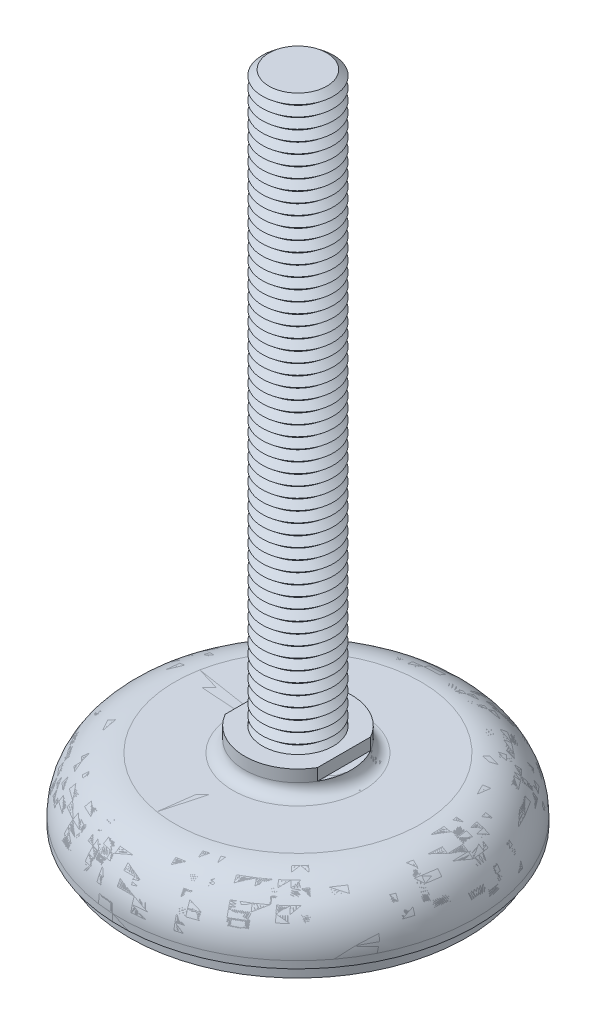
ISO-10303-21;
HEADER;
FILE_DESCRIPTION(('STEP AP214'),'2;1');
FILE_NAME('part.step','',(''),(''),'','','');
FILE_SCHEMA(('AUTOMOTIVE_DESIGN { 1 0 10303 214 1 1 1 1 }'));
ENDSEC;
DATA;
#1=APPLICATION_CONTEXT('core data for automotive mechanical design processes');
#2=APPLICATION_PROTOCOL_DEFINITION('international standard','automotive_design',2000,#1);
#3=PRODUCT_CONTEXT('',#1,'mechanical');
#4=PRODUCT('Part','Part','',(#3));
#5=PRODUCT_RELATED_PRODUCT_CATEGORY('part','',(#4));
#6=PRODUCT_DEFINITION_FORMATION('','',#4);
#7=PRODUCT_DEFINITION_CONTEXT('part definition',#1,'design');
#8=PRODUCT_DEFINITION('design','',#6,#7);
#9=PRODUCT_DEFINITION_SHAPE('','',#8);
#10=(LENGTH_UNIT() NAMED_UNIT(*) SI_UNIT(.MILLI.,.METRE.));
#11=(NAMED_UNIT(*) PLANE_ANGLE_UNIT() SI_UNIT($,.RADIAN.));
#12=(NAMED_UNIT(*) SI_UNIT($,.STERADIAN.) SOLID_ANGLE_UNIT());
#13=UNCERTAINTY_MEASURE_WITH_UNIT(LENGTH_MEASURE(1.E-05),#10,'distance_accuracy_value','');
#14=(GEOMETRIC_REPRESENTATION_CONTEXT(3) GLOBAL_UNCERTAINTY_ASSIGNED_CONTEXT((#13)) GLOBAL_UNIT_ASSIGNED_CONTEXT((#10,
#11,#12)) REPRESENTATION_CONTEXT('',''));
#15=CARTESIAN_POINT('',(0.,0.,0.));
#16=DIRECTION('',(0.,0.,1.));
#17=DIRECTION('',(1.,0.,0.));
#18=AXIS2_PLACEMENT_3D('',#15,#16,#17);
#19=CARTESIAN_POINT('',(0.,89.5,0.));
#20=DIRECTION('',(0.,-1.,0.));
#21=DIRECTION('',(0.998136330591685,0.,-0.0610234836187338));
#22=AXIS2_PLACEMENT_3D('',#19,#20,#21);
#23=CONICAL_SURFACE('',#22,4.06325030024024,0.895664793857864);
#24=CARTESIAN_POINT('',(0.,88.75,0.));
#25=DIRECTION('',(0.,-1.,0.));
#26=DIRECTION('',(0.998136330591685,0.,-0.0610234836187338));
#27=AXIS2_PLACEMENT_3D('',#24,#25,#26);
#28=CIRCLE('',#27,5.);
#29=CARTESIAN_POINT('',(4.99068165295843,88.75,-0.305117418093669));
#30=VERTEX_POINT('',#29);
#31=EDGE_CURVE('P0_E37',#30,#30,#28,.T.);
#32=ORIENTED_EDGE('',*,*,#31,.F.);
#33=EDGE_LOOP('',(#32));
#34=FACE_BOUND('',#33,.T.);
#35=CARTESIAN_POINT('',(0.,89.5,0.));
#36=DIRECTION('',(0.,-1.,0.));
#37=DIRECTION('',(0.998136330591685,0.,-0.0610234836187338));
#38=AXIS2_PLACEMENT_3D('',#35,#36,#37);
#39=CIRCLE('',#38,4.06325030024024);
#40=CARTESIAN_POINT('',(4.05567774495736,89.5,-0.247953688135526));
#41=VERTEX_POINT('',#40);
#42=EDGE_CURVE('P0_E25',#41,#41,#39,.T.);
#43=ORIENTED_EDGE('',*,*,#42,.T.);
#44=EDGE_LOOP('',(#43));
#45=FACE_BOUND('',#44,.T.);
#46=ADVANCED_FACE('P0_F14',(#34,#45),#23,.T.);
#47=CARTESIAN_POINT('',(0.,90.25,0.));
#48=DIRECTION('',(0.,1.,0.));
#49=DIRECTION('',(-0.998136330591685,0.,0.0610234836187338));
#50=AXIS2_PLACEMENT_3D('',#47,#48,#49);
#51=CONICAL_SURFACE('',#50,5.,0.895664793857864);
#52=ORIENTED_EDGE('',*,*,#42,.F.);
#53=EDGE_LOOP('',(#52));
#54=FACE_BOUND('',#53,.T.);
#55=CARTESIAN_POINT('',(0.,90.25,0.));
#56=DIRECTION('',(0.,-1.,0.));
#57=DIRECTION('',(0.998136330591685,0.,-0.0610234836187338));
#58=AXIS2_PLACEMENT_3D('',#55,#56,#57);
#59=CIRCLE('',#58,5.);
#60=CARTESIAN_POINT('',(4.99068165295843,90.25,-0.305117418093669));
#61=VERTEX_POINT('',#60);
#62=EDGE_CURVE('P0_E29',#61,#61,#59,.T.);
#63=ORIENTED_EDGE('',*,*,#62,.T.);
#64=EDGE_LOOP('',(#63));
#65=FACE_BOUND('',#64,.T.);
#66=ADVANCED_FACE('P0_F1051',(#54,#65),#51,.T.);
#67=CARTESIAN_POINT('',(0.,91.,0.));
#68=DIRECTION('',(0.,1.,0.));
#69=DIRECTION('',(-0.998136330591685,0.,0.0610234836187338));
#70=AXIS2_PLACEMENT_3D('',#67,#68,#69);
#71=PLANE('',#70);
#72=CARTESIAN_POINT('',(0.,91.,0.));
#73=DIRECTION('',(0.,-1.,0.));
#74=DIRECTION('',(0.998136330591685,0.,-0.0610234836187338));
#75=AXIS2_PLACEMENT_3D('',#72,#73,#74);
#76=CIRCLE('',#75,4.06325030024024);
#77=CARTESIAN_POINT('',(4.05567774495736,91.,-0.247953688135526));
#78=VERTEX_POINT('',#77);
#79=EDGE_CURVE('P0_E21',#78,#78,#76,.T.);
#80=ORIENTED_EDGE('',*,*,#79,.F.);
#81=EDGE_LOOP('',(#80));
#82=FACE_BOUND('',#81,.T.);
#83=ADVANCED_FACE('P0_F1057',(#82),#71,.T.);
#84=CARTESIAN_POINT('',(0.,91.,0.));
#85=DIRECTION('',(0.,-1.,0.));
#86=DIRECTION('',(0.998136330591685,0.,-0.0610234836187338));
#87=AXIS2_PLACEMENT_3D('',#84,#85,#86);
#88=CONICAL_SURFACE('',#87,4.06325030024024,0.895664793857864);
#89=ORIENTED_EDGE('',*,*,#62,.F.);
#90=EDGE_LOOP('',(#89));
#91=FACE_BOUND('',#90,.T.);
#92=ORIENTED_EDGE('',*,*,#79,.T.);
#93=EDGE_LOOP('',(#92));
#94=FACE_BOUND('',#93,.T.);
#95=ADVANCED_FACE('P0_F1040',(#91,#94),#88,.T.);
#96=CARTESIAN_POINT('',(0.,88.,0.));
#97=DIRECTION('',(0.,-1.,0.));
#98=DIRECTION('',(0.998136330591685,0.,-0.0610234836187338));
#99=AXIS2_PLACEMENT_3D('',#96,#97,#98);
#100=CONICAL_SURFACE('',#99,4.06325030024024,0.895664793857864);
#101=CARTESIAN_POINT('',(0.,87.25,0.));
#102=DIRECTION('',(0.,-1.,0.));
#103=DIRECTION('',(0.998136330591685,0.,-0.0610234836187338));
#104=AXIS2_PLACEMENT_3D('',#101,#102,#103);
#105=CIRCLE('',#104,5.);
#106=CARTESIAN_POINT('',(4.99068165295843,87.25,-0.305117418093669));
#107=VERTEX_POINT('',#106);
#108=EDGE_CURVE('P0_E43',#107,#107,#105,.T.);
#109=ORIENTED_EDGE('',*,*,#108,.F.);
#110=EDGE_LOOP('',(#109));
#111=FACE_BOUND('',#110,.T.);
#112=CARTESIAN_POINT('',(0.,88.,0.));
#113=DIRECTION('',(0.,-1.,0.));
#114=DIRECTION('',(0.998136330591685,0.,-0.0610234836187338));
#115=AXIS2_PLACEMENT_3D('',#112,#113,#114);
#116=CIRCLE('',#115,4.06325030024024);
#117=CARTESIAN_POINT('',(4.05567774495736,88.,-0.247953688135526));
#118=VERTEX_POINT('',#117);
#119=EDGE_CURVE('P0_E34',#118,#118,#116,.T.);
#120=ORIENTED_EDGE('',*,*,#119,.T.);
#121=EDGE_LOOP('',(#120));
#122=FACE_BOUND('',#121,.T.);
#123=ADVANCED_FACE('P0_F1037',(#111,#122),#100,.T.);
#124=CARTESIAN_POINT('',(0.,88.75,0.));
#125=DIRECTION('',(0.,1.,0.));
#126=DIRECTION('',(-0.998136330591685,0.,0.0610234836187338));
#127=AXIS2_PLACEMENT_3D('',#124,#125,#126);
#128=CONICAL_SURFACE('',#127,5.,0.895664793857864);
#129=ORIENTED_EDGE('',*,*,#119,.F.);
#130=EDGE_LOOP('',(#129));
#131=FACE_BOUND('',#130,.T.);
#132=ORIENTED_EDGE('',*,*,#31,.T.);
#133=EDGE_LOOP('',(#132));
#134=FACE_BOUND('',#133,.T.);
#135=ADVANCED_FACE('P0_F1028',(#131,#134),#128,.T.);
#136=CARTESIAN_POINT('',(0.,86.5,0.));
#137=DIRECTION('',(0.,-1.,0.));
#138=DIRECTION('',(0.998136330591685,0.,-0.0610234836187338));
#139=AXIS2_PLACEMENT_3D('',#136,#137,#138);
#140=CONICAL_SURFACE('',#139,4.06325030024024,0.895664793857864);
#141=CARTESIAN_POINT('',(0.,85.75,0.));
#142=DIRECTION('',(0.,-1.,0.));
#143=DIRECTION('',(0.998136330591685,0.,-0.0610234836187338));
#144=AXIS2_PLACEMENT_3D('',#141,#142,#143);
#145=CIRCLE('',#144,5.);
#146=CARTESIAN_POINT('',(4.99068165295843,85.75,-0.305117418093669));
#147=VERTEX_POINT('',#146);
#148=EDGE_CURVE('P0_E49',#147,#147,#145,.T.);
#149=ORIENTED_EDGE('',*,*,#148,.F.);
#150=EDGE_LOOP('',(#149));
#151=FACE_BOUND('',#150,.T.);
#152=CARTESIAN_POINT('',(0.,86.5,0.));
#153=DIRECTION('',(0.,-1.,0.));
#154=DIRECTION('',(0.998136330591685,0.,-0.0610234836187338));
#155=AXIS2_PLACEMENT_3D('',#152,#153,#154);
#156=CIRCLE('',#155,4.06325030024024);
#157=CARTESIAN_POINT('',(4.05567774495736,86.5,-0.247953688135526));
#158=VERTEX_POINT('',#157);
#159=EDGE_CURVE('P0_E40',#158,#158,#156,.T.);
#160=ORIENTED_EDGE('',*,*,#159,.T.);
#161=EDGE_LOOP('',(#160));
#162=FACE_BOUND('',#161,.T.);
#163=ADVANCED_FACE('P0_F1025',(#151,#162),#140,.T.);
#164=CARTESIAN_POINT('',(0.,87.25,0.));
#165=DIRECTION('',(0.,1.,0.));
#166=DIRECTION('',(-0.998136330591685,0.,0.0610234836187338));
#167=AXIS2_PLACEMENT_3D('',#164,#165,#166);
#168=CONICAL_SURFACE('',#167,5.,0.895664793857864);
#169=ORIENTED_EDGE('',*,*,#159,.F.);
#170=EDGE_LOOP('',(#169));
#171=FACE_BOUND('',#170,.T.);
#172=ORIENTED_EDGE('',*,*,#108,.T.);
#173=EDGE_LOOP('',(#172));
#174=FACE_BOUND('',#173,.T.);
#175=ADVANCED_FACE('P0_F1016',(#171,#174),#168,.T.);
#176=CARTESIAN_POINT('',(0.,85.,0.));
#177=DIRECTION('',(0.,-1.,0.));
#178=DIRECTION('',(0.998136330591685,0.,-0.0610234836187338));
#179=AXIS2_PLACEMENT_3D('',#176,#177,#178);
#180=CONICAL_SURFACE('',#179,4.06325030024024,0.895664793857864);
#181=CARTESIAN_POINT('',(0.,84.25,0.));
#182=DIRECTION('',(0.,-1.,0.));
#183=DIRECTION('',(0.998136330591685,0.,-0.0610234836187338));
#184=AXIS2_PLACEMENT_3D('',#181,#182,#183);
#185=CIRCLE('',#184,5.);
#186=CARTESIAN_POINT('',(4.99068165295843,84.25,-0.305117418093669));
#187=VERTEX_POINT('',#186);
#188=EDGE_CURVE('P0_E55',#187,#187,#185,.T.);
#189=ORIENTED_EDGE('',*,*,#188,.F.);
#190=EDGE_LOOP('',(#189));
#191=FACE_BOUND('',#190,.T.);
#192=CARTESIAN_POINT('',(0.,85.,0.));
#193=DIRECTION('',(0.,-1.,0.));
#194=DIRECTION('',(0.998136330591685,0.,-0.0610234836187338));
#195=AXIS2_PLACEMENT_3D('',#192,#193,#194);
#196=CIRCLE('',#195,4.06325030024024);
#197=CARTESIAN_POINT('',(4.05567774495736,85.,-0.247953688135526));
#198=VERTEX_POINT('',#197);
#199=EDGE_CURVE('P0_E46',#198,#198,#196,.T.);
#200=ORIENTED_EDGE('',*,*,#199,.T.);
#201=EDGE_LOOP('',(#200));
#202=FACE_BOUND('',#201,.T.);
#203=ADVANCED_FACE('P0_F1013',(#191,#202),#180,.T.);
#204=CARTESIAN_POINT('',(0.,85.75,0.));
#205=DIRECTION('',(0.,1.,0.));
#206=DIRECTION('',(-0.998136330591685,0.,0.0610234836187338));
#207=AXIS2_PLACEMENT_3D('',#204,#205,#206);
#208=CONICAL_SURFACE('',#207,5.,0.895664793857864);
#209=ORIENTED_EDGE('',*,*,#199,.F.);
#210=EDGE_LOOP('',(#209));
#211=FACE_BOUND('',#210,.T.);
#212=ORIENTED_EDGE('',*,*,#148,.T.);
#213=EDGE_LOOP('',(#212));
#214=FACE_BOUND('',#213,.T.);
#215=ADVANCED_FACE('P0_F1004',(#211,#214),#208,.T.);
#216=CARTESIAN_POINT('',(0.,83.5,0.));
#217=DIRECTION('',(0.,-1.,0.));
#218=DIRECTION('',(0.998136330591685,0.,-0.0610234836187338));
#219=AXIS2_PLACEMENT_3D('',#216,#217,#218);
#220=CONICAL_SURFACE('',#219,4.06325030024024,0.895664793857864);
#221=CARTESIAN_POINT('',(0.,82.75,0.));
#222=DIRECTION('',(0.,-1.,0.));
#223=DIRECTION('',(0.998136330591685,0.,-0.0610234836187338));
#224=AXIS2_PLACEMENT_3D('',#221,#222,#223);
#225=CIRCLE('',#224,5.);
#226=CARTESIAN_POINT('',(4.99068165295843,82.75,-0.305117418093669));
#227=VERTEX_POINT('',#226);
#228=EDGE_CURVE('P0_E61',#227,#227,#225,.T.);
#229=ORIENTED_EDGE('',*,*,#228,.F.);
#230=EDGE_LOOP('',(#229));
#231=FACE_BOUND('',#230,.T.);
#232=CARTESIAN_POINT('',(0.,83.5,0.));
#233=DIRECTION('',(0.,-1.,0.));
#234=DIRECTION('',(0.998136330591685,0.,-0.0610234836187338));
#235=AXIS2_PLACEMENT_3D('',#232,#233,#234);
#236=CIRCLE('',#235,4.06325030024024);
#237=CARTESIAN_POINT('',(4.05567774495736,83.5,-0.247953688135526));
#238=VERTEX_POINT('',#237);
#239=EDGE_CURVE('P0_E52',#238,#238,#236,.T.);
#240=ORIENTED_EDGE('',*,*,#239,.T.);
#241=EDGE_LOOP('',(#240));
#242=FACE_BOUND('',#241,.T.);
#243=ADVANCED_FACE('P0_F1001',(#231,#242),#220,.T.);
#244=CARTESIAN_POINT('',(0.,84.25,0.));
#245=DIRECTION('',(0.,1.,0.));
#246=DIRECTION('',(-0.998136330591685,0.,0.0610234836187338));
#247=AXIS2_PLACEMENT_3D('',#244,#245,#246);
#248=CONICAL_SURFACE('',#247,5.,0.895664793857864);
#249=ORIENTED_EDGE('',*,*,#239,.F.);
#250=EDGE_LOOP('',(#249));
#251=FACE_BOUND('',#250,.T.);
#252=ORIENTED_EDGE('',*,*,#188,.T.);
#253=EDGE_LOOP('',(#252));
#254=FACE_BOUND('',#253,.T.);
#255=ADVANCED_FACE('P0_F992',(#251,#254),#248,.T.);
#256=CARTESIAN_POINT('',(0.,82.,0.));
#257=DIRECTION('',(0.,-1.,0.));
#258=DIRECTION('',(0.998136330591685,0.,-0.0610234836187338));
#259=AXIS2_PLACEMENT_3D('',#256,#257,#258);
#260=CONICAL_SURFACE('',#259,4.06325030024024,0.895664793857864);
#261=CARTESIAN_POINT('',(0.,81.25,0.));
#262=DIRECTION('',(0.,-1.,0.));
#263=DIRECTION('',(0.998136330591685,0.,-0.0610234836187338));
#264=AXIS2_PLACEMENT_3D('',#261,#262,#263);
#265=CIRCLE('',#264,5.);
#266=CARTESIAN_POINT('',(4.99068165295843,81.25,-0.305117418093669));
#267=VERTEX_POINT('',#266);
#268=EDGE_CURVE('P0_E67',#267,#267,#265,.T.);
#269=ORIENTED_EDGE('',*,*,#268,.F.);
#270=EDGE_LOOP('',(#269));
#271=FACE_BOUND('',#270,.T.);
#272=CARTESIAN_POINT('',(0.,82.,0.));
#273=DIRECTION('',(0.,-1.,0.));
#274=DIRECTION('',(0.998136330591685,0.,-0.0610234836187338));
#275=AXIS2_PLACEMENT_3D('',#272,#273,#274);
#276=CIRCLE('',#275,4.06325030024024);
#277=CARTESIAN_POINT('',(4.05567774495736,82.,-0.247953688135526));
#278=VERTEX_POINT('',#277);
#279=EDGE_CURVE('P0_E58',#278,#278,#276,.T.);
#280=ORIENTED_EDGE('',*,*,#279,.T.);
#281=EDGE_LOOP('',(#280));
#282=FACE_BOUND('',#281,.T.);
#283=ADVANCED_FACE('P0_F989',(#271,#282),#260,.T.);
#284=CARTESIAN_POINT('',(0.,82.75,0.));
#285=DIRECTION('',(0.,1.,0.));
#286=DIRECTION('',(-0.998136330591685,0.,0.0610234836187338));
#287=AXIS2_PLACEMENT_3D('',#284,#285,#286);
#288=CONICAL_SURFACE('',#287,5.,0.895664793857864);
#289=ORIENTED_EDGE('',*,*,#279,.F.);
#290=EDGE_LOOP('',(#289));
#291=FACE_BOUND('',#290,.T.);
#292=ORIENTED_EDGE('',*,*,#228,.T.);
#293=EDGE_LOOP('',(#292));
#294=FACE_BOUND('',#293,.T.);
#295=ADVANCED_FACE('P0_F980',(#291,#294),#288,.T.);
#296=CARTESIAN_POINT('',(0.,80.5,0.));
#297=DIRECTION('',(0.,-1.,0.));
#298=DIRECTION('',(0.998136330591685,0.,-0.0610234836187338));
#299=AXIS2_PLACEMENT_3D('',#296,#297,#298);
#300=CONICAL_SURFACE('',#299,4.06325030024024,0.895664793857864);
#301=CARTESIAN_POINT('',(0.,79.75,0.));
#302=DIRECTION('',(0.,-1.,0.));
#303=DIRECTION('',(0.998136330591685,0.,-0.0610234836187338));
#304=AXIS2_PLACEMENT_3D('',#301,#302,#303);
#305=CIRCLE('',#304,5.);
#306=CARTESIAN_POINT('',(4.99068165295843,79.75,-0.305117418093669));
#307=VERTEX_POINT('',#306);
#308=EDGE_CURVE('P0_E73',#307,#307,#305,.T.);
#309=ORIENTED_EDGE('',*,*,#308,.F.);
#310=EDGE_LOOP('',(#309));
#311=FACE_BOUND('',#310,.T.);
#312=CARTESIAN_POINT('',(0.,80.5,0.));
#313=DIRECTION('',(0.,-1.,0.));
#314=DIRECTION('',(0.998136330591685,0.,-0.0610234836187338));
#315=AXIS2_PLACEMENT_3D('',#312,#313,#314);
#316=CIRCLE('',#315,4.06325030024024);
#317=CARTESIAN_POINT('',(4.05567774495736,80.5,-0.247953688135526));
#318=VERTEX_POINT('',#317);
#319=EDGE_CURVE('P0_E64',#318,#318,#316,.T.);
#320=ORIENTED_EDGE('',*,*,#319,.T.);
#321=EDGE_LOOP('',(#320));
#322=FACE_BOUND('',#321,.T.);
#323=ADVANCED_FACE('P0_F977',(#311,#322),#300,.T.);
#324=CARTESIAN_POINT('',(0.,81.25,0.));
#325=DIRECTION('',(0.,1.,0.));
#326=DIRECTION('',(-0.998136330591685,0.,0.0610234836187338));
#327=AXIS2_PLACEMENT_3D('',#324,#325,#326);
#328=CONICAL_SURFACE('',#327,5.,0.895664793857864);
#329=ORIENTED_EDGE('',*,*,#319,.F.);
#330=EDGE_LOOP('',(#329));
#331=FACE_BOUND('',#330,.T.);
#332=ORIENTED_EDGE('',*,*,#268,.T.);
#333=EDGE_LOOP('',(#332));
#334=FACE_BOUND('',#333,.T.);
#335=ADVANCED_FACE('P0_F968',(#331,#334),#328,.T.);
#336=CARTESIAN_POINT('',(0.,79.,0.));
#337=DIRECTION('',(0.,-1.,0.));
#338=DIRECTION('',(0.998136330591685,0.,-0.0610234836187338));
#339=AXIS2_PLACEMENT_3D('',#336,#337,#338);
#340=CONICAL_SURFACE('',#339,4.06325030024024,0.895664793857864);
#341=CARTESIAN_POINT('',(0.,78.25,0.));
#342=DIRECTION('',(0.,-1.,0.));
#343=DIRECTION('',(0.998136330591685,0.,-0.0610234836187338));
#344=AXIS2_PLACEMENT_3D('',#341,#342,#343);
#345=CIRCLE('',#344,5.);
#346=CARTESIAN_POINT('',(4.99068165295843,78.25,-0.305117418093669));
#347=VERTEX_POINT('',#346);
#348=EDGE_CURVE('P0_E79',#347,#347,#345,.T.);
#349=ORIENTED_EDGE('',*,*,#348,.F.);
#350=EDGE_LOOP('',(#349));
#351=FACE_BOUND('',#350,.T.);
#352=CARTESIAN_POINT('',(0.,79.,0.));
#353=DIRECTION('',(0.,-1.,0.));
#354=DIRECTION('',(0.998136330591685,0.,-0.0610234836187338));
#355=AXIS2_PLACEMENT_3D('',#352,#353,#354);
#356=CIRCLE('',#355,4.06325030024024);
#357=CARTESIAN_POINT('',(4.05567774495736,79.,-0.247953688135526));
#358=VERTEX_POINT('',#357);
#359=EDGE_CURVE('P0_E70',#358,#358,#356,.T.);
#360=ORIENTED_EDGE('',*,*,#359,.T.);
#361=EDGE_LOOP('',(#360));
#362=FACE_BOUND('',#361,.T.);
#363=ADVANCED_FACE('P0_F965',(#351,#362),#340,.T.);
#364=CARTESIAN_POINT('',(0.,79.75,0.));
#365=DIRECTION('',(0.,1.,0.));
#366=DIRECTION('',(-0.998136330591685,0.,0.0610234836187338));
#367=AXIS2_PLACEMENT_3D('',#364,#365,#366);
#368=CONICAL_SURFACE('',#367,5.,0.895664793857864);
#369=ORIENTED_EDGE('',*,*,#359,.F.);
#370=EDGE_LOOP('',(#369));
#371=FACE_BOUND('',#370,.T.);
#372=ORIENTED_EDGE('',*,*,#308,.T.);
#373=EDGE_LOOP('',(#372));
#374=FACE_BOUND('',#373,.T.);
#375=ADVANCED_FACE('P0_F956',(#371,#374),#368,.T.);
#376=CARTESIAN_POINT('',(0.,77.5,0.));
#377=DIRECTION('',(0.,-1.,0.));
#378=DIRECTION('',(0.998136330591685,0.,-0.0610234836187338));
#379=AXIS2_PLACEMENT_3D('',#376,#377,#378);
#380=CONICAL_SURFACE('',#379,4.06325030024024,0.895664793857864);
#381=CARTESIAN_POINT('',(0.,76.75,0.));
#382=DIRECTION('',(0.,-1.,0.));
#383=DIRECTION('',(0.998136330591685,0.,-0.0610234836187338));
#384=AXIS2_PLACEMENT_3D('',#381,#382,#383);
#385=CIRCLE('',#384,5.);
#386=CARTESIAN_POINT('',(4.99068165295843,76.75,-0.305117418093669));
#387=VERTEX_POINT('',#386);
#388=EDGE_CURVE('P0_E85',#387,#387,#385,.T.);
#389=ORIENTED_EDGE('',*,*,#388,.F.);
#390=EDGE_LOOP('',(#389));
#391=FACE_BOUND('',#390,.T.);
#392=CARTESIAN_POINT('',(0.,77.5,0.));
#393=DIRECTION('',(0.,-1.,0.));
#394=DIRECTION('',(0.998136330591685,0.,-0.0610234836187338));
#395=AXIS2_PLACEMENT_3D('',#392,#393,#394);
#396=CIRCLE('',#395,4.06325030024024);
#397=CARTESIAN_POINT('',(4.05567774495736,77.5,-0.247953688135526));
#398=VERTEX_POINT('',#397);
#399=EDGE_CURVE('P0_E76',#398,#398,#396,.T.);
#400=ORIENTED_EDGE('',*,*,#399,.T.);
#401=EDGE_LOOP('',(#400));
#402=FACE_BOUND('',#401,.T.);
#403=ADVANCED_FACE('P0_F953',(#391,#402),#380,.T.);
#404=CARTESIAN_POINT('',(0.,78.25,0.));
#405=DIRECTION('',(0.,1.,0.));
#406=DIRECTION('',(-0.998136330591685,0.,0.0610234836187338));
#407=AXIS2_PLACEMENT_3D('',#404,#405,#406);
#408=CONICAL_SURFACE('',#407,5.,0.895664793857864);
#409=ORIENTED_EDGE('',*,*,#399,.F.);
#410=EDGE_LOOP('',(#409));
#411=FACE_BOUND('',#410,.T.);
#412=ORIENTED_EDGE('',*,*,#348,.T.);
#413=EDGE_LOOP('',(#412));
#414=FACE_BOUND('',#413,.T.);
#415=ADVANCED_FACE('P0_F944',(#411,#414),#408,.T.);
#416=CARTESIAN_POINT('',(0.,76.,0.));
#417=DIRECTION('',(0.,-1.,0.));
#418=DIRECTION('',(0.998136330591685,0.,-0.0610234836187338));
#419=AXIS2_PLACEMENT_3D('',#416,#417,#418);
#420=CONICAL_SURFACE('',#419,4.06325030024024,0.895664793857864);
#421=CARTESIAN_POINT('',(0.,75.25,0.));
#422=DIRECTION('',(0.,-1.,0.));
#423=DIRECTION('',(0.998136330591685,0.,-0.0610234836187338));
#424=AXIS2_PLACEMENT_3D('',#421,#422,#423);
#425=CIRCLE('',#424,5.);
#426=CARTESIAN_POINT('',(4.99068165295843,75.25,-0.305117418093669));
#427=VERTEX_POINT('',#426);
#428=EDGE_CURVE('P0_E91',#427,#427,#425,.T.);
#429=ORIENTED_EDGE('',*,*,#428,.F.);
#430=EDGE_LOOP('',(#429));
#431=FACE_BOUND('',#430,.T.);
#432=CARTESIAN_POINT('',(0.,76.,0.));
#433=DIRECTION('',(0.,-1.,0.));
#434=DIRECTION('',(0.998136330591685,0.,-0.0610234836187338));
#435=AXIS2_PLACEMENT_3D('',#432,#433,#434);
#436=CIRCLE('',#435,4.06325030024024);
#437=CARTESIAN_POINT('',(4.05567774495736,76.,-0.247953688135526));
#438=VERTEX_POINT('',#437);
#439=EDGE_CURVE('P0_E82',#438,#438,#436,.T.);
#440=ORIENTED_EDGE('',*,*,#439,.T.);
#441=EDGE_LOOP('',(#440));
#442=FACE_BOUND('',#441,.T.);
#443=ADVANCED_FACE('P0_F941',(#431,#442),#420,.T.);
#444=CARTESIAN_POINT('',(0.,76.75,0.));
#445=DIRECTION('',(0.,1.,0.));
#446=DIRECTION('',(-0.998136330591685,0.,0.0610234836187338));
#447=AXIS2_PLACEMENT_3D('',#444,#445,#446);
#448=CONICAL_SURFACE('',#447,5.,0.895664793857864);
#449=ORIENTED_EDGE('',*,*,#439,.F.);
#450=EDGE_LOOP('',(#449));
#451=FACE_BOUND('',#450,.T.);
#452=ORIENTED_EDGE('',*,*,#388,.T.);
#453=EDGE_LOOP('',(#452));
#454=FACE_BOUND('',#453,.T.);
#455=ADVANCED_FACE('P0_F932',(#451,#454),#448,.T.);
#456=CARTESIAN_POINT('',(0.,74.5,0.));
#457=DIRECTION('',(0.,-1.,0.));
#458=DIRECTION('',(0.998136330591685,0.,-0.0610234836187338));
#459=AXIS2_PLACEMENT_3D('',#456,#457,#458);
#460=CONICAL_SURFACE('',#459,4.06325030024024,0.895664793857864);
#461=CARTESIAN_POINT('',(0.,73.75,0.));
#462=DIRECTION('',(0.,-1.,0.));
#463=DIRECTION('',(0.998136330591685,0.,-0.0610234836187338));
#464=AXIS2_PLACEMENT_3D('',#461,#462,#463);
#465=CIRCLE('',#464,5.);
#466=CARTESIAN_POINT('',(4.99068165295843,73.75,-0.305117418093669));
#467=VERTEX_POINT('',#466);
#468=EDGE_CURVE('P0_E97',#467,#467,#465,.T.);
#469=ORIENTED_EDGE('',*,*,#468,.F.);
#470=EDGE_LOOP('',(#469));
#471=FACE_BOUND('',#470,.T.);
#472=CARTESIAN_POINT('',(0.,74.5,0.));
#473=DIRECTION('',(0.,-1.,0.));
#474=DIRECTION('',(0.998136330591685,0.,-0.0610234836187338));
#475=AXIS2_PLACEMENT_3D('',#472,#473,#474);
#476=CIRCLE('',#475,4.06325030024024);
#477=CARTESIAN_POINT('',(4.05567774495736,74.5,-0.247953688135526));
#478=VERTEX_POINT('',#477);
#479=EDGE_CURVE('P0_E88',#478,#478,#476,.T.);
#480=ORIENTED_EDGE('',*,*,#479,.T.);
#481=EDGE_LOOP('',(#480));
#482=FACE_BOUND('',#481,.T.);
#483=ADVANCED_FACE('P0_F929',(#471,#482),#460,.T.);
#484=CARTESIAN_POINT('',(0.,75.25,0.));
#485=DIRECTION('',(0.,1.,0.));
#486=DIRECTION('',(-0.998136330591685,0.,0.0610234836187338));
#487=AXIS2_PLACEMENT_3D('',#484,#485,#486);
#488=CONICAL_SURFACE('',#487,5.,0.895664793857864);
#489=ORIENTED_EDGE('',*,*,#479,.F.);
#490=EDGE_LOOP('',(#489));
#491=FACE_BOUND('',#490,.T.);
#492=ORIENTED_EDGE('',*,*,#428,.T.);
#493=EDGE_LOOP('',(#492));
#494=FACE_BOUND('',#493,.T.);
#495=ADVANCED_FACE('P0_F920',(#491,#494),#488,.T.);
#496=CARTESIAN_POINT('',(0.,73.,0.));
#497=DIRECTION('',(0.,-1.,0.));
#498=DIRECTION('',(0.998136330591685,0.,-0.0610234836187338));
#499=AXIS2_PLACEMENT_3D('',#496,#497,#498);
#500=CONICAL_SURFACE('',#499,4.06325030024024,0.895664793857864);
#501=CARTESIAN_POINT('',(0.,72.25,0.));
#502=DIRECTION('',(0.,-1.,0.));
#503=DIRECTION('',(0.998136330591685,0.,-0.0610234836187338));
#504=AXIS2_PLACEMENT_3D('',#501,#502,#503);
#505=CIRCLE('',#504,5.);
#506=CARTESIAN_POINT('',(4.99068165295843,72.25,-0.305117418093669));
#507=VERTEX_POINT('',#506);
#508=EDGE_CURVE('P0_E103',#507,#507,#505,.T.);
#509=ORIENTED_EDGE('',*,*,#508,.F.);
#510=EDGE_LOOP('',(#509));
#511=FACE_BOUND('',#510,.T.);
#512=CARTESIAN_POINT('',(0.,73.,0.));
#513=DIRECTION('',(0.,-1.,0.));
#514=DIRECTION('',(0.998136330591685,0.,-0.0610234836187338));
#515=AXIS2_PLACEMENT_3D('',#512,#513,#514);
#516=CIRCLE('',#515,4.06325030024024);
#517=CARTESIAN_POINT('',(4.05567774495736,73.,-0.247953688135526));
#518=VERTEX_POINT('',#517);
#519=EDGE_CURVE('P0_E94',#518,#518,#516,.T.);
#520=ORIENTED_EDGE('',*,*,#519,.T.);
#521=EDGE_LOOP('',(#520));
#522=FACE_BOUND('',#521,.T.);
#523=ADVANCED_FACE('P0_F917',(#511,#522),#500,.T.);
#524=CARTESIAN_POINT('',(0.,73.75,0.));
#525=DIRECTION('',(0.,1.,0.));
#526=DIRECTION('',(-0.998136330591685,0.,0.0610234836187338));
#527=AXIS2_PLACEMENT_3D('',#524,#525,#526);
#528=CONICAL_SURFACE('',#527,5.,0.895664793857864);
#529=ORIENTED_EDGE('',*,*,#519,.F.);
#530=EDGE_LOOP('',(#529));
#531=FACE_BOUND('',#530,.T.);
#532=ORIENTED_EDGE('',*,*,#468,.T.);
#533=EDGE_LOOP('',(#532));
#534=FACE_BOUND('',#533,.T.);
#535=ADVANCED_FACE('P0_F908',(#531,#534),#528,.T.);
#536=CARTESIAN_POINT('',(0.,71.5,0.));
#537=DIRECTION('',(0.,-1.,0.));
#538=DIRECTION('',(0.998136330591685,0.,-0.0610234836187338));
#539=AXIS2_PLACEMENT_3D('',#536,#537,#538);
#540=CONICAL_SURFACE('',#539,4.06325030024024,0.895664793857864);
#541=CARTESIAN_POINT('',(0.,70.75,0.));
#542=DIRECTION('',(0.,-1.,0.));
#543=DIRECTION('',(0.998136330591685,0.,-0.0610234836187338));
#544=AXIS2_PLACEMENT_3D('',#541,#542,#543);
#545=CIRCLE('',#544,5.);
#546=CARTESIAN_POINT('',(4.99068165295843,70.75,-0.305117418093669));
#547=VERTEX_POINT('',#546);
#548=EDGE_CURVE('P0_E109',#547,#547,#545,.T.);
#549=ORIENTED_EDGE('',*,*,#548,.F.);
#550=EDGE_LOOP('',(#549));
#551=FACE_BOUND('',#550,.T.);
#552=CARTESIAN_POINT('',(0.,71.5,0.));
#553=DIRECTION('',(0.,-1.,0.));
#554=DIRECTION('',(0.998136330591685,0.,-0.0610234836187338));
#555=AXIS2_PLACEMENT_3D('',#552,#553,#554);
#556=CIRCLE('',#555,4.06325030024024);
#557=CARTESIAN_POINT('',(4.05567774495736,71.5,-0.247953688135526));
#558=VERTEX_POINT('',#557);
#559=EDGE_CURVE('P0_E100',#558,#558,#556,.T.);
#560=ORIENTED_EDGE('',*,*,#559,.T.);
#561=EDGE_LOOP('',(#560));
#562=FACE_BOUND('',#561,.T.);
#563=ADVANCED_FACE('P0_F905',(#551,#562),#540,.T.);
#564=CARTESIAN_POINT('',(0.,72.25,0.));
#565=DIRECTION('',(0.,1.,0.));
#566=DIRECTION('',(-0.998136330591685,0.,0.0610234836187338));
#567=AXIS2_PLACEMENT_3D('',#564,#565,#566);
#568=CONICAL_SURFACE('',#567,5.,0.895664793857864);
#569=ORIENTED_EDGE('',*,*,#559,.F.);
#570=EDGE_LOOP('',(#569));
#571=FACE_BOUND('',#570,.T.);
#572=ORIENTED_EDGE('',*,*,#508,.T.);
#573=EDGE_LOOP('',(#572));
#574=FACE_BOUND('',#573,.T.);
#575=ADVANCED_FACE('P0_F896',(#571,#574),#568,.T.);
#576=CARTESIAN_POINT('',(0.,70.,0.));
#577=DIRECTION('',(0.,-1.,0.));
#578=DIRECTION('',(0.998136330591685,0.,-0.0610234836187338));
#579=AXIS2_PLACEMENT_3D('',#576,#577,#578);
#580=CONICAL_SURFACE('',#579,4.06325030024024,0.895664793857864);
#581=CARTESIAN_POINT('',(0.,69.25,0.));
#582=DIRECTION('',(0.,-1.,0.));
#583=DIRECTION('',(0.998136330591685,0.,-0.0610234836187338));
#584=AXIS2_PLACEMENT_3D('',#581,#582,#583);
#585=CIRCLE('',#584,5.);
#586=CARTESIAN_POINT('',(4.99068165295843,69.25,-0.305117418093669));
#587=VERTEX_POINT('',#586);
#588=EDGE_CURVE('P0_E115',#587,#587,#585,.T.);
#589=ORIENTED_EDGE('',*,*,#588,.F.);
#590=EDGE_LOOP('',(#589));
#591=FACE_BOUND('',#590,.T.);
#592=CARTESIAN_POINT('',(0.,70.,0.));
#593=DIRECTION('',(0.,-1.,0.));
#594=DIRECTION('',(0.998136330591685,0.,-0.0610234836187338));
#595=AXIS2_PLACEMENT_3D('',#592,#593,#594);
#596=CIRCLE('',#595,4.06325030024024);
#597=CARTESIAN_POINT('',(4.05567774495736,70.,-0.247953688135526));
#598=VERTEX_POINT('',#597);
#599=EDGE_CURVE('P0_E106',#598,#598,#596,.T.);
#600=ORIENTED_EDGE('',*,*,#599,.T.);
#601=EDGE_LOOP('',(#600));
#602=FACE_BOUND('',#601,.T.);
#603=ADVANCED_FACE('P0_F893',(#591,#602),#580,.T.);
#604=CARTESIAN_POINT('',(0.,70.75,0.));
#605=DIRECTION('',(0.,1.,0.));
#606=DIRECTION('',(-0.998136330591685,0.,0.0610234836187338));
#607=AXIS2_PLACEMENT_3D('',#604,#605,#606);
#608=CONICAL_SURFACE('',#607,5.,0.895664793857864);
#609=ORIENTED_EDGE('',*,*,#599,.F.);
#610=EDGE_LOOP('',(#609));
#611=FACE_BOUND('',#610,.T.);
#612=ORIENTED_EDGE('',*,*,#548,.T.);
#613=EDGE_LOOP('',(#612));
#614=FACE_BOUND('',#613,.T.);
#615=ADVANCED_FACE('P0_F884',(#611,#614),#608,.T.);
#616=CARTESIAN_POINT('',(0.,68.5,0.));
#617=DIRECTION('',(0.,-1.,0.));
#618=DIRECTION('',(0.998136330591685,0.,-0.0610234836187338));
#619=AXIS2_PLACEMENT_3D('',#616,#617,#618);
#620=CONICAL_SURFACE('',#619,4.06325030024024,0.895664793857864);
#621=CARTESIAN_POINT('',(0.,67.75,0.));
#622=DIRECTION('',(0.,-1.,0.));
#623=DIRECTION('',(0.998136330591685,0.,-0.0610234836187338));
#624=AXIS2_PLACEMENT_3D('',#621,#622,#623);
#625=CIRCLE('',#624,5.);
#626=CARTESIAN_POINT('',(4.99068165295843,67.75,-0.305117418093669));
#627=VERTEX_POINT('',#626);
#628=EDGE_CURVE('P0_E121',#627,#627,#625,.T.);
#629=ORIENTED_EDGE('',*,*,#628,.F.);
#630=EDGE_LOOP('',(#629));
#631=FACE_BOUND('',#630,.T.);
#632=CARTESIAN_POINT('',(0.,68.5,0.));
#633=DIRECTION('',(0.,-1.,0.));
#634=DIRECTION('',(0.998136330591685,0.,-0.0610234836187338));
#635=AXIS2_PLACEMENT_3D('',#632,#633,#634);
#636=CIRCLE('',#635,4.06325030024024);
#637=CARTESIAN_POINT('',(4.05567774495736,68.5,-0.247953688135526));
#638=VERTEX_POINT('',#637);
#639=EDGE_CURVE('P0_E112',#638,#638,#636,.T.);
#640=ORIENTED_EDGE('',*,*,#639,.T.);
#641=EDGE_LOOP('',(#640));
#642=FACE_BOUND('',#641,.T.);
#643=ADVANCED_FACE('P0_F881',(#631,#642),#620,.T.);
#644=CARTESIAN_POINT('',(0.,69.25,0.));
#645=DIRECTION('',(0.,1.,0.));
#646=DIRECTION('',(-0.998136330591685,0.,0.0610234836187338));
#647=AXIS2_PLACEMENT_3D('',#644,#645,#646);
#648=CONICAL_SURFACE('',#647,5.,0.895664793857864);
#649=ORIENTED_EDGE('',*,*,#639,.F.);
#650=EDGE_LOOP('',(#649));
#651=FACE_BOUND('',#650,.T.);
#652=ORIENTED_EDGE('',*,*,#588,.T.);
#653=EDGE_LOOP('',(#652));
#654=FACE_BOUND('',#653,.T.);
#655=ADVANCED_FACE('P0_F872',(#651,#654),#648,.T.);
#656=CARTESIAN_POINT('',(0.,67.,0.));
#657=DIRECTION('',(0.,-1.,0.));
#658=DIRECTION('',(0.998136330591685,0.,-0.0610234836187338));
#659=AXIS2_PLACEMENT_3D('',#656,#657,#658);
#660=CONICAL_SURFACE('',#659,4.06325030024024,0.895664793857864);
#661=CARTESIAN_POINT('',(0.,66.25,0.));
#662=DIRECTION('',(0.,-1.,0.));
#663=DIRECTION('',(0.998136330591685,0.,-0.0610234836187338));
#664=AXIS2_PLACEMENT_3D('',#661,#662,#663);
#665=CIRCLE('',#664,5.);
#666=CARTESIAN_POINT('',(4.99068165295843,66.25,-0.305117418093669));
#667=VERTEX_POINT('',#666);
#668=EDGE_CURVE('P0_E127',#667,#667,#665,.T.);
#669=ORIENTED_EDGE('',*,*,#668,.F.);
#670=EDGE_LOOP('',(#669));
#671=FACE_BOUND('',#670,.T.);
#672=CARTESIAN_POINT('',(0.,67.,0.));
#673=DIRECTION('',(0.,-1.,0.));
#674=DIRECTION('',(0.998136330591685,0.,-0.0610234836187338));
#675=AXIS2_PLACEMENT_3D('',#672,#673,#674);
#676=CIRCLE('',#675,4.06325030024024);
#677=CARTESIAN_POINT('',(4.05567774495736,67.,-0.247953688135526));
#678=VERTEX_POINT('',#677);
#679=EDGE_CURVE('P0_E118',#678,#678,#676,.T.);
#680=ORIENTED_EDGE('',*,*,#679,.T.);
#681=EDGE_LOOP('',(#680));
#682=FACE_BOUND('',#681,.T.);
#683=ADVANCED_FACE('P0_F869',(#671,#682),#660,.T.);
#684=CARTESIAN_POINT('',(0.,67.75,0.));
#685=DIRECTION('',(0.,1.,0.));
#686=DIRECTION('',(-0.998136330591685,0.,0.0610234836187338));
#687=AXIS2_PLACEMENT_3D('',#684,#685,#686);
#688=CONICAL_SURFACE('',#687,5.,0.895664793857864);
#689=ORIENTED_EDGE('',*,*,#679,.F.);
#690=EDGE_LOOP('',(#689));
#691=FACE_BOUND('',#690,.T.);
#692=ORIENTED_EDGE('',*,*,#628,.T.);
#693=EDGE_LOOP('',(#692));
#694=FACE_BOUND('',#693,.T.);
#695=ADVANCED_FACE('P0_F860',(#691,#694),#688,.T.);
#696=CARTESIAN_POINT('',(0.,65.5,0.));
#697=DIRECTION('',(0.,-1.,0.));
#698=DIRECTION('',(0.998136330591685,0.,-0.0610234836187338));
#699=AXIS2_PLACEMENT_3D('',#696,#697,#698);
#700=CONICAL_SURFACE('',#699,4.06325030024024,0.895664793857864);
#701=CARTESIAN_POINT('',(0.,64.75,0.));
#702=DIRECTION('',(0.,-1.,0.));
#703=DIRECTION('',(0.998136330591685,0.,-0.0610234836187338));
#704=AXIS2_PLACEMENT_3D('',#701,#702,#703);
#705=CIRCLE('',#704,5.);
#706=CARTESIAN_POINT('',(4.99068165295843,64.75,-0.305117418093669));
#707=VERTEX_POINT('',#706);
#708=EDGE_CURVE('P0_E133',#707,#707,#705,.T.);
#709=ORIENTED_EDGE('',*,*,#708,.F.);
#710=EDGE_LOOP('',(#709));
#711=FACE_BOUND('',#710,.T.);
#712=CARTESIAN_POINT('',(0.,65.5,0.));
#713=DIRECTION('',(0.,-1.,0.));
#714=DIRECTION('',(0.998136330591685,0.,-0.0610234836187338));
#715=AXIS2_PLACEMENT_3D('',#712,#713,#714);
#716=CIRCLE('',#715,4.06325030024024);
#717=CARTESIAN_POINT('',(4.05567774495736,65.5,-0.247953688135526));
#718=VERTEX_POINT('',#717);
#719=EDGE_CURVE('P0_E124',#718,#718,#716,.T.);
#720=ORIENTED_EDGE('',*,*,#719,.T.);
#721=EDGE_LOOP('',(#720));
#722=FACE_BOUND('',#721,.T.);
#723=ADVANCED_FACE('P0_F857',(#711,#722),#700,.T.);
#724=CARTESIAN_POINT('',(0.,66.25,0.));
#725=DIRECTION('',(0.,1.,0.));
#726=DIRECTION('',(-0.998136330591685,0.,0.0610234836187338));
#727=AXIS2_PLACEMENT_3D('',#724,#725,#726);
#728=CONICAL_SURFACE('',#727,5.,0.895664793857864);
#729=ORIENTED_EDGE('',*,*,#719,.F.);
#730=EDGE_LOOP('',(#729));
#731=FACE_BOUND('',#730,.T.);
#732=ORIENTED_EDGE('',*,*,#668,.T.);
#733=EDGE_LOOP('',(#732));
#734=FACE_BOUND('',#733,.T.);
#735=ADVANCED_FACE('P0_F848',(#731,#734),#728,.T.);
#736=CARTESIAN_POINT('',(0.,64.,0.));
#737=DIRECTION('',(0.,-1.,0.));
#738=DIRECTION('',(0.998136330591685,0.,-0.0610234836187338));
#739=AXIS2_PLACEMENT_3D('',#736,#737,#738);
#740=CONICAL_SURFACE('',#739,4.06325030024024,0.895664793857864);
#741=CARTESIAN_POINT('',(0.,63.25,0.));
#742=DIRECTION('',(0.,-1.,0.));
#743=DIRECTION('',(0.998136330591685,0.,-0.0610234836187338));
#744=AXIS2_PLACEMENT_3D('',#741,#742,#743);
#745=CIRCLE('',#744,5.);
#746=CARTESIAN_POINT('',(4.99068165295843,63.25,-0.305117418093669));
#747=VERTEX_POINT('',#746);
#748=EDGE_CURVE('P0_E139',#747,#747,#745,.T.);
#749=ORIENTED_EDGE('',*,*,#748,.F.);
#750=EDGE_LOOP('',(#749));
#751=FACE_BOUND('',#750,.T.);
#752=CARTESIAN_POINT('',(0.,64.,0.));
#753=DIRECTION('',(0.,-1.,0.));
#754=DIRECTION('',(0.998136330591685,0.,-0.0610234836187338));
#755=AXIS2_PLACEMENT_3D('',#752,#753,#754);
#756=CIRCLE('',#755,4.06325030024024);
#757=CARTESIAN_POINT('',(4.05567774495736,64.,-0.247953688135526));
#758=VERTEX_POINT('',#757);
#759=EDGE_CURVE('P0_E130',#758,#758,#756,.T.);
#760=ORIENTED_EDGE('',*,*,#759,.T.);
#761=EDGE_LOOP('',(#760));
#762=FACE_BOUND('',#761,.T.);
#763=ADVANCED_FACE('P0_F845',(#751,#762),#740,.T.);
#764=CARTESIAN_POINT('',(0.,64.75,0.));
#765=DIRECTION('',(0.,1.,0.));
#766=DIRECTION('',(-0.998136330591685,0.,0.0610234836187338));
#767=AXIS2_PLACEMENT_3D('',#764,#765,#766);
#768=CONICAL_SURFACE('',#767,5.,0.895664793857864);
#769=ORIENTED_EDGE('',*,*,#759,.F.);
#770=EDGE_LOOP('',(#769));
#771=FACE_BOUND('',#770,.T.);
#772=ORIENTED_EDGE('',*,*,#708,.T.);
#773=EDGE_LOOP('',(#772));
#774=FACE_BOUND('',#773,.T.);
#775=ADVANCED_FACE('P0_F836',(#771,#774),#768,.T.);
#776=CARTESIAN_POINT('',(0.,62.5,0.));
#777=DIRECTION('',(0.,-1.,0.));
#778=DIRECTION('',(0.998136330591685,0.,-0.0610234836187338));
#779=AXIS2_PLACEMENT_3D('',#776,#777,#778);
#780=CONICAL_SURFACE('',#779,4.06325030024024,0.895664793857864);
#781=CARTESIAN_POINT('',(0.,61.75,0.));
#782=DIRECTION('',(0.,-1.,0.));
#783=DIRECTION('',(0.998136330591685,0.,-0.0610234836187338));
#784=AXIS2_PLACEMENT_3D('',#781,#782,#783);
#785=CIRCLE('',#784,5.);
#786=CARTESIAN_POINT('',(4.99068165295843,61.75,-0.305117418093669));
#787=VERTEX_POINT('',#786);
#788=EDGE_CURVE('P0_E145',#787,#787,#785,.T.);
#789=ORIENTED_EDGE('',*,*,#788,.F.);
#790=EDGE_LOOP('',(#789));
#791=FACE_BOUND('',#790,.T.);
#792=CARTESIAN_POINT('',(0.,62.5,0.));
#793=DIRECTION('',(0.,-1.,0.));
#794=DIRECTION('',(0.998136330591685,0.,-0.0610234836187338));
#795=AXIS2_PLACEMENT_3D('',#792,#793,#794);
#796=CIRCLE('',#795,4.06325030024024);
#797=CARTESIAN_POINT('',(4.05567774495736,62.5,-0.247953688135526));
#798=VERTEX_POINT('',#797);
#799=EDGE_CURVE('P0_E136',#798,#798,#796,.T.);
#800=ORIENTED_EDGE('',*,*,#799,.T.);
#801=EDGE_LOOP('',(#800));
#802=FACE_BOUND('',#801,.T.);
#803=ADVANCED_FACE('P0_F833',(#791,#802),#780,.T.);
#804=CARTESIAN_POINT('',(0.,63.25,0.));
#805=DIRECTION('',(0.,1.,0.));
#806=DIRECTION('',(-0.998136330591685,0.,0.0610234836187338));
#807=AXIS2_PLACEMENT_3D('',#804,#805,#806);
#808=CONICAL_SURFACE('',#807,5.,0.895664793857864);
#809=ORIENTED_EDGE('',*,*,#799,.F.);
#810=EDGE_LOOP('',(#809));
#811=FACE_BOUND('',#810,.T.);
#812=ORIENTED_EDGE('',*,*,#748,.T.);
#813=EDGE_LOOP('',(#812));
#814=FACE_BOUND('',#813,.T.);
#815=ADVANCED_FACE('P0_F824',(#811,#814),#808,.T.);
#816=CARTESIAN_POINT('',(0.,61.,0.));
#817=DIRECTION('',(0.,-1.,0.));
#818=DIRECTION('',(0.998136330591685,0.,-0.0610234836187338));
#819=AXIS2_PLACEMENT_3D('',#816,#817,#818);
#820=CONICAL_SURFACE('',#819,4.06325030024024,0.895664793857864);
#821=CARTESIAN_POINT('',(0.,60.25,0.));
#822=DIRECTION('',(0.,-1.,0.));
#823=DIRECTION('',(0.998136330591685,0.,-0.0610234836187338));
#824=AXIS2_PLACEMENT_3D('',#821,#822,#823);
#825=CIRCLE('',#824,5.);
#826=CARTESIAN_POINT('',(4.99068165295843,60.25,-0.305117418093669));
#827=VERTEX_POINT('',#826);
#828=EDGE_CURVE('P0_E151',#827,#827,#825,.T.);
#829=ORIENTED_EDGE('',*,*,#828,.F.);
#830=EDGE_LOOP('',(#829));
#831=FACE_BOUND('',#830,.T.);
#832=CARTESIAN_POINT('',(0.,61.,0.));
#833=DIRECTION('',(0.,-1.,0.));
#834=DIRECTION('',(0.998136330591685,0.,-0.0610234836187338));
#835=AXIS2_PLACEMENT_3D('',#832,#833,#834);
#836=CIRCLE('',#835,4.06325030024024);
#837=CARTESIAN_POINT('',(4.05567774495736,61.,-0.247953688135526));
#838=VERTEX_POINT('',#837);
#839=EDGE_CURVE('P0_E142',#838,#838,#836,.T.);
#840=ORIENTED_EDGE('',*,*,#839,.T.);
#841=EDGE_LOOP('',(#840));
#842=FACE_BOUND('',#841,.T.);
#843=ADVANCED_FACE('P0_F821',(#831,#842),#820,.T.);
#844=CARTESIAN_POINT('',(0.,61.75,0.));
#845=DIRECTION('',(0.,1.,0.));
#846=DIRECTION('',(-0.998136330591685,0.,0.0610234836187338));
#847=AXIS2_PLACEMENT_3D('',#844,#845,#846);
#848=CONICAL_SURFACE('',#847,5.,0.895664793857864);
#849=ORIENTED_EDGE('',*,*,#839,.F.);
#850=EDGE_LOOP('',(#849));
#851=FACE_BOUND('',#850,.T.);
#852=ORIENTED_EDGE('',*,*,#788,.T.);
#853=EDGE_LOOP('',(#852));
#854=FACE_BOUND('',#853,.T.);
#855=ADVANCED_FACE('P0_F812',(#851,#854),#848,.T.);
#856=CARTESIAN_POINT('',(0.,59.5,0.));
#857=DIRECTION('',(0.,-1.,0.));
#858=DIRECTION('',(0.998136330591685,0.,-0.0610234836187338));
#859=AXIS2_PLACEMENT_3D('',#856,#857,#858);
#860=CONICAL_SURFACE('',#859,4.06325030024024,0.895664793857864);
#861=CARTESIAN_POINT('',(0.,58.75,0.));
#862=DIRECTION('',(0.,-1.,0.));
#863=DIRECTION('',(0.998136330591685,0.,-0.0610234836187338));
#864=AXIS2_PLACEMENT_3D('',#861,#862,#863);
#865=CIRCLE('',#864,5.);
#866=CARTESIAN_POINT('',(4.99068165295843,58.75,-0.305117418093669));
#867=VERTEX_POINT('',#866);
#868=EDGE_CURVE('P0_E157',#867,#867,#865,.T.);
#869=ORIENTED_EDGE('',*,*,#868,.F.);
#870=EDGE_LOOP('',(#869));
#871=FACE_BOUND('',#870,.T.);
#872=CARTESIAN_POINT('',(0.,59.5,0.));
#873=DIRECTION('',(0.,-1.,0.));
#874=DIRECTION('',(0.998136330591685,0.,-0.0610234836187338));
#875=AXIS2_PLACEMENT_3D('',#872,#873,#874);
#876=CIRCLE('',#875,4.06325030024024);
#877=CARTESIAN_POINT('',(4.05567774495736,59.5,-0.247953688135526));
#878=VERTEX_POINT('',#877);
#879=EDGE_CURVE('P0_E148',#878,#878,#876,.T.);
#880=ORIENTED_EDGE('',*,*,#879,.T.);
#881=EDGE_LOOP('',(#880));
#882=FACE_BOUND('',#881,.T.);
#883=ADVANCED_FACE('P0_F809',(#871,#882),#860,.T.);
#884=CARTESIAN_POINT('',(0.,60.25,0.));
#885=DIRECTION('',(0.,1.,0.));
#886=DIRECTION('',(-0.998136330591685,0.,0.0610234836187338));
#887=AXIS2_PLACEMENT_3D('',#884,#885,#886);
#888=CONICAL_SURFACE('',#887,5.,0.895664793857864);
#889=ORIENTED_EDGE('',*,*,#879,.F.);
#890=EDGE_LOOP('',(#889));
#891=FACE_BOUND('',#890,.T.);
#892=ORIENTED_EDGE('',*,*,#828,.T.);
#893=EDGE_LOOP('',(#892));
#894=FACE_BOUND('',#893,.T.);
#895=ADVANCED_FACE('P0_F800',(#891,#894),#888,.T.);
#896=CARTESIAN_POINT('',(0.,58.,0.));
#897=DIRECTION('',(0.,-1.,0.));
#898=DIRECTION('',(0.998136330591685,0.,-0.0610234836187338));
#899=AXIS2_PLACEMENT_3D('',#896,#897,#898);
#900=CONICAL_SURFACE('',#899,4.06325030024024,0.895664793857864);
#901=CARTESIAN_POINT('',(0.,57.25,0.));
#902=DIRECTION('',(0.,-1.,0.));
#903=DIRECTION('',(0.998136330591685,0.,-0.0610234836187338));
#904=AXIS2_PLACEMENT_3D('',#901,#902,#903);
#905=CIRCLE('',#904,5.);
#906=CARTESIAN_POINT('',(4.99068165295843,57.25,-0.305117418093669));
#907=VERTEX_POINT('',#906);
#908=EDGE_CURVE('P0_E163',#907,#907,#905,.T.);
#909=ORIENTED_EDGE('',*,*,#908,.F.);
#910=EDGE_LOOP('',(#909));
#911=FACE_BOUND('',#910,.T.);
#912=CARTESIAN_POINT('',(0.,58.,0.));
#913=DIRECTION('',(0.,-1.,0.));
#914=DIRECTION('',(0.998136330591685,0.,-0.0610234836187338));
#915=AXIS2_PLACEMENT_3D('',#912,#913,#914);
#916=CIRCLE('',#915,4.06325030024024);
#917=CARTESIAN_POINT('',(4.05567774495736,58.,-0.247953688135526));
#918=VERTEX_POINT('',#917);
#919=EDGE_CURVE('P0_E154',#918,#918,#916,.T.);
#920=ORIENTED_EDGE('',*,*,#919,.T.);
#921=EDGE_LOOP('',(#920));
#922=FACE_BOUND('',#921,.T.);
#923=ADVANCED_FACE('P0_F797',(#911,#922),#900,.T.);
#924=CARTESIAN_POINT('',(0.,58.75,0.));
#925=DIRECTION('',(0.,1.,0.));
#926=DIRECTION('',(-0.998136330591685,0.,0.0610234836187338));
#927=AXIS2_PLACEMENT_3D('',#924,#925,#926);
#928=CONICAL_SURFACE('',#927,5.,0.895664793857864);
#929=ORIENTED_EDGE('',*,*,#919,.F.);
#930=EDGE_LOOP('',(#929));
#931=FACE_BOUND('',#930,.T.);
#932=ORIENTED_EDGE('',*,*,#868,.T.);
#933=EDGE_LOOP('',(#932));
#934=FACE_BOUND('',#933,.T.);
#935=ADVANCED_FACE('P0_F788',(#931,#934),#928,.T.);
#936=CARTESIAN_POINT('',(0.,56.5,0.));
#937=DIRECTION('',(0.,-1.,0.));
#938=DIRECTION('',(0.998136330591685,0.,-0.0610234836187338));
#939=AXIS2_PLACEMENT_3D('',#936,#937,#938);
#940=CONICAL_SURFACE('',#939,4.06325030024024,0.895664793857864);
#941=CARTESIAN_POINT('',(0.,55.75,0.));
#942=DIRECTION('',(0.,-1.,0.));
#943=DIRECTION('',(0.998136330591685,0.,-0.0610234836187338));
#944=AXIS2_PLACEMENT_3D('',#941,#942,#943);
#945=CIRCLE('',#944,5.);
#946=CARTESIAN_POINT('',(4.99068165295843,55.75,-0.305117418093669));
#947=VERTEX_POINT('',#946);
#948=EDGE_CURVE('P0_E169',#947,#947,#945,.T.);
#949=ORIENTED_EDGE('',*,*,#948,.F.);
#950=EDGE_LOOP('',(#949));
#951=FACE_BOUND('',#950,.T.);
#952=CARTESIAN_POINT('',(0.,56.5,0.));
#953=DIRECTION('',(0.,-1.,0.));
#954=DIRECTION('',(0.998136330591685,0.,-0.0610234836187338));
#955=AXIS2_PLACEMENT_3D('',#952,#953,#954);
#956=CIRCLE('',#955,4.06325030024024);
#957=CARTESIAN_POINT('',(4.05567774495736,56.5,-0.247953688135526));
#958=VERTEX_POINT('',#957);
#959=EDGE_CURVE('P0_E160',#958,#958,#956,.T.);
#960=ORIENTED_EDGE('',*,*,#959,.T.);
#961=EDGE_LOOP('',(#960));
#962=FACE_BOUND('',#961,.T.);
#963=ADVANCED_FACE('P0_F785',(#951,#962),#940,.T.);
#964=CARTESIAN_POINT('',(0.,57.25,0.));
#965=DIRECTION('',(0.,1.,0.));
#966=DIRECTION('',(-0.998136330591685,0.,0.0610234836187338));
#967=AXIS2_PLACEMENT_3D('',#964,#965,#966);
#968=CONICAL_SURFACE('',#967,5.,0.895664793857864);
#969=ORIENTED_EDGE('',*,*,#959,.F.);
#970=EDGE_LOOP('',(#969));
#971=FACE_BOUND('',#970,.T.);
#972=ORIENTED_EDGE('',*,*,#908,.T.);
#973=EDGE_LOOP('',(#972));
#974=FACE_BOUND('',#973,.T.);
#975=ADVANCED_FACE('P0_F776',(#971,#974),#968,.T.);
#976=CARTESIAN_POINT('',(0.,55.,0.));
#977=DIRECTION('',(0.,-1.,0.));
#978=DIRECTION('',(0.998136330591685,0.,-0.0610234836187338));
#979=AXIS2_PLACEMENT_3D('',#976,#977,#978);
#980=CONICAL_SURFACE('',#979,4.06325030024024,0.895664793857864);
#981=CARTESIAN_POINT('',(0.,54.25,0.));
#982=DIRECTION('',(0.,-1.,0.));
#983=DIRECTION('',(0.998136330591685,0.,-0.0610234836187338));
#984=AXIS2_PLACEMENT_3D('',#981,#982,#983);
#985=CIRCLE('',#984,5.);
#986=CARTESIAN_POINT('',(4.99068165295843,54.25,-0.305117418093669));
#987=VERTEX_POINT('',#986);
#988=EDGE_CURVE('P0_E175',#987,#987,#985,.T.);
#989=ORIENTED_EDGE('',*,*,#988,.F.);
#990=EDGE_LOOP('',(#989));
#991=FACE_BOUND('',#990,.T.);
#992=CARTESIAN_POINT('',(0.,55.,0.));
#993=DIRECTION('',(0.,-1.,0.));
#994=DIRECTION('',(0.998136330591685,0.,-0.0610234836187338));
#995=AXIS2_PLACEMENT_3D('',#992,#993,#994);
#996=CIRCLE('',#995,4.06325030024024);
#997=CARTESIAN_POINT('',(4.05567774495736,55.,-0.247953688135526));
#998=VERTEX_POINT('',#997);
#999=EDGE_CURVE('P0_E166',#998,#998,#996,.T.);
#1000=ORIENTED_EDGE('',*,*,#999,.T.);
#1001=EDGE_LOOP('',(#1000));
#1002=FACE_BOUND('',#1001,.T.);
#1003=ADVANCED_FACE('P0_F773',(#991,#1002),#980,.T.);
#1004=CARTESIAN_POINT('',(0.,55.75,0.));
#1005=DIRECTION('',(0.,1.,0.));
#1006=DIRECTION('',(-0.998136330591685,0.,0.0610234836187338));
#1007=AXIS2_PLACEMENT_3D('',#1004,#1005,#1006);
#1008=CONICAL_SURFACE('',#1007,5.,0.895664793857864);
#1009=ORIENTED_EDGE('',*,*,#999,.F.);
#1010=EDGE_LOOP('',(#1009));
#1011=FACE_BOUND('',#1010,.T.);
#1012=ORIENTED_EDGE('',*,*,#948,.T.);
#1013=EDGE_LOOP('',(#1012));
#1014=FACE_BOUND('',#1013,.T.);
#1015=ADVANCED_FACE('P0_F764',(#1011,#1014),#1008,.T.);
#1016=CARTESIAN_POINT('',(0.,53.5,0.));
#1017=DIRECTION('',(0.,-1.,0.));
#1018=DIRECTION('',(0.998136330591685,0.,-0.0610234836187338));
#1019=AXIS2_PLACEMENT_3D('',#1016,#1017,#1018);
#1020=CONICAL_SURFACE('',#1019,4.06325030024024,0.895664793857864);
#1021=CARTESIAN_POINT('',(0.,52.75,0.));
#1022=DIRECTION('',(0.,-1.,0.));
#1023=DIRECTION('',(0.998136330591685,0.,-0.0610234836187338));
#1024=AXIS2_PLACEMENT_3D('',#1021,#1022,#1023);
#1025=CIRCLE('',#1024,5.);
#1026=CARTESIAN_POINT('',(4.99068165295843,52.75,-0.305117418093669));
#1027=VERTEX_POINT('',#1026);
#1028=EDGE_CURVE('P0_E181',#1027,#1027,#1025,.T.);
#1029=ORIENTED_EDGE('',*,*,#1028,.F.);
#1030=EDGE_LOOP('',(#1029));
#1031=FACE_BOUND('',#1030,.T.);
#1032=CARTESIAN_POINT('',(0.,53.5,0.));
#1033=DIRECTION('',(0.,-1.,0.));
#1034=DIRECTION('',(0.998136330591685,0.,-0.0610234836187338));
#1035=AXIS2_PLACEMENT_3D('',#1032,#1033,#1034);
#1036=CIRCLE('',#1035,4.06325030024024);
#1037=CARTESIAN_POINT('',(4.05567774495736,53.5,-0.247953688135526));
#1038=VERTEX_POINT('',#1037);
#1039=EDGE_CURVE('P0_E172',#1038,#1038,#1036,.T.);
#1040=ORIENTED_EDGE('',*,*,#1039,.T.);
#1041=EDGE_LOOP('',(#1040));
#1042=FACE_BOUND('',#1041,.T.);
#1043=ADVANCED_FACE('P0_F761',(#1031,#1042),#1020,.T.);
#1044=CARTESIAN_POINT('',(0.,54.25,0.));
#1045=DIRECTION('',(0.,1.,0.));
#1046=DIRECTION('',(-0.998136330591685,0.,0.0610234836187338));
#1047=AXIS2_PLACEMENT_3D('',#1044,#1045,#1046);
#1048=CONICAL_SURFACE('',#1047,5.,0.895664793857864);
#1049=ORIENTED_EDGE('',*,*,#1039,.F.);
#1050=EDGE_LOOP('',(#1049));
#1051=FACE_BOUND('',#1050,.T.);
#1052=ORIENTED_EDGE('',*,*,#988,.T.);
#1053=EDGE_LOOP('',(#1052));
#1054=FACE_BOUND('',#1053,.T.);
#1055=ADVANCED_FACE('P0_F752',(#1051,#1054),#1048,.T.);
#1056=CARTESIAN_POINT('',(0.,52.,0.));
#1057=DIRECTION('',(0.,-1.,0.));
#1058=DIRECTION('',(0.998136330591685,0.,-0.0610234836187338));
#1059=AXIS2_PLACEMENT_3D('',#1056,#1057,#1058);
#1060=CONICAL_SURFACE('',#1059,4.06325030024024,0.895664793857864);
#1061=CARTESIAN_POINT('',(0.,51.25,0.));
#1062=DIRECTION('',(0.,-1.,0.));
#1063=DIRECTION('',(0.998136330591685,0.,-0.0610234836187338));
#1064=AXIS2_PLACEMENT_3D('',#1061,#1062,#1063);
#1065=CIRCLE('',#1064,5.);
#1066=CARTESIAN_POINT('',(4.99068165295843,51.25,-0.305117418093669));
#1067=VERTEX_POINT('',#1066);
#1068=EDGE_CURVE('P0_E187',#1067,#1067,#1065,.T.);
#1069=ORIENTED_EDGE('',*,*,#1068,.F.);
#1070=EDGE_LOOP('',(#1069));
#1071=FACE_BOUND('',#1070,.T.);
#1072=CARTESIAN_POINT('',(0.,52.,0.));
#1073=DIRECTION('',(0.,-1.,0.));
#1074=DIRECTION('',(0.998136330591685,0.,-0.0610234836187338));
#1075=AXIS2_PLACEMENT_3D('',#1072,#1073,#1074);
#1076=CIRCLE('',#1075,4.06325030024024);
#1077=CARTESIAN_POINT('',(4.05567774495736,52.,-0.247953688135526));
#1078=VERTEX_POINT('',#1077);
#1079=EDGE_CURVE('P0_E178',#1078,#1078,#1076,.T.);
#1080=ORIENTED_EDGE('',*,*,#1079,.T.);
#1081=EDGE_LOOP('',(#1080));
#1082=FACE_BOUND('',#1081,.T.);
#1083=ADVANCED_FACE('P0_F749',(#1071,#1082),#1060,.T.);
#1084=CARTESIAN_POINT('',(0.,52.75,0.));
#1085=DIRECTION('',(0.,1.,0.));
#1086=DIRECTION('',(-0.998136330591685,0.,0.0610234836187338));
#1087=AXIS2_PLACEMENT_3D('',#1084,#1085,#1086);
#1088=CONICAL_SURFACE('',#1087,5.,0.895664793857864);
#1089=ORIENTED_EDGE('',*,*,#1079,.F.);
#1090=EDGE_LOOP('',(#1089));
#1091=FACE_BOUND('',#1090,.T.);
#1092=ORIENTED_EDGE('',*,*,#1028,.T.);
#1093=EDGE_LOOP('',(#1092));
#1094=FACE_BOUND('',#1093,.T.);
#1095=ADVANCED_FACE('P0_F740',(#1091,#1094),#1088,.T.);
#1096=CARTESIAN_POINT('',(0.,50.5,0.));
#1097=DIRECTION('',(0.,-1.,0.));
#1098=DIRECTION('',(0.998136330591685,0.,-0.0610234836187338));
#1099=AXIS2_PLACEMENT_3D('',#1096,#1097,#1098);
#1100=CONICAL_SURFACE('',#1099,4.06325030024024,0.895664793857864);
#1101=CARTESIAN_POINT('',(0.,49.75,0.));
#1102=DIRECTION('',(0.,-1.,0.));
#1103=DIRECTION('',(0.998136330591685,0.,-0.0610234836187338));
#1104=AXIS2_PLACEMENT_3D('',#1101,#1102,#1103);
#1105=CIRCLE('',#1104,5.);
#1106=CARTESIAN_POINT('',(4.99068165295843,49.75,-0.305117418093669));
#1107=VERTEX_POINT('',#1106);
#1108=EDGE_CURVE('P0_E193',#1107,#1107,#1105,.T.);
#1109=ORIENTED_EDGE('',*,*,#1108,.F.);
#1110=EDGE_LOOP('',(#1109));
#1111=FACE_BOUND('',#1110,.T.);
#1112=CARTESIAN_POINT('',(0.,50.5,0.));
#1113=DIRECTION('',(0.,-1.,0.));
#1114=DIRECTION('',(0.998136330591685,0.,-0.0610234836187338));
#1115=AXIS2_PLACEMENT_3D('',#1112,#1113,#1114);
#1116=CIRCLE('',#1115,4.06325030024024);
#1117=CARTESIAN_POINT('',(4.05567774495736,50.5,-0.247953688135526));
#1118=VERTEX_POINT('',#1117);
#1119=EDGE_CURVE('P0_E184',#1118,#1118,#1116,.T.);
#1120=ORIENTED_EDGE('',*,*,#1119,.T.);
#1121=EDGE_LOOP('',(#1120));
#1122=FACE_BOUND('',#1121,.T.);
#1123=ADVANCED_FACE('P0_F737',(#1111,#1122),#1100,.T.);
#1124=CARTESIAN_POINT('',(0.,51.25,0.));
#1125=DIRECTION('',(0.,1.,0.));
#1126=DIRECTION('',(-0.998136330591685,0.,0.0610234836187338));
#1127=AXIS2_PLACEMENT_3D('',#1124,#1125,#1126);
#1128=CONICAL_SURFACE('',#1127,5.,0.895664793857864);
#1129=ORIENTED_EDGE('',*,*,#1119,.F.);
#1130=EDGE_LOOP('',(#1129));
#1131=FACE_BOUND('',#1130,.T.);
#1132=ORIENTED_EDGE('',*,*,#1068,.T.);
#1133=EDGE_LOOP('',(#1132));
#1134=FACE_BOUND('',#1133,.T.);
#1135=ADVANCED_FACE('P0_F728',(#1131,#1134),#1128,.T.);
#1136=CARTESIAN_POINT('',(0.,49.,0.));
#1137=DIRECTION('',(0.,-1.,0.));
#1138=DIRECTION('',(0.998136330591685,0.,-0.0610234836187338));
#1139=AXIS2_PLACEMENT_3D('',#1136,#1137,#1138);
#1140=CONICAL_SURFACE('',#1139,4.06325030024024,0.895664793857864);
#1141=CARTESIAN_POINT('',(0.,48.25,0.));
#1142=DIRECTION('',(0.,-1.,0.));
#1143=DIRECTION('',(0.998136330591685,0.,-0.0610234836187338));
#1144=AXIS2_PLACEMENT_3D('',#1141,#1142,#1143);
#1145=CIRCLE('',#1144,5.);
#1146=CARTESIAN_POINT('',(4.99068165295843,48.25,-0.305117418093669));
#1147=VERTEX_POINT('',#1146);
#1148=EDGE_CURVE('P0_E199',#1147,#1147,#1145,.T.);
#1149=ORIENTED_EDGE('',*,*,#1148,.F.);
#1150=EDGE_LOOP('',(#1149));
#1151=FACE_BOUND('',#1150,.T.);
#1152=CARTESIAN_POINT('',(0.,49.,0.));
#1153=DIRECTION('',(0.,-1.,0.));
#1154=DIRECTION('',(0.998136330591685,0.,-0.0610234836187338));
#1155=AXIS2_PLACEMENT_3D('',#1152,#1153,#1154);
#1156=CIRCLE('',#1155,4.06325030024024);
#1157=CARTESIAN_POINT('',(4.05567774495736,49.,-0.247953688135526));
#1158=VERTEX_POINT('',#1157);
#1159=EDGE_CURVE('P0_E190',#1158,#1158,#1156,.T.);
#1160=ORIENTED_EDGE('',*,*,#1159,.T.);
#1161=EDGE_LOOP('',(#1160));
#1162=FACE_BOUND('',#1161,.T.);
#1163=ADVANCED_FACE('P0_F725',(#1151,#1162),#1140,.T.);
#1164=CARTESIAN_POINT('',(0.,49.75,0.));
#1165=DIRECTION('',(0.,1.,0.));
#1166=DIRECTION('',(-0.998136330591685,0.,0.0610234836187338));
#1167=AXIS2_PLACEMENT_3D('',#1164,#1165,#1166);
#1168=CONICAL_SURFACE('',#1167,5.,0.895664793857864);
#1169=ORIENTED_EDGE('',*,*,#1159,.F.);
#1170=EDGE_LOOP('',(#1169));
#1171=FACE_BOUND('',#1170,.T.);
#1172=ORIENTED_EDGE('',*,*,#1108,.T.);
#1173=EDGE_LOOP('',(#1172));
#1174=FACE_BOUND('',#1173,.T.);
#1175=ADVANCED_FACE('P0_F716',(#1171,#1174),#1168,.T.);
#1176=CARTESIAN_POINT('',(0.,47.5,0.));
#1177=DIRECTION('',(0.,-1.,0.));
#1178=DIRECTION('',(0.998136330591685,0.,-0.0610234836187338));
#1179=AXIS2_PLACEMENT_3D('',#1176,#1177,#1178);
#1180=CONICAL_SURFACE('',#1179,4.06325030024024,0.895664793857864);
#1181=CARTESIAN_POINT('',(0.,46.75,0.));
#1182=DIRECTION('',(0.,-1.,0.));
#1183=DIRECTION('',(0.998136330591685,0.,-0.0610234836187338));
#1184=AXIS2_PLACEMENT_3D('',#1181,#1182,#1183);
#1185=CIRCLE('',#1184,5.);
#1186=CARTESIAN_POINT('',(4.99068165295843,46.75,-0.305117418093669));
#1187=VERTEX_POINT('',#1186);
#1188=EDGE_CURVE('P0_E205',#1187,#1187,#1185,.T.);
#1189=ORIENTED_EDGE('',*,*,#1188,.F.);
#1190=EDGE_LOOP('',(#1189));
#1191=FACE_BOUND('',#1190,.T.);
#1192=CARTESIAN_POINT('',(0.,47.5,0.));
#1193=DIRECTION('',(0.,-1.,0.));
#1194=DIRECTION('',(0.998136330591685,0.,-0.0610234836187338));
#1195=AXIS2_PLACEMENT_3D('',#1192,#1193,#1194);
#1196=CIRCLE('',#1195,4.06325030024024);
#1197=CARTESIAN_POINT('',(4.05567774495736,47.5,-0.247953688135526));
#1198=VERTEX_POINT('',#1197);
#1199=EDGE_CURVE('P0_E196',#1198,#1198,#1196,.T.);
#1200=ORIENTED_EDGE('',*,*,#1199,.T.);
#1201=EDGE_LOOP('',(#1200));
#1202=FACE_BOUND('',#1201,.T.);
#1203=ADVANCED_FACE('P0_F713',(#1191,#1202),#1180,.T.);
#1204=CARTESIAN_POINT('',(0.,48.25,0.));
#1205=DIRECTION('',(0.,1.,0.));
#1206=DIRECTION('',(-0.998136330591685,0.,0.0610234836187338));
#1207=AXIS2_PLACEMENT_3D('',#1204,#1205,#1206);
#1208=CONICAL_SURFACE('',#1207,5.,0.895664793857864);
#1209=ORIENTED_EDGE('',*,*,#1199,.F.);
#1210=EDGE_LOOP('',(#1209));
#1211=FACE_BOUND('',#1210,.T.);
#1212=ORIENTED_EDGE('',*,*,#1148,.T.);
#1213=EDGE_LOOP('',(#1212));
#1214=FACE_BOUND('',#1213,.T.);
#1215=ADVANCED_FACE('P0_F704',(#1211,#1214),#1208,.T.);
#1216=CARTESIAN_POINT('',(0.,46.,0.));
#1217=DIRECTION('',(0.,-1.,0.));
#1218=DIRECTION('',(0.998136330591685,0.,-0.0610234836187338));
#1219=AXIS2_PLACEMENT_3D('',#1216,#1217,#1218);
#1220=CONICAL_SURFACE('',#1219,4.06325030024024,0.895664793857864);
#1221=CARTESIAN_POINT('',(0.,45.25,0.));
#1222=DIRECTION('',(0.,-1.,0.));
#1223=DIRECTION('',(0.998136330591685,0.,-0.0610234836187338));
#1224=AXIS2_PLACEMENT_3D('',#1221,#1222,#1223);
#1225=CIRCLE('',#1224,5.);
#1226=CARTESIAN_POINT('',(4.99068165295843,45.25,-0.305117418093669));
#1227=VERTEX_POINT('',#1226);
#1228=EDGE_CURVE('P0_E211',#1227,#1227,#1225,.T.);
#1229=ORIENTED_EDGE('',*,*,#1228,.F.);
#1230=EDGE_LOOP('',(#1229));
#1231=FACE_BOUND('',#1230,.T.);
#1232=CARTESIAN_POINT('',(0.,46.,0.));
#1233=DIRECTION('',(0.,-1.,0.));
#1234=DIRECTION('',(0.998136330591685,0.,-0.0610234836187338));
#1235=AXIS2_PLACEMENT_3D('',#1232,#1233,#1234);
#1236=CIRCLE('',#1235,4.06325030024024);
#1237=CARTESIAN_POINT('',(4.05567774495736,46.,-0.247953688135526));
#1238=VERTEX_POINT('',#1237);
#1239=EDGE_CURVE('P0_E202',#1238,#1238,#1236,.T.);
#1240=ORIENTED_EDGE('',*,*,#1239,.T.);
#1241=EDGE_LOOP('',(#1240));
#1242=FACE_BOUND('',#1241,.T.);
#1243=ADVANCED_FACE('P0_F701',(#1231,#1242),#1220,.T.);
#1244=CARTESIAN_POINT('',(0.,46.75,0.));
#1245=DIRECTION('',(0.,1.,0.));
#1246=DIRECTION('',(-0.998136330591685,0.,0.0610234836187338));
#1247=AXIS2_PLACEMENT_3D('',#1244,#1245,#1246);
#1248=CONICAL_SURFACE('',#1247,5.,0.895664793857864);
#1249=ORIENTED_EDGE('',*,*,#1239,.F.);
#1250=EDGE_LOOP('',(#1249));
#1251=FACE_BOUND('',#1250,.T.);
#1252=ORIENTED_EDGE('',*,*,#1188,.T.);
#1253=EDGE_LOOP('',(#1252));
#1254=FACE_BOUND('',#1253,.T.);
#1255=ADVANCED_FACE('P0_F692',(#1251,#1254),#1248,.T.);
#1256=CARTESIAN_POINT('',(0.,44.5,0.));
#1257=DIRECTION('',(0.,-1.,0.));
#1258=DIRECTION('',(0.998136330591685,0.,-0.0610234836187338));
#1259=AXIS2_PLACEMENT_3D('',#1256,#1257,#1258);
#1260=CONICAL_SURFACE('',#1259,4.06325030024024,0.895664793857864);
#1261=CARTESIAN_POINT('',(0.,43.75,0.));
#1262=DIRECTION('',(0.,-1.,0.));
#1263=DIRECTION('',(0.998136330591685,0.,-0.0610234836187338));
#1264=AXIS2_PLACEMENT_3D('',#1261,#1262,#1263);
#1265=CIRCLE('',#1264,5.);
#1266=CARTESIAN_POINT('',(4.99068165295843,43.75,-0.305117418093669));
#1267=VERTEX_POINT('',#1266);
#1268=EDGE_CURVE('P0_E217',#1267,#1267,#1265,.T.);
#1269=ORIENTED_EDGE('',*,*,#1268,.F.);
#1270=EDGE_LOOP('',(#1269));
#1271=FACE_BOUND('',#1270,.T.);
#1272=CARTESIAN_POINT('',(0.,44.5,0.));
#1273=DIRECTION('',(0.,-1.,0.));
#1274=DIRECTION('',(0.998136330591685,0.,-0.0610234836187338));
#1275=AXIS2_PLACEMENT_3D('',#1272,#1273,#1274);
#1276=CIRCLE('',#1275,4.06325030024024);
#1277=CARTESIAN_POINT('',(4.05567774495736,44.5,-0.247953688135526));
#1278=VERTEX_POINT('',#1277);
#1279=EDGE_CURVE('P0_E208',#1278,#1278,#1276,.T.);
#1280=ORIENTED_EDGE('',*,*,#1279,.T.);
#1281=EDGE_LOOP('',(#1280));
#1282=FACE_BOUND('',#1281,.T.);
#1283=ADVANCED_FACE('P0_F689',(#1271,#1282),#1260,.T.);
#1284=CARTESIAN_POINT('',(0.,45.25,0.));
#1285=DIRECTION('',(0.,1.,0.));
#1286=DIRECTION('',(-0.998136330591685,0.,0.0610234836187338));
#1287=AXIS2_PLACEMENT_3D('',#1284,#1285,#1286);
#1288=CONICAL_SURFACE('',#1287,5.,0.895664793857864);
#1289=ORIENTED_EDGE('',*,*,#1279,.F.);
#1290=EDGE_LOOP('',(#1289));
#1291=FACE_BOUND('',#1290,.T.);
#1292=ORIENTED_EDGE('',*,*,#1228,.T.);
#1293=EDGE_LOOP('',(#1292));
#1294=FACE_BOUND('',#1293,.T.);
#1295=ADVANCED_FACE('P0_F680',(#1291,#1294),#1288,.T.);
#1296=CARTESIAN_POINT('',(0.,43.,0.));
#1297=DIRECTION('',(0.,-1.,0.));
#1298=DIRECTION('',(0.998136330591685,0.,-0.0610234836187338));
#1299=AXIS2_PLACEMENT_3D('',#1296,#1297,#1298);
#1300=CONICAL_SURFACE('',#1299,4.06325030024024,0.895664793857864);
#1301=CARTESIAN_POINT('',(0.,42.25,0.));
#1302=DIRECTION('',(0.,-1.,0.));
#1303=DIRECTION('',(0.998136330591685,0.,-0.0610234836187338));
#1304=AXIS2_PLACEMENT_3D('',#1301,#1302,#1303);
#1305=CIRCLE('',#1304,5.);
#1306=CARTESIAN_POINT('',(4.99068165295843,42.25,-0.305117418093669));
#1307=VERTEX_POINT('',#1306);
#1308=EDGE_CURVE('P0_E223',#1307,#1307,#1305,.T.);
#1309=ORIENTED_EDGE('',*,*,#1308,.F.);
#1310=EDGE_LOOP('',(#1309));
#1311=FACE_BOUND('',#1310,.T.);
#1312=CARTESIAN_POINT('',(0.,43.,0.));
#1313=DIRECTION('',(0.,-1.,0.));
#1314=DIRECTION('',(0.998136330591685,0.,-0.0610234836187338));
#1315=AXIS2_PLACEMENT_3D('',#1312,#1313,#1314);
#1316=CIRCLE('',#1315,4.06325030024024);
#1317=CARTESIAN_POINT('',(4.05567774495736,43.,-0.247953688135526));
#1318=VERTEX_POINT('',#1317);
#1319=EDGE_CURVE('P0_E214',#1318,#1318,#1316,.T.);
#1320=ORIENTED_EDGE('',*,*,#1319,.T.);
#1321=EDGE_LOOP('',(#1320));
#1322=FACE_BOUND('',#1321,.T.);
#1323=ADVANCED_FACE('P0_F677',(#1311,#1322),#1300,.T.);
#1324=CARTESIAN_POINT('',(0.,43.75,0.));
#1325=DIRECTION('',(0.,1.,0.));
#1326=DIRECTION('',(-0.998136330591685,0.,0.0610234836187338));
#1327=AXIS2_PLACEMENT_3D('',#1324,#1325,#1326);
#1328=CONICAL_SURFACE('',#1327,5.,0.895664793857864);
#1329=ORIENTED_EDGE('',*,*,#1319,.F.);
#1330=EDGE_LOOP('',(#1329));
#1331=FACE_BOUND('',#1330,.T.);
#1332=ORIENTED_EDGE('',*,*,#1268,.T.);
#1333=EDGE_LOOP('',(#1332));
#1334=FACE_BOUND('',#1333,.T.);
#1335=ADVANCED_FACE('P0_F668',(#1331,#1334),#1328,.T.);
#1336=CARTESIAN_POINT('',(0.,41.5,0.));
#1337=DIRECTION('',(0.,-1.,0.));
#1338=DIRECTION('',(0.998136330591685,0.,-0.0610234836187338));
#1339=AXIS2_PLACEMENT_3D('',#1336,#1337,#1338);
#1340=CONICAL_SURFACE('',#1339,4.06325030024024,0.895664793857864);
#1341=CARTESIAN_POINT('',(0.,40.75,0.));
#1342=DIRECTION('',(0.,-1.,0.));
#1343=DIRECTION('',(0.998136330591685,0.,-0.0610234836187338));
#1344=AXIS2_PLACEMENT_3D('',#1341,#1342,#1343);
#1345=CIRCLE('',#1344,5.);
#1346=CARTESIAN_POINT('',(4.99068165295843,40.75,-0.305117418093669));
#1347=VERTEX_POINT('',#1346);
#1348=EDGE_CURVE('P0_E229',#1347,#1347,#1345,.T.);
#1349=ORIENTED_EDGE('',*,*,#1348,.F.);
#1350=EDGE_LOOP('',(#1349));
#1351=FACE_BOUND('',#1350,.T.);
#1352=CARTESIAN_POINT('',(0.,41.5,0.));
#1353=DIRECTION('',(0.,-1.,0.));
#1354=DIRECTION('',(0.998136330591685,0.,-0.0610234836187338));
#1355=AXIS2_PLACEMENT_3D('',#1352,#1353,#1354);
#1356=CIRCLE('',#1355,4.06325030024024);
#1357=CARTESIAN_POINT('',(4.05567774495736,41.5,-0.247953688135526));
#1358=VERTEX_POINT('',#1357);
#1359=EDGE_CURVE('P0_E220',#1358,#1358,#1356,.T.);
#1360=ORIENTED_EDGE('',*,*,#1359,.T.);
#1361=EDGE_LOOP('',(#1360));
#1362=FACE_BOUND('',#1361,.T.);
#1363=ADVANCED_FACE('P0_F665',(#1351,#1362),#1340,.T.);
#1364=CARTESIAN_POINT('',(0.,42.25,0.));
#1365=DIRECTION('',(0.,1.,0.));
#1366=DIRECTION('',(-0.998136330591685,0.,0.0610234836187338));
#1367=AXIS2_PLACEMENT_3D('',#1364,#1365,#1366);
#1368=CONICAL_SURFACE('',#1367,5.,0.895664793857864);
#1369=ORIENTED_EDGE('',*,*,#1359,.F.);
#1370=EDGE_LOOP('',(#1369));
#1371=FACE_BOUND('',#1370,.T.);
#1372=ORIENTED_EDGE('',*,*,#1308,.T.);
#1373=EDGE_LOOP('',(#1372));
#1374=FACE_BOUND('',#1373,.T.);
#1375=ADVANCED_FACE('P0_F656',(#1371,#1374),#1368,.T.);
#1376=CARTESIAN_POINT('',(0.,40.,0.));
#1377=DIRECTION('',(0.,-1.,0.));
#1378=DIRECTION('',(0.998136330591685,0.,-0.0610234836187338));
#1379=AXIS2_PLACEMENT_3D('',#1376,#1377,#1378);
#1380=CONICAL_SURFACE('',#1379,4.06325030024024,0.895664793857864);
#1381=CARTESIAN_POINT('',(0.,39.25,0.));
#1382=DIRECTION('',(0.,-1.,0.));
#1383=DIRECTION('',(0.998136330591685,0.,-0.0610234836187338));
#1384=AXIS2_PLACEMENT_3D('',#1381,#1382,#1383);
#1385=CIRCLE('',#1384,5.);
#1386=CARTESIAN_POINT('',(4.99068165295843,39.25,-0.305117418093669));
#1387=VERTEX_POINT('',#1386);
#1388=EDGE_CURVE('P0_E235',#1387,#1387,#1385,.T.);
#1389=ORIENTED_EDGE('',*,*,#1388,.F.);
#1390=EDGE_LOOP('',(#1389));
#1391=FACE_BOUND('',#1390,.T.);
#1392=CARTESIAN_POINT('',(0.,40.,0.));
#1393=DIRECTION('',(0.,-1.,0.));
#1394=DIRECTION('',(0.998136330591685,0.,-0.0610234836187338));
#1395=AXIS2_PLACEMENT_3D('',#1392,#1393,#1394);
#1396=CIRCLE('',#1395,4.06325030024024);
#1397=CARTESIAN_POINT('',(4.05567774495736,40.,-0.247953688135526));
#1398=VERTEX_POINT('',#1397);
#1399=EDGE_CURVE('P0_E226',#1398,#1398,#1396,.T.);
#1400=ORIENTED_EDGE('',*,*,#1399,.T.);
#1401=EDGE_LOOP('',(#1400));
#1402=FACE_BOUND('',#1401,.T.);
#1403=ADVANCED_FACE('P0_F653',(#1391,#1402),#1380,.T.);
#1404=CARTESIAN_POINT('',(0.,40.75,0.));
#1405=DIRECTION('',(0.,1.,0.));
#1406=DIRECTION('',(-0.998136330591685,0.,0.0610234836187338));
#1407=AXIS2_PLACEMENT_3D('',#1404,#1405,#1406);
#1408=CONICAL_SURFACE('',#1407,5.,0.895664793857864);
#1409=ORIENTED_EDGE('',*,*,#1399,.F.);
#1410=EDGE_LOOP('',(#1409));
#1411=FACE_BOUND('',#1410,.T.);
#1412=ORIENTED_EDGE('',*,*,#1348,.T.);
#1413=EDGE_LOOP('',(#1412));
#1414=FACE_BOUND('',#1413,.T.);
#1415=ADVANCED_FACE('P0_F644',(#1411,#1414),#1408,.T.);
#1416=CARTESIAN_POINT('',(0.,38.5,0.));
#1417=DIRECTION('',(0.,-1.,0.));
#1418=DIRECTION('',(0.998136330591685,0.,-0.0610234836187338));
#1419=AXIS2_PLACEMENT_3D('',#1416,#1417,#1418);
#1420=CONICAL_SURFACE('',#1419,4.06325030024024,0.895664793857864);
#1421=CARTESIAN_POINT('',(0.,37.75,0.));
#1422=DIRECTION('',(0.,-1.,0.));
#1423=DIRECTION('',(0.998136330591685,0.,-0.0610234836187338));
#1424=AXIS2_PLACEMENT_3D('',#1421,#1422,#1423);
#1425=CIRCLE('',#1424,5.);
#1426=CARTESIAN_POINT('',(4.99068165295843,37.75,-0.305117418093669));
#1427=VERTEX_POINT('',#1426);
#1428=EDGE_CURVE('P0_E241',#1427,#1427,#1425,.T.);
#1429=ORIENTED_EDGE('',*,*,#1428,.F.);
#1430=EDGE_LOOP('',(#1429));
#1431=FACE_BOUND('',#1430,.T.);
#1432=CARTESIAN_POINT('',(0.,38.5,0.));
#1433=DIRECTION('',(0.,-1.,0.));
#1434=DIRECTION('',(0.998136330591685,0.,-0.0610234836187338));
#1435=AXIS2_PLACEMENT_3D('',#1432,#1433,#1434);
#1436=CIRCLE('',#1435,4.06325030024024);
#1437=CARTESIAN_POINT('',(4.05567774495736,38.5,-0.247953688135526));
#1438=VERTEX_POINT('',#1437);
#1439=EDGE_CURVE('P0_E232',#1438,#1438,#1436,.T.);
#1440=ORIENTED_EDGE('',*,*,#1439,.T.);
#1441=EDGE_LOOP('',(#1440));
#1442=FACE_BOUND('',#1441,.T.);
#1443=ADVANCED_FACE('P0_F641',(#1431,#1442),#1420,.T.);
#1444=CARTESIAN_POINT('',(0.,39.25,0.));
#1445=DIRECTION('',(0.,1.,0.));
#1446=DIRECTION('',(-0.998136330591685,0.,0.0610234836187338));
#1447=AXIS2_PLACEMENT_3D('',#1444,#1445,#1446);
#1448=CONICAL_SURFACE('',#1447,5.,0.895664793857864);
#1449=ORIENTED_EDGE('',*,*,#1439,.F.);
#1450=EDGE_LOOP('',(#1449));
#1451=FACE_BOUND('',#1450,.T.);
#1452=ORIENTED_EDGE('',*,*,#1388,.T.);
#1453=EDGE_LOOP('',(#1452));
#1454=FACE_BOUND('',#1453,.T.);
#1455=ADVANCED_FACE('P0_F632',(#1451,#1454),#1448,.T.);
#1456=CARTESIAN_POINT('',(0.,37.,0.));
#1457=DIRECTION('',(0.,-1.,0.));
#1458=DIRECTION('',(0.998136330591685,0.,-0.0610234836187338));
#1459=AXIS2_PLACEMENT_3D('',#1456,#1457,#1458);
#1460=CONICAL_SURFACE('',#1459,4.06325030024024,0.895664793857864);
#1461=CARTESIAN_POINT('',(0.,36.25,0.));
#1462=DIRECTION('',(0.,-1.,0.));
#1463=DIRECTION('',(0.998136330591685,0.,-0.0610234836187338));
#1464=AXIS2_PLACEMENT_3D('',#1461,#1462,#1463);
#1465=CIRCLE('',#1464,5.);
#1466=CARTESIAN_POINT('',(4.99068165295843,36.25,-0.305117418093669));
#1467=VERTEX_POINT('',#1466);
#1468=EDGE_CURVE('P0_E247',#1467,#1467,#1465,.T.);
#1469=ORIENTED_EDGE('',*,*,#1468,.F.);
#1470=EDGE_LOOP('',(#1469));
#1471=FACE_BOUND('',#1470,.T.);
#1472=CARTESIAN_POINT('',(0.,37.,0.));
#1473=DIRECTION('',(0.,-1.,0.));
#1474=DIRECTION('',(0.998136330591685,0.,-0.0610234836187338));
#1475=AXIS2_PLACEMENT_3D('',#1472,#1473,#1474);
#1476=CIRCLE('',#1475,4.06325030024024);
#1477=CARTESIAN_POINT('',(4.05567774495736,37.,-0.247953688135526));
#1478=VERTEX_POINT('',#1477);
#1479=EDGE_CURVE('P0_E238',#1478,#1478,#1476,.T.);
#1480=ORIENTED_EDGE('',*,*,#1479,.T.);
#1481=EDGE_LOOP('',(#1480));
#1482=FACE_BOUND('',#1481,.T.);
#1483=ADVANCED_FACE('P0_F629',(#1471,#1482),#1460,.T.);
#1484=CARTESIAN_POINT('',(0.,37.75,0.));
#1485=DIRECTION('',(0.,1.,0.));
#1486=DIRECTION('',(-0.998136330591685,0.,0.0610234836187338));
#1487=AXIS2_PLACEMENT_3D('',#1484,#1485,#1486);
#1488=CONICAL_SURFACE('',#1487,5.,0.895664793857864);
#1489=ORIENTED_EDGE('',*,*,#1479,.F.);
#1490=EDGE_LOOP('',(#1489));
#1491=FACE_BOUND('',#1490,.T.);
#1492=ORIENTED_EDGE('',*,*,#1428,.T.);
#1493=EDGE_LOOP('',(#1492));
#1494=FACE_BOUND('',#1493,.T.);
#1495=ADVANCED_FACE('P0_F620',(#1491,#1494),#1488,.T.);
#1496=CARTESIAN_POINT('',(0.,35.5,0.));
#1497=DIRECTION('',(0.,-1.,0.));
#1498=DIRECTION('',(0.998136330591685,0.,-0.0610234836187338));
#1499=AXIS2_PLACEMENT_3D('',#1496,#1497,#1498);
#1500=CONICAL_SURFACE('',#1499,4.06325030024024,0.895664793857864);
#1501=CARTESIAN_POINT('',(0.,34.75,0.));
#1502=DIRECTION('',(0.,-1.,0.));
#1503=DIRECTION('',(0.998136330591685,0.,-0.0610234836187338));
#1504=AXIS2_PLACEMENT_3D('',#1501,#1502,#1503);
#1505=CIRCLE('',#1504,5.);
#1506=CARTESIAN_POINT('',(4.99068165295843,34.75,-0.305117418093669));
#1507=VERTEX_POINT('',#1506);
#1508=EDGE_CURVE('P0_E253',#1507,#1507,#1505,.T.);
#1509=ORIENTED_EDGE('',*,*,#1508,.F.);
#1510=EDGE_LOOP('',(#1509));
#1511=FACE_BOUND('',#1510,.T.);
#1512=CARTESIAN_POINT('',(0.,35.5,0.));
#1513=DIRECTION('',(0.,-1.,0.));
#1514=DIRECTION('',(0.998136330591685,0.,-0.0610234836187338));
#1515=AXIS2_PLACEMENT_3D('',#1512,#1513,#1514);
#1516=CIRCLE('',#1515,4.06325030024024);
#1517=CARTESIAN_POINT('',(4.05567774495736,35.5,-0.247953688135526));
#1518=VERTEX_POINT('',#1517);
#1519=EDGE_CURVE('P0_E244',#1518,#1518,#1516,.T.);
#1520=ORIENTED_EDGE('',*,*,#1519,.T.);
#1521=EDGE_LOOP('',(#1520));
#1522=FACE_BOUND('',#1521,.T.);
#1523=ADVANCED_FACE('P0_F617',(#1511,#1522),#1500,.T.);
#1524=CARTESIAN_POINT('',(0.,36.25,0.));
#1525=DIRECTION('',(0.,1.,0.));
#1526=DIRECTION('',(-0.998136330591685,0.,0.0610234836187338));
#1527=AXIS2_PLACEMENT_3D('',#1524,#1525,#1526);
#1528=CONICAL_SURFACE('',#1527,5.,0.895664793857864);
#1529=ORIENTED_EDGE('',*,*,#1519,.F.);
#1530=EDGE_LOOP('',(#1529));
#1531=FACE_BOUND('',#1530,.T.);
#1532=ORIENTED_EDGE('',*,*,#1468,.T.);
#1533=EDGE_LOOP('',(#1532));
#1534=FACE_BOUND('',#1533,.T.);
#1535=ADVANCED_FACE('P0_F608',(#1531,#1534),#1528,.T.);
#1536=CARTESIAN_POINT('',(0.,34.,0.));
#1537=DIRECTION('',(0.,-1.,0.));
#1538=DIRECTION('',(0.998136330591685,0.,-0.0610234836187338));
#1539=AXIS2_PLACEMENT_3D('',#1536,#1537,#1538);
#1540=CONICAL_SURFACE('',#1539,4.06325030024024,0.895664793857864);
#1541=CARTESIAN_POINT('',(0.,33.25,0.));
#1542=DIRECTION('',(0.,-1.,0.));
#1543=DIRECTION('',(0.998136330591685,0.,-0.0610234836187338));
#1544=AXIS2_PLACEMENT_3D('',#1541,#1542,#1543);
#1545=CIRCLE('',#1544,5.);
#1546=CARTESIAN_POINT('',(4.99068165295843,33.25,-0.305117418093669));
#1547=VERTEX_POINT('',#1546);
#1548=EDGE_CURVE('P0_E259',#1547,#1547,#1545,.T.);
#1549=ORIENTED_EDGE('',*,*,#1548,.F.);
#1550=EDGE_LOOP('',(#1549));
#1551=FACE_BOUND('',#1550,.T.);
#1552=CARTESIAN_POINT('',(0.,34.,0.));
#1553=DIRECTION('',(0.,-1.,0.));
#1554=DIRECTION('',(0.998136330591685,0.,-0.0610234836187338));
#1555=AXIS2_PLACEMENT_3D('',#1552,#1553,#1554);
#1556=CIRCLE('',#1555,4.06325030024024);
#1557=CARTESIAN_POINT('',(4.05567774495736,34.,-0.247953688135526));
#1558=VERTEX_POINT('',#1557);
#1559=EDGE_CURVE('P0_E250',#1558,#1558,#1556,.T.);
#1560=ORIENTED_EDGE('',*,*,#1559,.T.);
#1561=EDGE_LOOP('',(#1560));
#1562=FACE_BOUND('',#1561,.T.);
#1563=ADVANCED_FACE('P0_F605',(#1551,#1562),#1540,.T.);
#1564=CARTESIAN_POINT('',(0.,34.75,0.));
#1565=DIRECTION('',(0.,1.,0.));
#1566=DIRECTION('',(-0.998136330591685,0.,0.0610234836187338));
#1567=AXIS2_PLACEMENT_3D('',#1564,#1565,#1566);
#1568=CONICAL_SURFACE('',#1567,5.,0.895664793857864);
#1569=ORIENTED_EDGE('',*,*,#1559,.F.);
#1570=EDGE_LOOP('',(#1569));
#1571=FACE_BOUND('',#1570,.T.);
#1572=ORIENTED_EDGE('',*,*,#1508,.T.);
#1573=EDGE_LOOP('',(#1572));
#1574=FACE_BOUND('',#1573,.T.);
#1575=ADVANCED_FACE('P0_F596',(#1571,#1574),#1568,.T.);
#1576=CARTESIAN_POINT('',(0.,32.5,0.));
#1577=DIRECTION('',(0.,-1.,0.));
#1578=DIRECTION('',(0.998136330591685,0.,-0.0610234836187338));
#1579=AXIS2_PLACEMENT_3D('',#1576,#1577,#1578);
#1580=CONICAL_SURFACE('',#1579,4.06325030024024,0.895664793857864);
#1581=CARTESIAN_POINT('',(0.,31.75,0.));
#1582=DIRECTION('',(0.,-1.,0.));
#1583=DIRECTION('',(0.998136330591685,0.,-0.0610234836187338));
#1584=AXIS2_PLACEMENT_3D('',#1581,#1582,#1583);
#1585=CIRCLE('',#1584,5.);
#1586=CARTESIAN_POINT('',(4.99068165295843,31.75,-0.305117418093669));
#1587=VERTEX_POINT('',#1586);
#1588=EDGE_CURVE('P0_E265',#1587,#1587,#1585,.T.);
#1589=ORIENTED_EDGE('',*,*,#1588,.F.);
#1590=EDGE_LOOP('',(#1589));
#1591=FACE_BOUND('',#1590,.T.);
#1592=CARTESIAN_POINT('',(0.,32.5,0.));
#1593=DIRECTION('',(0.,-1.,0.));
#1594=DIRECTION('',(0.998136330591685,0.,-0.0610234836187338));
#1595=AXIS2_PLACEMENT_3D('',#1592,#1593,#1594);
#1596=CIRCLE('',#1595,4.06325030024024);
#1597=CARTESIAN_POINT('',(4.05567774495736,32.5,-0.247953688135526));
#1598=VERTEX_POINT('',#1597);
#1599=EDGE_CURVE('P0_E256',#1598,#1598,#1596,.T.);
#1600=ORIENTED_EDGE('',*,*,#1599,.T.);
#1601=EDGE_LOOP('',(#1600));
#1602=FACE_BOUND('',#1601,.T.);
#1603=ADVANCED_FACE('P0_F593',(#1591,#1602),#1580,.T.);
#1604=CARTESIAN_POINT('',(0.,33.25,0.));
#1605=DIRECTION('',(0.,1.,0.));
#1606=DIRECTION('',(-0.998136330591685,0.,0.0610234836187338));
#1607=AXIS2_PLACEMENT_3D('',#1604,#1605,#1606);
#1608=CONICAL_SURFACE('',#1607,5.,0.895664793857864);
#1609=ORIENTED_EDGE('',*,*,#1599,.F.);
#1610=EDGE_LOOP('',(#1609));
#1611=FACE_BOUND('',#1610,.T.);
#1612=ORIENTED_EDGE('',*,*,#1548,.T.);
#1613=EDGE_LOOP('',(#1612));
#1614=FACE_BOUND('',#1613,.T.);
#1615=ADVANCED_FACE('P0_F584',(#1611,#1614),#1608,.T.);
#1616=CARTESIAN_POINT('',(0.,31.,0.));
#1617=DIRECTION('',(0.,-1.,0.));
#1618=DIRECTION('',(0.998136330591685,0.,-0.0610234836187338));
#1619=AXIS2_PLACEMENT_3D('',#1616,#1617,#1618);
#1620=CONICAL_SURFACE('',#1619,4.06325030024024,0.895664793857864);
#1621=CARTESIAN_POINT('',(0.,30.25,0.));
#1622=DIRECTION('',(0.,-1.,0.));
#1623=DIRECTION('',(0.998136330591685,0.,-0.0610234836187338));
#1624=AXIS2_PLACEMENT_3D('',#1621,#1622,#1623);
#1625=CIRCLE('',#1624,5.);
#1626=CARTESIAN_POINT('',(4.99068165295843,30.25,-0.305117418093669));
#1627=VERTEX_POINT('',#1626);
#1628=EDGE_CURVE('P0_E271',#1627,#1627,#1625,.T.);
#1629=ORIENTED_EDGE('',*,*,#1628,.F.);
#1630=EDGE_LOOP('',(#1629));
#1631=FACE_BOUND('',#1630,.T.);
#1632=CARTESIAN_POINT('',(0.,31.,0.));
#1633=DIRECTION('',(0.,-1.,0.));
#1634=DIRECTION('',(0.998136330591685,0.,-0.0610234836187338));
#1635=AXIS2_PLACEMENT_3D('',#1632,#1633,#1634);
#1636=CIRCLE('',#1635,4.06325030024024);
#1637=CARTESIAN_POINT('',(4.05567774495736,31.,-0.247953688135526));
#1638=VERTEX_POINT('',#1637);
#1639=EDGE_CURVE('P0_E262',#1638,#1638,#1636,.T.);
#1640=ORIENTED_EDGE('',*,*,#1639,.T.);
#1641=EDGE_LOOP('',(#1640));
#1642=FACE_BOUND('',#1641,.T.);
#1643=ADVANCED_FACE('P0_F581',(#1631,#1642),#1620,.T.);
#1644=CARTESIAN_POINT('',(0.,31.75,0.));
#1645=DIRECTION('',(0.,1.,0.));
#1646=DIRECTION('',(-0.998136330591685,0.,0.0610234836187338));
#1647=AXIS2_PLACEMENT_3D('',#1644,#1645,#1646);
#1648=CONICAL_SURFACE('',#1647,5.,0.895664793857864);
#1649=ORIENTED_EDGE('',*,*,#1639,.F.);
#1650=EDGE_LOOP('',(#1649));
#1651=FACE_BOUND('',#1650,.T.);
#1652=ORIENTED_EDGE('',*,*,#1588,.T.);
#1653=EDGE_LOOP('',(#1652));
#1654=FACE_BOUND('',#1653,.T.);
#1655=ADVANCED_FACE('P0_F572',(#1651,#1654),#1648,.T.);
#1656=CARTESIAN_POINT('',(0.,29.5,0.));
#1657=DIRECTION('',(0.,-1.,0.));
#1658=DIRECTION('',(0.998136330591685,0.,-0.0610234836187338));
#1659=AXIS2_PLACEMENT_3D('',#1656,#1657,#1658);
#1660=CONICAL_SURFACE('',#1659,4.06325030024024,0.895664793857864);
#1661=CARTESIAN_POINT('',(0.,28.75,0.));
#1662=DIRECTION('',(0.,-1.,0.));
#1663=DIRECTION('',(0.998136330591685,0.,-0.0610234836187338));
#1664=AXIS2_PLACEMENT_3D('',#1661,#1662,#1663);
#1665=CIRCLE('',#1664,5.);
#1666=CARTESIAN_POINT('',(4.99068165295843,28.75,-0.305117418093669));
#1667=VERTEX_POINT('',#1666);
#1668=EDGE_CURVE('P0_E277',#1667,#1667,#1665,.T.);
#1669=ORIENTED_EDGE('',*,*,#1668,.F.);
#1670=EDGE_LOOP('',(#1669));
#1671=FACE_BOUND('',#1670,.T.);
#1672=CARTESIAN_POINT('',(0.,29.5,0.));
#1673=DIRECTION('',(0.,-1.,0.));
#1674=DIRECTION('',(0.998136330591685,0.,-0.0610234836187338));
#1675=AXIS2_PLACEMENT_3D('',#1672,#1673,#1674);
#1676=CIRCLE('',#1675,4.06325030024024);
#1677=CARTESIAN_POINT('',(4.05567774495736,29.5,-0.247953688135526));
#1678=VERTEX_POINT('',#1677);
#1679=EDGE_CURVE('P0_E268',#1678,#1678,#1676,.T.);
#1680=ORIENTED_EDGE('',*,*,#1679,.T.);
#1681=EDGE_LOOP('',(#1680));
#1682=FACE_BOUND('',#1681,.T.);
#1683=ADVANCED_FACE('P0_F569',(#1671,#1682),#1660,.T.);
#1684=CARTESIAN_POINT('',(0.,30.25,0.));
#1685=DIRECTION('',(0.,1.,0.));
#1686=DIRECTION('',(-0.998136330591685,0.,0.0610234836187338));
#1687=AXIS2_PLACEMENT_3D('',#1684,#1685,#1686);
#1688=CONICAL_SURFACE('',#1687,5.,0.895664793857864);
#1689=ORIENTED_EDGE('',*,*,#1679,.F.);
#1690=EDGE_LOOP('',(#1689));
#1691=FACE_BOUND('',#1690,.T.);
#1692=ORIENTED_EDGE('',*,*,#1628,.T.);
#1693=EDGE_LOOP('',(#1692));
#1694=FACE_BOUND('',#1693,.T.);
#1695=ADVANCED_FACE('P0_F560',(#1691,#1694),#1688,.T.);
#1696=CARTESIAN_POINT('',(0.,28.,0.));
#1697=DIRECTION('',(0.,-1.,0.));
#1698=DIRECTION('',(0.998136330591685,0.,-0.0610234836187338));
#1699=AXIS2_PLACEMENT_3D('',#1696,#1697,#1698);
#1700=CONICAL_SURFACE('',#1699,4.06325030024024,0.895664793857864);
#1701=CARTESIAN_POINT('',(0.,27.25,0.));
#1702=DIRECTION('',(0.,-1.,0.));
#1703=DIRECTION('',(0.998136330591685,0.,-0.0610234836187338));
#1704=AXIS2_PLACEMENT_3D('',#1701,#1702,#1703);
#1705=CIRCLE('',#1704,5.);
#1706=CARTESIAN_POINT('',(4.99068165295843,27.25,-0.305117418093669));
#1707=VERTEX_POINT('',#1706);
#1708=EDGE_CURVE('P0_E283',#1707,#1707,#1705,.T.);
#1709=ORIENTED_EDGE('',*,*,#1708,.F.);
#1710=EDGE_LOOP('',(#1709));
#1711=FACE_BOUND('',#1710,.T.);
#1712=CARTESIAN_POINT('',(0.,28.,0.));
#1713=DIRECTION('',(0.,-1.,0.));
#1714=DIRECTION('',(0.998136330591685,0.,-0.0610234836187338));
#1715=AXIS2_PLACEMENT_3D('',#1712,#1713,#1714);
#1716=CIRCLE('',#1715,4.06325030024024);
#1717=CARTESIAN_POINT('',(4.05567774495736,28.,-0.247953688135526));
#1718=VERTEX_POINT('',#1717);
#1719=EDGE_CURVE('P0_E274',#1718,#1718,#1716,.T.);
#1720=ORIENTED_EDGE('',*,*,#1719,.T.);
#1721=EDGE_LOOP('',(#1720));
#1722=FACE_BOUND('',#1721,.T.);
#1723=ADVANCED_FACE('P0_F557',(#1711,#1722),#1700,.T.);
#1724=CARTESIAN_POINT('',(0.,28.75,0.));
#1725=DIRECTION('',(0.,1.,0.));
#1726=DIRECTION('',(-0.998136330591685,0.,0.0610234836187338));
#1727=AXIS2_PLACEMENT_3D('',#1724,#1725,#1726);
#1728=CONICAL_SURFACE('',#1727,5.,0.895664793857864);
#1729=ORIENTED_EDGE('',*,*,#1719,.F.);
#1730=EDGE_LOOP('',(#1729));
#1731=FACE_BOUND('',#1730,.T.);
#1732=ORIENTED_EDGE('',*,*,#1668,.T.);
#1733=EDGE_LOOP('',(#1732));
#1734=FACE_BOUND('',#1733,.T.);
#1735=ADVANCED_FACE('P0_F548',(#1731,#1734),#1728,.T.);
#1736=CARTESIAN_POINT('',(0.,26.5,0.));
#1737=DIRECTION('',(0.,-1.,0.));
#1738=DIRECTION('',(0.998136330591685,0.,-0.0610234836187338));
#1739=AXIS2_PLACEMENT_3D('',#1736,#1737,#1738);
#1740=CONICAL_SURFACE('',#1739,4.06325030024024,0.895664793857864);
#1741=CARTESIAN_POINT('',(0.,25.75,0.));
#1742=DIRECTION('',(0.,-1.,0.));
#1743=DIRECTION('',(0.998136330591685,0.,-0.0610234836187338));
#1744=AXIS2_PLACEMENT_3D('',#1741,#1742,#1743);
#1745=CIRCLE('',#1744,5.);
#1746=CARTESIAN_POINT('',(4.99068165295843,25.75,-0.305117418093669));
#1747=VERTEX_POINT('',#1746);
#1748=EDGE_CURVE('P0_E289',#1747,#1747,#1745,.T.);
#1749=ORIENTED_EDGE('',*,*,#1748,.F.);
#1750=EDGE_LOOP('',(#1749));
#1751=FACE_BOUND('',#1750,.T.);
#1752=CARTESIAN_POINT('',(0.,26.5,0.));
#1753=DIRECTION('',(0.,-1.,0.));
#1754=DIRECTION('',(0.998136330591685,0.,-0.0610234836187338));
#1755=AXIS2_PLACEMENT_3D('',#1752,#1753,#1754);
#1756=CIRCLE('',#1755,4.06325030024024);
#1757=CARTESIAN_POINT('',(4.05567774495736,26.5,-0.247953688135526));
#1758=VERTEX_POINT('',#1757);
#1759=EDGE_CURVE('P0_E280',#1758,#1758,#1756,.T.);
#1760=ORIENTED_EDGE('',*,*,#1759,.T.);
#1761=EDGE_LOOP('',(#1760));
#1762=FACE_BOUND('',#1761,.T.);
#1763=ADVANCED_FACE('P0_F545',(#1751,#1762),#1740,.T.);
#1764=CARTESIAN_POINT('',(0.,27.25,0.));
#1765=DIRECTION('',(0.,1.,0.));
#1766=DIRECTION('',(-0.998136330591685,0.,0.0610234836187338));
#1767=AXIS2_PLACEMENT_3D('',#1764,#1765,#1766);
#1768=CONICAL_SURFACE('',#1767,5.,0.895664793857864);
#1769=ORIENTED_EDGE('',*,*,#1759,.F.);
#1770=EDGE_LOOP('',(#1769));
#1771=FACE_BOUND('',#1770,.T.);
#1772=ORIENTED_EDGE('',*,*,#1708,.T.);
#1773=EDGE_LOOP('',(#1772));
#1774=FACE_BOUND('',#1773,.T.);
#1775=ADVANCED_FACE('P0_F536',(#1771,#1774),#1768,.T.);
#1776=CARTESIAN_POINT('',(0.,25.,0.));
#1777=DIRECTION('',(0.,-1.,0.));
#1778=DIRECTION('',(0.998136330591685,0.,-0.0610234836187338));
#1779=AXIS2_PLACEMENT_3D('',#1776,#1777,#1778);
#1780=CONICAL_SURFACE('',#1779,4.06325030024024,0.895664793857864);
#1781=CARTESIAN_POINT('',(0.,24.25,0.));
#1782=DIRECTION('',(0.,-1.,0.));
#1783=DIRECTION('',(0.998136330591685,0.,-0.0610234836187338));
#1784=AXIS2_PLACEMENT_3D('',#1781,#1782,#1783);
#1785=CIRCLE('',#1784,5.);
#1786=CARTESIAN_POINT('',(4.99068165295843,24.25,-0.305117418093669));
#1787=VERTEX_POINT('',#1786);
#1788=EDGE_CURVE('P0_E295',#1787,#1787,#1785,.T.);
#1789=ORIENTED_EDGE('',*,*,#1788,.F.);
#1790=EDGE_LOOP('',(#1789));
#1791=FACE_BOUND('',#1790,.T.);
#1792=CARTESIAN_POINT('',(0.,25.,0.));
#1793=DIRECTION('',(0.,-1.,0.));
#1794=DIRECTION('',(0.998136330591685,0.,-0.0610234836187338));
#1795=AXIS2_PLACEMENT_3D('',#1792,#1793,#1794);
#1796=CIRCLE('',#1795,4.06325030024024);
#1797=CARTESIAN_POINT('',(4.05567774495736,25.,-0.247953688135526));
#1798=VERTEX_POINT('',#1797);
#1799=EDGE_CURVE('P0_E286',#1798,#1798,#1796,.T.);
#1800=ORIENTED_EDGE('',*,*,#1799,.T.);
#1801=EDGE_LOOP('',(#1800));
#1802=FACE_BOUND('',#1801,.T.);
#1803=ADVANCED_FACE('P0_F533',(#1791,#1802),#1780,.T.);
#1804=CARTESIAN_POINT('',(0.,25.75,0.));
#1805=DIRECTION('',(0.,1.,0.));
#1806=DIRECTION('',(-0.998136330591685,0.,0.0610234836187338));
#1807=AXIS2_PLACEMENT_3D('',#1804,#1805,#1806);
#1808=CONICAL_SURFACE('',#1807,5.,0.895664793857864);
#1809=ORIENTED_EDGE('',*,*,#1799,.F.);
#1810=EDGE_LOOP('',(#1809));
#1811=FACE_BOUND('',#1810,.T.);
#1812=ORIENTED_EDGE('',*,*,#1748,.T.);
#1813=EDGE_LOOP('',(#1812));
#1814=FACE_BOUND('',#1813,.T.);
#1815=ADVANCED_FACE('P0_F524',(#1811,#1814),#1808,.T.);
#1816=CARTESIAN_POINT('',(0.,23.5,0.));
#1817=DIRECTION('',(0.,-1.,0.));
#1818=DIRECTION('',(0.998136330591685,0.,-0.0610234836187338));
#1819=AXIS2_PLACEMENT_3D('',#1816,#1817,#1818);
#1820=CONICAL_SURFACE('',#1819,4.06325030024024,0.895664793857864);
#1821=CARTESIAN_POINT('',(0.,22.75,0.));
#1822=DIRECTION('',(0.,-1.,0.));
#1823=DIRECTION('',(0.998136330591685,0.,-0.0610234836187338));
#1824=AXIS2_PLACEMENT_3D('',#1821,#1822,#1823);
#1825=CIRCLE('',#1824,5.);
#1826=CARTESIAN_POINT('',(4.99068165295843,22.75,-0.305117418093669));
#1827=VERTEX_POINT('',#1826);
#1828=EDGE_CURVE('P0_E301',#1827,#1827,#1825,.T.);
#1829=ORIENTED_EDGE('',*,*,#1828,.F.);
#1830=EDGE_LOOP('',(#1829));
#1831=FACE_BOUND('',#1830,.T.);
#1832=CARTESIAN_POINT('',(0.,23.5,0.));
#1833=DIRECTION('',(0.,-1.,0.));
#1834=DIRECTION('',(0.998136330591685,0.,-0.0610234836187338));
#1835=AXIS2_PLACEMENT_3D('',#1832,#1833,#1834);
#1836=CIRCLE('',#1835,4.06325030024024);
#1837=CARTESIAN_POINT('',(4.05567774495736,23.5,-0.247953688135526));
#1838=VERTEX_POINT('',#1837);
#1839=EDGE_CURVE('P0_E292',#1838,#1838,#1836,.T.);
#1840=ORIENTED_EDGE('',*,*,#1839,.T.);
#1841=EDGE_LOOP('',(#1840));
#1842=FACE_BOUND('',#1841,.T.);
#1843=ADVANCED_FACE('P0_F521',(#1831,#1842),#1820,.T.);
#1844=CARTESIAN_POINT('',(0.,24.25,0.));
#1845=DIRECTION('',(0.,1.,0.));
#1846=DIRECTION('',(-0.998136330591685,0.,0.0610234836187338));
#1847=AXIS2_PLACEMENT_3D('',#1844,#1845,#1846);
#1848=CONICAL_SURFACE('',#1847,5.,0.895664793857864);
#1849=ORIENTED_EDGE('',*,*,#1839,.F.);
#1850=EDGE_LOOP('',(#1849));
#1851=FACE_BOUND('',#1850,.T.);
#1852=ORIENTED_EDGE('',*,*,#1788,.T.);
#1853=EDGE_LOOP('',(#1852));
#1854=FACE_BOUND('',#1853,.T.);
#1855=ADVANCED_FACE('P0_F512',(#1851,#1854),#1848,.T.);
#1856=CARTESIAN_POINT('',(0.,22.,0.));
#1857=DIRECTION('',(0.,-1.,0.));
#1858=DIRECTION('',(0.998136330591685,0.,-0.0610234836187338));
#1859=AXIS2_PLACEMENT_3D('',#1856,#1857,#1858);
#1860=CONICAL_SURFACE('',#1859,4.06325030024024,0.895664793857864);
#1861=CARTESIAN_POINT('',(0.,21.25,0.));
#1862=DIRECTION('',(0.,-1.,0.));
#1863=DIRECTION('',(0.998136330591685,0.,-0.0610234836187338));
#1864=AXIS2_PLACEMENT_3D('',#1861,#1862,#1863);
#1865=CIRCLE('',#1864,5.);
#1866=CARTESIAN_POINT('',(4.99068165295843,21.25,-0.305117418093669));
#1867=VERTEX_POINT('',#1866);
#1868=EDGE_CURVE('P0_E307',#1867,#1867,#1865,.T.);
#1869=ORIENTED_EDGE('',*,*,#1868,.F.);
#1870=EDGE_LOOP('',(#1869));
#1871=FACE_BOUND('',#1870,.T.);
#1872=CARTESIAN_POINT('',(0.,22.,0.));
#1873=DIRECTION('',(0.,-1.,0.));
#1874=DIRECTION('',(0.998136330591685,0.,-0.0610234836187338));
#1875=AXIS2_PLACEMENT_3D('',#1872,#1873,#1874);
#1876=CIRCLE('',#1875,4.06325030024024);
#1877=CARTESIAN_POINT('',(4.05567774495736,22.,-0.247953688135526));
#1878=VERTEX_POINT('',#1877);
#1879=EDGE_CURVE('P0_E298',#1878,#1878,#1876,.T.);
#1880=ORIENTED_EDGE('',*,*,#1879,.T.);
#1881=EDGE_LOOP('',(#1880));
#1882=FACE_BOUND('',#1881,.T.);
#1883=ADVANCED_FACE('P0_F509',(#1871,#1882),#1860,.T.);
#1884=CARTESIAN_POINT('',(0.,22.75,0.));
#1885=DIRECTION('',(0.,1.,0.));
#1886=DIRECTION('',(-0.998136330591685,0.,0.0610234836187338));
#1887=AXIS2_PLACEMENT_3D('',#1884,#1885,#1886);
#1888=CONICAL_SURFACE('',#1887,5.,0.895664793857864);
#1889=ORIENTED_EDGE('',*,*,#1879,.F.);
#1890=EDGE_LOOP('',(#1889));
#1891=FACE_BOUND('',#1890,.T.);
#1892=ORIENTED_EDGE('',*,*,#1828,.T.);
#1893=EDGE_LOOP('',(#1892));
#1894=FACE_BOUND('',#1893,.T.);
#1895=ADVANCED_FACE('P0_F500',(#1891,#1894),#1888,.T.);
#1896=CARTESIAN_POINT('',(0.,20.5,0.));
#1897=DIRECTION('',(0.,-1.,0.));
#1898=DIRECTION('',(0.998136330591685,0.,-0.0610234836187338));
#1899=AXIS2_PLACEMENT_3D('',#1896,#1897,#1898);
#1900=CONICAL_SURFACE('',#1899,4.06325030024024,0.895664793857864);
#1901=CARTESIAN_POINT('',(0.,19.75,0.));
#1902=DIRECTION('',(0.,-1.,0.));
#1903=DIRECTION('',(0.998136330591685,0.,-0.0610234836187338));
#1904=AXIS2_PLACEMENT_3D('',#1901,#1902,#1903);
#1905=CIRCLE('',#1904,5.);
#1906=CARTESIAN_POINT('',(4.99068165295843,19.75,-0.305117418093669));
#1907=VERTEX_POINT('',#1906);
#1908=EDGE_CURVE('P0_E313',#1907,#1907,#1905,.T.);
#1909=ORIENTED_EDGE('',*,*,#1908,.F.);
#1910=EDGE_LOOP('',(#1909));
#1911=FACE_BOUND('',#1910,.T.);
#1912=CARTESIAN_POINT('',(0.,20.5,0.));
#1913=DIRECTION('',(0.,-1.,0.));
#1914=DIRECTION('',(0.998136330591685,0.,-0.0610234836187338));
#1915=AXIS2_PLACEMENT_3D('',#1912,#1913,#1914);
#1916=CIRCLE('',#1915,4.06325030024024);
#1917=CARTESIAN_POINT('',(4.05567774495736,20.5,-0.247953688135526));
#1918=VERTEX_POINT('',#1917);
#1919=EDGE_CURVE('P0_E304',#1918,#1918,#1916,.T.);
#1920=ORIENTED_EDGE('',*,*,#1919,.T.);
#1921=EDGE_LOOP('',(#1920));
#1922=FACE_BOUND('',#1921,.T.);
#1923=ADVANCED_FACE('P0_F497',(#1911,#1922),#1900,.T.);
#1924=CARTESIAN_POINT('',(0.,21.25,0.));
#1925=DIRECTION('',(0.,1.,0.));
#1926=DIRECTION('',(-0.998136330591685,0.,0.0610234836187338));
#1927=AXIS2_PLACEMENT_3D('',#1924,#1925,#1926);
#1928=CONICAL_SURFACE('',#1927,5.,0.895664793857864);
#1929=ORIENTED_EDGE('',*,*,#1919,.F.);
#1930=EDGE_LOOP('',(#1929));
#1931=FACE_BOUND('',#1930,.T.);
#1932=ORIENTED_EDGE('',*,*,#1868,.T.);
#1933=EDGE_LOOP('',(#1932));
#1934=FACE_BOUND('',#1933,.T.);
#1935=ADVANCED_FACE('P0_F488',(#1931,#1934),#1928,.T.);
#1936=CARTESIAN_POINT('',(0.,19.,0.));
#1937=DIRECTION('',(0.,-1.,0.));
#1938=DIRECTION('',(0.998136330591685,0.,-0.0610234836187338));
#1939=AXIS2_PLACEMENT_3D('',#1936,#1937,#1938);
#1940=CONICAL_SURFACE('',#1939,4.06325030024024,0.895664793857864);
#1941=CARTESIAN_POINT('',(0.,18.25,0.));
#1942=DIRECTION('',(0.,-1.,0.));
#1943=DIRECTION('',(0.998136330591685,0.,-0.0610234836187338));
#1944=AXIS2_PLACEMENT_3D('',#1941,#1942,#1943);
#1945=CIRCLE('',#1944,5.);
#1946=CARTESIAN_POINT('',(4.99068165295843,18.25,-0.305117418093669));
#1947=VERTEX_POINT('',#1946);
#1948=EDGE_CURVE('P0_E319',#1947,#1947,#1945,.T.);
#1949=ORIENTED_EDGE('',*,*,#1948,.F.);
#1950=EDGE_LOOP('',(#1949));
#1951=FACE_BOUND('',#1950,.T.);
#1952=CARTESIAN_POINT('',(0.,19.,0.));
#1953=DIRECTION('',(0.,-1.,0.));
#1954=DIRECTION('',(0.998136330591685,0.,-0.0610234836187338));
#1955=AXIS2_PLACEMENT_3D('',#1952,#1953,#1954);
#1956=CIRCLE('',#1955,4.06325030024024);
#1957=CARTESIAN_POINT('',(4.05567774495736,19.,-0.247953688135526));
#1958=VERTEX_POINT('',#1957);
#1959=EDGE_CURVE('P0_E310',#1958,#1958,#1956,.T.);
#1960=ORIENTED_EDGE('',*,*,#1959,.T.);
#1961=EDGE_LOOP('',(#1960));
#1962=FACE_BOUND('',#1961,.T.);
#1963=ADVANCED_FACE('P0_F485',(#1951,#1962),#1940,.T.);
#1964=CARTESIAN_POINT('',(0.,19.75,0.));
#1965=DIRECTION('',(0.,1.,0.));
#1966=DIRECTION('',(-0.998136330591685,0.,0.0610234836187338));
#1967=AXIS2_PLACEMENT_3D('',#1964,#1965,#1966);
#1968=CONICAL_SURFACE('',#1967,5.,0.895664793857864);
#1969=ORIENTED_EDGE('',*,*,#1959,.F.);
#1970=EDGE_LOOP('',(#1969));
#1971=FACE_BOUND('',#1970,.T.);
#1972=ORIENTED_EDGE('',*,*,#1908,.T.);
#1973=EDGE_LOOP('',(#1972));
#1974=FACE_BOUND('',#1973,.T.);
#1975=ADVANCED_FACE('P0_F476',(#1971,#1974),#1968,.T.);
#1976=CARTESIAN_POINT('',(0.,17.5,0.));
#1977=DIRECTION('',(0.,-1.,0.));
#1978=DIRECTION('',(0.998136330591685,0.,-0.0610234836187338));
#1979=AXIS2_PLACEMENT_3D('',#1976,#1977,#1978);
#1980=CONICAL_SURFACE('',#1979,4.06325030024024,0.895664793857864);
#1981=CARTESIAN_POINT('',(0.,16.75,0.));
#1982=DIRECTION('',(0.,-1.,0.));
#1983=DIRECTION('',(0.998136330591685,0.,-0.0610234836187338));
#1984=AXIS2_PLACEMENT_3D('',#1981,#1982,#1983);
#1985=CIRCLE('',#1984,5.);
#1986=CARTESIAN_POINT('',(4.99068165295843,16.75,-0.305117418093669));
#1987=VERTEX_POINT('',#1986);
#1988=EDGE_CURVE('P0_E325',#1987,#1987,#1985,.T.);
#1989=ORIENTED_EDGE('',*,*,#1988,.F.);
#1990=EDGE_LOOP('',(#1989));
#1991=FACE_BOUND('',#1990,.T.);
#1992=CARTESIAN_POINT('',(0.,17.5,0.));
#1993=DIRECTION('',(0.,-1.,0.));
#1994=DIRECTION('',(0.998136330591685,0.,-0.0610234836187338));
#1995=AXIS2_PLACEMENT_3D('',#1992,#1993,#1994);
#1996=CIRCLE('',#1995,4.06325030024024);
#1997=CARTESIAN_POINT('',(4.05567774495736,17.5,-0.247953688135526));
#1998=VERTEX_POINT('',#1997);
#1999=EDGE_CURVE('P0_E316',#1998,#1998,#1996,.T.);
#2000=ORIENTED_EDGE('',*,*,#1999,.T.);
#2001=EDGE_LOOP('',(#2000));
#2002=FACE_BOUND('',#2001,.T.);
#2003=ADVANCED_FACE('P0_F473',(#1991,#2002),#1980,.T.);
#2004=CARTESIAN_POINT('',(0.,18.25,0.));
#2005=DIRECTION('',(0.,1.,0.));
#2006=DIRECTION('',(-0.998136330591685,0.,0.0610234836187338));
#2007=AXIS2_PLACEMENT_3D('',#2004,#2005,#2006);
#2008=CONICAL_SURFACE('',#2007,5.,0.895664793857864);
#2009=ORIENTED_EDGE('',*,*,#1999,.F.);
#2010=EDGE_LOOP('',(#2009));
#2011=FACE_BOUND('',#2010,.T.);
#2012=ORIENTED_EDGE('',*,*,#1948,.T.);
#2013=EDGE_LOOP('',(#2012));
#2014=FACE_BOUND('',#2013,.T.);
#2015=ADVANCED_FACE('P0_F464',(#2011,#2014),#2008,.T.);
#2016=CARTESIAN_POINT('',(0.,16.,0.));
#2017=DIRECTION('',(0.,-1.,0.));
#2018=DIRECTION('',(0.998136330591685,0.,-0.0610234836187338));
#2019=AXIS2_PLACEMENT_3D('',#2016,#2017,#2018);
#2020=CONICAL_SURFACE('',#2019,4.06325030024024,0.895664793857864);
#2021=CARTESIAN_POINT('',(0.,15.25,0.));
#2022=DIRECTION('',(0.,-1.,0.));
#2023=DIRECTION('',(0.998136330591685,0.,-0.0610234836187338));
#2024=AXIS2_PLACEMENT_3D('',#2021,#2022,#2023);
#2025=CIRCLE('',#2024,5.);
#2026=CARTESIAN_POINT('',(4.99068165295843,15.25,-0.305117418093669));
#2027=VERTEX_POINT('',#2026);
#2028=EDGE_CURVE('P0_E331',#2027,#2027,#2025,.T.);
#2029=ORIENTED_EDGE('',*,*,#2028,.F.);
#2030=EDGE_LOOP('',(#2029));
#2031=FACE_BOUND('',#2030,.T.);
#2032=CARTESIAN_POINT('',(0.,16.,0.));
#2033=DIRECTION('',(0.,-1.,0.));
#2034=DIRECTION('',(0.998136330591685,0.,-0.0610234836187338));
#2035=AXIS2_PLACEMENT_3D('',#2032,#2033,#2034);
#2036=CIRCLE('',#2035,4.06325030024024);
#2037=CARTESIAN_POINT('',(4.05567774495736,16.,-0.247953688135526));
#2038=VERTEX_POINT('',#2037);
#2039=EDGE_CURVE('P0_E322',#2038,#2038,#2036,.T.);
#2040=ORIENTED_EDGE('',*,*,#2039,.T.);
#2041=EDGE_LOOP('',(#2040));
#2042=FACE_BOUND('',#2041,.T.);
#2043=ADVANCED_FACE('P0_F461',(#2031,#2042),#2020,.T.);
#2044=CARTESIAN_POINT('',(0.,16.75,0.));
#2045=DIRECTION('',(0.,1.,0.));
#2046=DIRECTION('',(-0.998136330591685,0.,0.0610234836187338));
#2047=AXIS2_PLACEMENT_3D('',#2044,#2045,#2046);
#2048=CONICAL_SURFACE('',#2047,5.,0.895664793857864);
#2049=ORIENTED_EDGE('',*,*,#2039,.F.);
#2050=EDGE_LOOP('',(#2049));
#2051=FACE_BOUND('',#2050,.T.);
#2052=ORIENTED_EDGE('',*,*,#1988,.T.);
#2053=EDGE_LOOP('',(#2052));
#2054=FACE_BOUND('',#2053,.T.);
#2055=ADVANCED_FACE('P0_F452',(#2051,#2054),#2048,.T.);
#2056=CARTESIAN_POINT('',(0.,14.5,0.));
#2057=DIRECTION('',(0.,-1.,0.));
#2058=DIRECTION('',(0.998136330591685,0.,-0.0610234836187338));
#2059=AXIS2_PLACEMENT_3D('',#2056,#2057,#2058);
#2060=CONICAL_SURFACE('',#2059,4.06325030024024,0.895664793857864);
#2061=CARTESIAN_POINT('',(0.,13.75,0.));
#2062=DIRECTION('',(0.,-1.,0.));
#2063=DIRECTION('',(0.998136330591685,0.,-0.0610234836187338));
#2064=AXIS2_PLACEMENT_3D('',#2061,#2062,#2063);
#2065=CIRCLE('',#2064,5.);
#2066=CARTESIAN_POINT('',(4.99068165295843,13.75,-0.305117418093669));
#2067=VERTEX_POINT('',#2066);
#2068=EDGE_CURVE('P0_E337',#2067,#2067,#2065,.T.);
#2069=ORIENTED_EDGE('',*,*,#2068,.F.);
#2070=EDGE_LOOP('',(#2069));
#2071=FACE_BOUND('',#2070,.T.);
#2072=CARTESIAN_POINT('',(0.,14.5,0.));
#2073=DIRECTION('',(0.,-1.,0.));
#2074=DIRECTION('',(0.998136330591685,0.,-0.0610234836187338));
#2075=AXIS2_PLACEMENT_3D('',#2072,#2073,#2074);
#2076=CIRCLE('',#2075,4.06325030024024);
#2077=CARTESIAN_POINT('',(4.05567774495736,14.5,-0.247953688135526));
#2078=VERTEX_POINT('',#2077);
#2079=EDGE_CURVE('P0_E328',#2078,#2078,#2076,.T.);
#2080=ORIENTED_EDGE('',*,*,#2079,.T.);
#2081=EDGE_LOOP('',(#2080));
#2082=FACE_BOUND('',#2081,.T.);
#2083=ADVANCED_FACE('P0_F449',(#2071,#2082),#2060,.T.);
#2084=CARTESIAN_POINT('',(0.,15.25,0.));
#2085=DIRECTION('',(0.,1.,0.));
#2086=DIRECTION('',(-0.998136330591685,0.,0.0610234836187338));
#2087=AXIS2_PLACEMENT_3D('',#2084,#2085,#2086);
#2088=CONICAL_SURFACE('',#2087,5.,0.895664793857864);
#2089=ORIENTED_EDGE('',*,*,#2079,.F.);
#2090=EDGE_LOOP('',(#2089));
#2091=FACE_BOUND('',#2090,.T.);
#2092=ORIENTED_EDGE('',*,*,#2028,.T.);
#2093=EDGE_LOOP('',(#2092));
#2094=FACE_BOUND('',#2093,.T.);
#2095=ADVANCED_FACE('P0_F440',(#2091,#2094),#2088,.T.);
#2096=CARTESIAN_POINT('',(0.,13.,0.));
#2097=DIRECTION('',(0.,-1.,0.));
#2098=DIRECTION('',(0.998136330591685,0.,-0.0610234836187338));
#2099=AXIS2_PLACEMENT_3D('',#2096,#2097,#2098);
#2100=CONICAL_SURFACE('',#2099,4.06325030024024,0.895664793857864);
#2101=CARTESIAN_POINT('',(0.,12.25,0.));
#2102=DIRECTION('',(0.,-1.,0.));
#2103=DIRECTION('',(0.998136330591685,0.,-0.0610234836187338));
#2104=AXIS2_PLACEMENT_3D('',#2101,#2102,#2103);
#2105=CIRCLE('',#2104,5.);
#2106=CARTESIAN_POINT('',(4.99068165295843,12.25,-0.305117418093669));
#2107=VERTEX_POINT('',#2106);
#2108=EDGE_CURVE('P0_E343',#2107,#2107,#2105,.T.);
#2109=ORIENTED_EDGE('',*,*,#2108,.F.);
#2110=EDGE_LOOP('',(#2109));
#2111=FACE_BOUND('',#2110,.T.);
#2112=CARTESIAN_POINT('',(0.,13.,0.));
#2113=DIRECTION('',(0.,-1.,0.));
#2114=DIRECTION('',(0.998136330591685,0.,-0.0610234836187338));
#2115=AXIS2_PLACEMENT_3D('',#2112,#2113,#2114);
#2116=CIRCLE('',#2115,4.06325030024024);
#2117=CARTESIAN_POINT('',(4.05567774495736,13.,-0.247953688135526));
#2118=VERTEX_POINT('',#2117);
#2119=EDGE_CURVE('P0_E334',#2118,#2118,#2116,.T.);
#2120=ORIENTED_EDGE('',*,*,#2119,.T.);
#2121=EDGE_LOOP('',(#2120));
#2122=FACE_BOUND('',#2121,.T.);
#2123=ADVANCED_FACE('P0_F437',(#2111,#2122),#2100,.T.);
#2124=CARTESIAN_POINT('',(0.,13.75,0.));
#2125=DIRECTION('',(0.,1.,0.));
#2126=DIRECTION('',(-0.998136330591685,0.,0.0610234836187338));
#2127=AXIS2_PLACEMENT_3D('',#2124,#2125,#2126);
#2128=CONICAL_SURFACE('',#2127,5.,0.895664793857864);
#2129=ORIENTED_EDGE('',*,*,#2119,.F.);
#2130=EDGE_LOOP('',(#2129));
#2131=FACE_BOUND('',#2130,.T.);
#2132=ORIENTED_EDGE('',*,*,#2068,.T.);
#2133=EDGE_LOOP('',(#2132));
#2134=FACE_BOUND('',#2133,.T.);
#2135=ADVANCED_FACE('P0_F428',(#2131,#2134),#2128,.T.);
#2136=CARTESIAN_POINT('',(0.,11.5,0.));
#2137=DIRECTION('',(0.,-1.,0.));
#2138=DIRECTION('',(0.998136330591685,0.,-0.0610234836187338));
#2139=AXIS2_PLACEMENT_3D('',#2136,#2137,#2138);
#2140=CONICAL_SURFACE('',#2139,4.06325030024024,0.895664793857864);
#2141=CARTESIAN_POINT('',(0.,10.75,0.));
#2142=DIRECTION('',(0.,-1.,0.));
#2143=DIRECTION('',(0.998136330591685,0.,-0.0610234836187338));
#2144=AXIS2_PLACEMENT_3D('',#2141,#2142,#2143);
#2145=CIRCLE('',#2144,5.);
#2146=CARTESIAN_POINT('',(4.99068165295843,10.75,-0.305117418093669));
#2147=VERTEX_POINT('',#2146);
#2148=EDGE_CURVE('P0_E349',#2147,#2147,#2145,.T.);
#2149=ORIENTED_EDGE('',*,*,#2148,.F.);
#2150=EDGE_LOOP('',(#2149));
#2151=FACE_BOUND('',#2150,.T.);
#2152=CARTESIAN_POINT('',(0.,11.5,0.));
#2153=DIRECTION('',(0.,-1.,0.));
#2154=DIRECTION('',(0.998136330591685,0.,-0.0610234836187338));
#2155=AXIS2_PLACEMENT_3D('',#2152,#2153,#2154);
#2156=CIRCLE('',#2155,4.06325030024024);
#2157=CARTESIAN_POINT('',(4.05567774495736,11.5,-0.247953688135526));
#2158=VERTEX_POINT('',#2157);
#2159=EDGE_CURVE('P0_E340',#2158,#2158,#2156,.T.);
#2160=ORIENTED_EDGE('',*,*,#2159,.T.);
#2161=EDGE_LOOP('',(#2160));
#2162=FACE_BOUND('',#2161,.T.);
#2163=ADVANCED_FACE('P0_F425',(#2151,#2162),#2140,.T.);
#2164=CARTESIAN_POINT('',(0.,12.25,0.));
#2165=DIRECTION('',(0.,1.,0.));
#2166=DIRECTION('',(-0.998136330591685,0.,0.0610234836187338));
#2167=AXIS2_PLACEMENT_3D('',#2164,#2165,#2166);
#2168=CONICAL_SURFACE('',#2167,5.,0.895664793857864);
#2169=ORIENTED_EDGE('',*,*,#2159,.F.);
#2170=EDGE_LOOP('',(#2169));
#2171=FACE_BOUND('',#2170,.T.);
#2172=ORIENTED_EDGE('',*,*,#2108,.T.);
#2173=EDGE_LOOP('',(#2172));
#2174=FACE_BOUND('',#2173,.T.);
#2175=ADVANCED_FACE('P0_F416',(#2171,#2174),#2168,.T.);
#2176=CARTESIAN_POINT('',(0.,9.99999999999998,0.));
#2177=DIRECTION('',(0.,-1.,0.));
#2178=DIRECTION('',(0.998136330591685,0.,-0.0610234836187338));
#2179=AXIS2_PLACEMENT_3D('',#2176,#2177,#2178);
#2180=CONICAL_SURFACE('',#2179,4.06325030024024,0.895664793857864);
#2181=CARTESIAN_POINT('',(0.,9.24999999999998,0.));
#2182=DIRECTION('',(0.,-1.,0.));
#2183=DIRECTION('',(0.998136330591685,0.,-0.0610234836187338));
#2184=AXIS2_PLACEMENT_3D('',#2181,#2182,#2183);
#2185=CIRCLE('',#2184,5.);
#2186=CARTESIAN_POINT('',(4.99068165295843,9.24999999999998,-0.305117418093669));
#2187=VERTEX_POINT('',#2186);
#2188=EDGE_CURVE('P0_E355',#2187,#2187,#2185,.T.);
#2189=ORIENTED_EDGE('',*,*,#2188,.F.);
#2190=EDGE_LOOP('',(#2189));
#2191=FACE_BOUND('',#2190,.T.);
#2192=CARTESIAN_POINT('',(0.,9.99999999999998,0.));
#2193=DIRECTION('',(0.,-1.,0.));
#2194=DIRECTION('',(0.998136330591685,0.,-0.0610234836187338));
#2195=AXIS2_PLACEMENT_3D('',#2192,#2193,#2194);
#2196=CIRCLE('',#2195,4.06325030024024);
#2197=CARTESIAN_POINT('',(4.05567774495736,9.99999999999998,-0.247953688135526));
#2198=VERTEX_POINT('',#2197);
#2199=EDGE_CURVE('P0_E346',#2198,#2198,#2196,.T.);
#2200=ORIENTED_EDGE('',*,*,#2199,.T.);
#2201=EDGE_LOOP('',(#2200));
#2202=FACE_BOUND('',#2201,.T.);
#2203=ADVANCED_FACE('P0_F413',(#2191,#2202),#2180,.T.);
#2204=CARTESIAN_POINT('',(0.,10.75,0.));
#2205=DIRECTION('',(0.,1.,0.));
#2206=DIRECTION('',(-0.998136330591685,0.,0.0610234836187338));
#2207=AXIS2_PLACEMENT_3D('',#2204,#2205,#2206);
#2208=CONICAL_SURFACE('',#2207,5.,0.895664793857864);
#2209=ORIENTED_EDGE('',*,*,#2199,.F.);
#2210=EDGE_LOOP('',(#2209));
#2211=FACE_BOUND('',#2210,.T.);
#2212=ORIENTED_EDGE('',*,*,#2148,.T.);
#2213=EDGE_LOOP('',(#2212));
#2214=FACE_BOUND('',#2213,.T.);
#2215=ADVANCED_FACE('P0_F404',(#2211,#2214),#2208,.T.);
#2216=CARTESIAN_POINT('',(0.,8.49999999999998,0.));
#2217=DIRECTION('',(0.,-1.,0.));
#2218=DIRECTION('',(0.998136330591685,0.,-0.0610234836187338));
#2219=AXIS2_PLACEMENT_3D('',#2216,#2217,#2218);
#2220=CONICAL_SURFACE('',#2219,4.06325030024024,0.895664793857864);
#2221=CARTESIAN_POINT('',(0.,7.74999999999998,0.));
#2222=DIRECTION('',(0.,-1.,0.));
#2223=DIRECTION('',(0.998136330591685,0.,-0.0610234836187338));
#2224=AXIS2_PLACEMENT_3D('',#2221,#2222,#2223);
#2225=CIRCLE('',#2224,5.);
#2226=CARTESIAN_POINT('',(4.99068165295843,7.74999999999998,-0.305117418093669));
#2227=VERTEX_POINT('',#2226);
#2228=EDGE_CURVE('P0_E361',#2227,#2227,#2225,.T.);
#2229=ORIENTED_EDGE('',*,*,#2228,.F.);
#2230=EDGE_LOOP('',(#2229));
#2231=FACE_BOUND('',#2230,.T.);
#2232=CARTESIAN_POINT('',(0.,8.49999999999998,0.));
#2233=DIRECTION('',(0.,-1.,0.));
#2234=DIRECTION('',(0.998136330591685,0.,-0.0610234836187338));
#2235=AXIS2_PLACEMENT_3D('',#2232,#2233,#2234);
#2236=CIRCLE('',#2235,4.06325030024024);
#2237=CARTESIAN_POINT('',(4.05567774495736,8.49999999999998,-0.247953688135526));
#2238=VERTEX_POINT('',#2237);
#2239=EDGE_CURVE('P0_E352',#2238,#2238,#2236,.T.);
#2240=ORIENTED_EDGE('',*,*,#2239,.T.);
#2241=EDGE_LOOP('',(#2240));
#2242=FACE_BOUND('',#2241,.T.);
#2243=ADVANCED_FACE('P0_F401',(#2231,#2242),#2220,.T.);
#2244=CARTESIAN_POINT('',(0.,9.24999999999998,0.));
#2245=DIRECTION('',(0.,1.,0.));
#2246=DIRECTION('',(-0.998136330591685,0.,0.0610234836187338));
#2247=AXIS2_PLACEMENT_3D('',#2244,#2245,#2246);
#2248=CONICAL_SURFACE('',#2247,5.,0.895664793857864);
#2249=ORIENTED_EDGE('',*,*,#2239,.F.);
#2250=EDGE_LOOP('',(#2249));
#2251=FACE_BOUND('',#2250,.T.);
#2252=ORIENTED_EDGE('',*,*,#2188,.T.);
#2253=EDGE_LOOP('',(#2252));
#2254=FACE_BOUND('',#2253,.T.);
#2255=ADVANCED_FACE('P0_F392',(#2251,#2254),#2248,.T.);
#2256=CARTESIAN_POINT('',(0.,6.99999999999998,0.));
#2257=DIRECTION('',(0.,-1.,0.));
#2258=DIRECTION('',(0.998136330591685,0.,-0.0610234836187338));
#2259=AXIS2_PLACEMENT_3D('',#2256,#2257,#2258);
#2260=CONICAL_SURFACE('',#2259,4.06325030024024,0.895664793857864);
#2261=CARTESIAN_POINT('',(0.,6.24999999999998,0.));
#2262=DIRECTION('',(0.,-1.,0.));
#2263=DIRECTION('',(0.998136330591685,0.,-0.0610234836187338));
#2264=AXIS2_PLACEMENT_3D('',#2261,#2262,#2263);
#2265=CIRCLE('',#2264,5.);
#2266=CARTESIAN_POINT('',(4.99068165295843,6.24999999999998,-0.305117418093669));
#2267=VERTEX_POINT('',#2266);
#2268=EDGE_CURVE('P0_E367',#2267,#2267,#2265,.T.);
#2269=ORIENTED_EDGE('',*,*,#2268,.F.);
#2270=EDGE_LOOP('',(#2269));
#2271=FACE_BOUND('',#2270,.T.);
#2272=CARTESIAN_POINT('',(0.,6.99999999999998,0.));
#2273=DIRECTION('',(0.,-1.,0.));
#2274=DIRECTION('',(0.998136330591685,0.,-0.0610234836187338));
#2275=AXIS2_PLACEMENT_3D('',#2272,#2273,#2274);
#2276=CIRCLE('',#2275,4.06325030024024);
#2277=CARTESIAN_POINT('',(4.05567774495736,6.99999999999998,-0.247953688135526));
#2278=VERTEX_POINT('',#2277);
#2279=EDGE_CURVE('P0_E358',#2278,#2278,#2276,.T.);
#2280=ORIENTED_EDGE('',*,*,#2279,.T.);
#2281=EDGE_LOOP('',(#2280));
#2282=FACE_BOUND('',#2281,.T.);
#2283=ADVANCED_FACE('P0_F389',(#2271,#2282),#2260,.T.);
#2284=CARTESIAN_POINT('',(0.,7.74999999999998,0.));
#2285=DIRECTION('',(0.,1.,0.));
#2286=DIRECTION('',(-0.998136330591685,0.,0.0610234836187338));
#2287=AXIS2_PLACEMENT_3D('',#2284,#2285,#2286);
#2288=CONICAL_SURFACE('',#2287,5.,0.895664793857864);
#2289=ORIENTED_EDGE('',*,*,#2279,.F.);
#2290=EDGE_LOOP('',(#2289));
#2291=FACE_BOUND('',#2290,.T.);
#2292=ORIENTED_EDGE('',*,*,#2228,.T.);
#2293=EDGE_LOOP('',(#2292));
#2294=FACE_BOUND('',#2293,.T.);
#2295=ADVANCED_FACE('P0_F379',(#2291,#2294),#2288,.T.);
#2296=CARTESIAN_POINT('',(0.,5.49999999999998,0.));
#2297=DIRECTION('',(0.,-1.,0.));
#2298=DIRECTION('',(0.998136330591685,0.,-0.0610234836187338));
#2299=AXIS2_PLACEMENT_3D('',#2296,#2297,#2298);
#2300=CONICAL_SURFACE('',#2299,4.06325030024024,0.895664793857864);
#2301=CARTESIAN_POINT('',(0.,4.74999999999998,0.));
#2302=DIRECTION('',(0.,-1.,0.));
#2303=DIRECTION('',(0.998136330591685,0.,-0.0610234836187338));
#2304=AXIS2_PLACEMENT_3D('',#2301,#2302,#2303);
#2305=CIRCLE('',#2304,5.);
#2306=CARTESIAN_POINT('',(4.99068165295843,4.74999999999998,-0.305117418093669));
#2307=VERTEX_POINT('',#2306);
#2308=EDGE_CURVE('P0_E370',#2307,#2307,#2305,.T.);
#2309=ORIENTED_EDGE('',*,*,#2308,.F.);
#2310=EDGE_LOOP('',(#2309));
#2311=FACE_BOUND('',#2310,.T.);
#2312=CARTESIAN_POINT('',(0.,5.49999999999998,0.));
#2313=DIRECTION('',(0.,-1.,0.));
#2314=DIRECTION('',(0.998136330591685,0.,-0.0610234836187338));
#2315=AXIS2_PLACEMENT_3D('',#2312,#2313,#2314);
#2316=CIRCLE('',#2315,4.06325030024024);
#2317=CARTESIAN_POINT('',(4.05567774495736,5.49999999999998,-0.247953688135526));
#2318=VERTEX_POINT('',#2317);
#2319=EDGE_CURVE('P0_E364',#2318,#2318,#2316,.T.);
#2320=ORIENTED_EDGE('',*,*,#2319,.T.);
#2321=EDGE_LOOP('',(#2320));
#2322=FACE_BOUND('',#2321,.T.);
#2323=ADVANCED_FACE('P0_F375',(#2311,#2322),#2300,.T.);
#2324=CARTESIAN_POINT('',(0.,6.24999999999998,0.));
#2325=DIRECTION('',(0.,1.,0.));
#2326=DIRECTION('',(-0.998136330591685,0.,0.0610234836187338));
#2327=AXIS2_PLACEMENT_3D('',#2324,#2325,#2326);
#2328=CONICAL_SURFACE('',#2327,5.,0.895664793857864);
#2329=ORIENTED_EDGE('',*,*,#2319,.F.);
#2330=EDGE_LOOP('',(#2329));
#2331=FACE_BOUND('',#2330,.T.);
#2332=ORIENTED_EDGE('',*,*,#2268,.T.);
#2333=EDGE_LOOP('',(#2332));
#2334=FACE_BOUND('',#2333,.T.);
#2335=ADVANCED_FACE('P0_F378',(#2331,#2334),#2328,.T.);
#2336=CARTESIAN_POINT('',(0.,3.99999999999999,0.));
#2337=DIRECTION('',(0.,1.,0.));
#2338=DIRECTION('',(-0.998136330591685,0.,0.0610234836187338));
#2339=AXIS2_PLACEMENT_3D('',#2336,#2337,#2338);
#2340=PLANE('',#2339);
#2341=CARTESIAN_POINT('',(0.,3.99999999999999,0.));
#2342=DIRECTION('',(0.,1.,0.));
#2343=DIRECTION('',(-0.998136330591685,0.,0.0610234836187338));
#2344=AXIS2_PLACEMENT_3D('',#2341,#2342,#2343);
#2345=CIRCLE('',#2344,5.);
#2346=CARTESIAN_POINT('',(-4.99068165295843,3.99999999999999,0.305117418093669));
#2347=VERTEX_POINT('',#2346);
#2348=EDGE_CURVE('P0_E10',#2347,#2347,#2345,.T.);
#2349=ORIENTED_EDGE('',*,*,#2348,.F.);
#2350=EDGE_LOOP('',(#2349));
#2351=FACE_BOUND('',#2350,.T.);
#2352=ADVANCED_FACE('P0_F385',(#2351),#2340,.F.);
#2353=CARTESIAN_POINT('',(0.,91.,0.));
#2354=DIRECTION('',(0.,-1.,0.));
#2355=DIRECTION('',(0.998136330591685,0.,-0.0610234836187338));
#2356=AXIS2_PLACEMENT_3D('',#2353,#2354,#2355);
#2357=CYLINDRICAL_SURFACE('',#2356,5.);
#2358=ORIENTED_EDGE('',*,*,#2308,.T.);
#2359=EDGE_LOOP('',(#2358));
#2360=FACE_BOUND('',#2359,.T.);
#2361=ORIENTED_EDGE('',*,*,#2348,.T.);
#2362=EDGE_LOOP('',(#2361));
#2363=FACE_BOUND('',#2362,.T.);
#2364=ADVANCED_FACE('P0_F16',(#2360,#2363),#2357,.T.);
#2365=CLOSED_SHELL('',(#46,#66,#83,#95,#123,#135,#163,#175,#203,#215,#243,#255,#283,#295,#323,
#335,#363,#375,#403,#415,#443,#455,#483,#495,#523,#535,#563,#575,#603,#615,#643,#655,#683,#695,
#723,#735,#763,#775,#803,#815,#843,#855,#883,#895,#923,#935,#963,#975,#1003,#1015,#1043,#1055,
#1083,#1095,#1123,#1135,#1163,#1175,#1203,#1215,#1243,#1255,#1283,#1295,#1323,#1335,#1363,#1375,
#1403,#1415,#1443,#1455,#1483,#1495,#1523,#1535,#1563,#1575,#1603,#1615,#1643,#1655,#1683,#1695,
#1723,#1735,#1763,#1775,#1803,#1815,#1843,#1855,#1883,#1895,#1923,#1935,#1963,#1975,#2003,#2015,
#2043,#2055,#2083,#2095,#2123,#2135,#2163,#2175,#2203,#2215,#2243,#2255,#2283,#2295,#2323,#2335,
#2352,#2364));
#2366=MANIFOLD_SOLID_BREP('P0_B1',#2365);
#2367=CARTESIAN_POINT('',(0.,0.,0.));
#2368=DIRECTION('',(0.,-1.,0.));
#2369=DIRECTION('',(0.,0.,-1.));
#2370=AXIS2_PLACEMENT_3D('',#2367,#2368,#2369);
#2371=CYLINDRICAL_SURFACE('',#2370,23.75);
#2372=CARTESIAN_POINT('',(0.,0.,0.));
#2373=DIRECTION('',(0.,1.,0.));
#2374=DIRECTION('',(0.,0.,1.));
#2375=AXIS2_PLACEMENT_3D('',#2372,#2373,#2374);
#2376=CIRCLE('',#2375,23.75);
#2377=CARTESIAN_POINT('',(0.,0.,23.75));
#2378=VERTEX_POINT('',#2377);
#2379=EDGE_CURVE('P1_E10',#2378,#2378,#2376,.T.);
#2380=ORIENTED_EDGE('',*,*,#2379,.F.);
#2381=EDGE_LOOP('',(#2380));
#2382=FACE_BOUND('',#2381,.T.);
#2383=CARTESIAN_POINT('',(0.,-3.,0.));
#2384=DIRECTION('',(0.,1.,0.));
#2385=DIRECTION('',(0.,0.,1.));
#2386=AXIS2_PLACEMENT_3D('',#2383,#2384,#2385);
#2387=CIRCLE('',#2386,23.75);
#2388=CARTESIAN_POINT('',(0.,-3.,23.75));
#2389=VERTEX_POINT('',#2388);
#2390=EDGE_CURVE('P1_E17',#2389,#2389,#2387,.T.);
#2391=ORIENTED_EDGE('',*,*,#2390,.T.);
#2392=EDGE_LOOP('',(#2391));
#2393=FACE_BOUND('',#2392,.T.);
#2394=ADVANCED_FACE('P1_F14',(#2382,#2393),#2371,.T.);
#2395=CARTESIAN_POINT('',(0.,0.,0.));
#2396=DIRECTION('',(0.,1.,0.));
#2397=DIRECTION('',(0.,0.,1.));
#2398=AXIS2_PLACEMENT_3D('',#2395,#2396,#2397);
#2399=PLANE('',#2398);
#2400=ORIENTED_EDGE('',*,*,#2379,.T.);
#2401=EDGE_LOOP('',(#2400));
#2402=FACE_BOUND('',#2401,.T.);
#2403=ADVANCED_FACE('P1_F29',(#2402),#2399,.T.);
#2404=CARTESIAN_POINT('',(0.,-3.,0.));
#2405=DIRECTION('',(0.,1.,0.));
#2406=DIRECTION('',(0.,0.,1.));
#2407=AXIS2_PLACEMENT_3D('',#2404,#2405,#2406);
#2408=PLANE('',#2407);
#2409=ORIENTED_EDGE('',*,*,#2390,.F.);
#2410=EDGE_LOOP('',(#2409));
#2411=FACE_BOUND('',#2410,.T.);
#2412=ADVANCED_FACE('P1_F27',(#2411),#2408,.F.);
#2413=CLOSED_SHELL('',(#2394,#2403,#2412));
#2414=MANIFOLD_SOLID_BREP('P1_B1',#2413);
#2415=CARTESIAN_POINT('',(0.,0.,0.));
#2416=DIRECTION('',(0.,-1.,0.));
#2417=DIRECTION('',(0.,0.,-1.));
#2418=AXIS2_PLACEMENT_3D('',#2415,#2416,#2417);
#2419=CYLINDRICAL_SURFACE('',#2418,7.5);
#2420=DIRECTION('',(0.,-1.,0.));
#2421=VECTOR('',#2420,1.);
#2422=CARTESIAN_POINT('',(6.5,11.,3.74165738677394));
#2423=LINE('',#2422,#2421);
#2424=CARTESIAN_POINT('',(6.5,11.,3.74165738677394));
#2425=VERTEX_POINT('',#2424);
#2426=CARTESIAN_POINT('',(6.5,9.33333333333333,3.74165738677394));
#2427=VERTEX_POINT('',#2426);
#2428=EDGE_CURVE('P2_E59',#2425,#2427,#2423,.T.);
#2429=ORIENTED_EDGE('',*,*,#2428,.F.);
#2430=CARTESIAN_POINT('',(0.,11.,0.));
#2431=DIRECTION('',(0.,-1.,0.));
#2432=DIRECTION('',(0.,0.,-1.));
#2433=AXIS2_PLACEMENT_3D('',#2430,#2431,#2432);
#2434=CIRCLE('',#2433,7.5);
#2435=CARTESIAN_POINT('',(-6.5,11.,3.74165738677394));
#2436=VERTEX_POINT('',#2435);
#2437=EDGE_CURVE('P2_E87',#2425,#2436,#2434,.T.);
#2438=ORIENTED_EDGE('',*,*,#2437,.T.);
#2439=DIRECTION('',(0.,-1.,0.));
#2440=VECTOR('',#2439,1.);
#2441=CARTESIAN_POINT('',(-6.5,11.,3.74165738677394));
#2442=LINE('',#2441,#2440);
#2443=CARTESIAN_POINT('',(-6.5,9.33333333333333,3.74165738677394));
#2444=VERTEX_POINT('',#2443);
#2445=EDGE_CURVE('P2_E31',#2436,#2444,#2442,.T.);
#2446=ORIENTED_EDGE('',*,*,#2445,.T.);
#2447=CARTESIAN_POINT('',(0.,9.33333333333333,0.));
#2448=DIRECTION('',(0.,-1.,0.));
#2449=DIRECTION('',(0.,0.,-1.));
#2450=AXIS2_PLACEMENT_3D('',#2447,#2448,#2449);
#2451=CIRCLE('',#2450,7.5);
#2452=EDGE_CURVE('P2_E71',#2427,#2444,#2451,.T.);
#2453=ORIENTED_EDGE('',*,*,#2452,.F.);
#2454=EDGE_LOOP('',(#2429,#2438,#2446,#2453));
#2455=FACE_BOUND('',#2454,.T.);
#2456=ADVANCED_FACE('P2_F16',(#2455),#2419,.T.);
#2457=DIRECTION('',(0.,-1.,0.));
#2458=VECTOR('',#2457,1.);
#2459=CARTESIAN_POINT('',(6.5,11.,-3.74165738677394));
#2460=LINE('',#2459,#2458);
#2461=CARTESIAN_POINT('',(6.5,11.,-3.74165738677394));
#2462=VERTEX_POINT('',#2461);
#2463=CARTESIAN_POINT('',(6.5,9.33333333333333,-3.74165738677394));
#2464=VERTEX_POINT('',#2463);
#2465=EDGE_CURVE('P2_E39',#2462,#2464,#2460,.T.);
#2466=ORIENTED_EDGE('',*,*,#2465,.T.);
#2467=CARTESIAN_POINT('',(-6.5,9.33333333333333,-3.74165738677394));
#2468=VERTEX_POINT('',#2467);
#2469=EDGE_CURVE('P2_E73',#2468,#2464,#2451,.T.);
#2470=ORIENTED_EDGE('',*,*,#2469,.F.);
#2471=DIRECTION('',(0.,-1.,0.));
#2472=VECTOR('',#2471,1.);
#2473=CARTESIAN_POINT('',(-6.5,11.,-3.74165738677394));
#2474=LINE('',#2473,#2472);
#2475=CARTESIAN_POINT('',(-6.5,11.,-3.74165738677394));
#2476=VERTEX_POINT('',#2475);
#2477=EDGE_CURVE('P2_E244',#2476,#2468,#2474,.T.);
#2478=ORIENTED_EDGE('',*,*,#2477,.F.);
#2479=EDGE_CURVE('P2_E81',#2476,#2462,#2434,.T.);
#2480=ORIENTED_EDGE('',*,*,#2479,.T.);
#2481=EDGE_LOOP('',(#2466,#2470,#2478,#2480));
#2482=FACE_BOUND('',#2481,.T.);
#2483=ADVANCED_FACE('P2_F77',(#2482),#2419,.T.);
#2484=CARTESIAN_POINT('',(-7.5,11.,0.));
#2485=DIRECTION('',(0.,-1.,0.));
#2486=DIRECTION('',(0.,0.,-1.));
#2487=AXIS2_PLACEMENT_3D('',#2484,#2485,#2486);
#2488=PLANE('',#2487);
#2489=CARTESIAN_POINT('',(0.,11.,0.));
#2490=DIRECTION('',(0.,-1.,0.));
#2491=DIRECTION('',(0.,0.,-1.));
#2492=AXIS2_PLACEMENT_3D('',#2489,#2490,#2491);
#2493=CIRCLE('',#2492,5.);
#2494=CARTESIAN_POINT('',(0.,11.,-5.));
#2495=VERTEX_POINT('',#2494);
#2496=EDGE_CURVE('P2_E229',#2495,#2495,#2493,.T.);
#2497=ORIENTED_EDGE('',*,*,#2496,.T.);
#2498=EDGE_LOOP('',(#2497));
#2499=FACE_BOUND('',#2498,.T.);
#2500=DIRECTION('',(0.,0.,1.));
#2501=VECTOR('',#2500,1.);
#2502=CARTESIAN_POINT('',(6.5,11.,-3.74165738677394));
#2503=LINE('',#2502,#2501);
#2504=EDGE_CURVE('P2_E62',#2462,#2425,#2503,.T.);
#2505=ORIENTED_EDGE('',*,*,#2504,.F.);
#2506=ORIENTED_EDGE('',*,*,#2479,.F.);
#2507=DIRECTION('',(0.,0.,-1.));
#2508=VECTOR('',#2507,1.);
#2509=CARTESIAN_POINT('',(-6.5,11.,-3.74165738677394));
#2510=LINE('',#2509,#2508);
#2511=EDGE_CURVE('P2_E242',#2436,#2476,#2510,.T.);
#2512=ORIENTED_EDGE('',*,*,#2511,.F.);
#2513=ORIENTED_EDGE('',*,*,#2437,.F.);
#2514=EDGE_LOOP('',(#2505,#2506,#2512,#2513));
#2515=FACE_BOUND('',#2514,.T.);
#2516=ADVANCED_FACE('P2_F140',(#2499,#2515),#2488,.F.);
#2517=CARTESIAN_POINT('',(0.,0.,0.));
#2518=DIRECTION('',(0.,-1.,0.));
#2519=DIRECTION('',(0.,0.,-1.));
#2520=AXIS2_PLACEMENT_3D('',#2517,#2518,#2519);
#2521=CYLINDRICAL_SURFACE('',#2520,23.75);
#2522=CARTESIAN_POINT('',(0.,0.,0.));
#2523=DIRECTION('',(0.,-1.,0.));
#2524=DIRECTION('',(0.,0.,-1.));
#2525=AXIS2_PLACEMENT_3D('',#2522,#2523,#2524);
#2526=CIRCLE('',#2525,23.75);
#2527=CARTESIAN_POINT('',(0.,0.,-23.75));
#2528=VERTEX_POINT('',#2527);
#2529=EDGE_CURVE('P2_E82',#2528,#2528,#2526,.T.);
#2530=ORIENTED_EDGE('',*,*,#2529,.F.);
#2531=EDGE_LOOP('',(#2530));
#2532=FACE_BOUND('',#2531,.T.);
#2533=CARTESIAN_POINT('',(0.,-1.,0.));
#2534=DIRECTION('',(0.,-1.,0.));
#2535=DIRECTION('',(0.,0.,-1.));
#2536=AXIS2_PLACEMENT_3D('',#2533,#2534,#2535);
#2537=CIRCLE('',#2536,23.75);
#2538=CARTESIAN_POINT('',(0.,-1.,-23.75));
#2539=VERTEX_POINT('',#2538);
#2540=EDGE_CURVE('P2_E11',#2539,#2539,#2537,.T.);
#2541=ORIENTED_EDGE('',*,*,#2540,.T.);
#2542=EDGE_LOOP('',(#2541));
#2543=FACE_BOUND('',#2542,.T.);
#2544=ADVANCED_FACE('P2_F18',(#2532,#2543),#2521,.F.);
#2545=CARTESIAN_POINT('',(-23.75,-1.,0.));
#2546=DIRECTION('',(0.,1.,0.));
#2547=DIRECTION('',(0.,0.,1.));
#2548=AXIS2_PLACEMENT_3D('',#2545,#2546,#2547);
#2549=PLANE('',#2548);
#2550=ORIENTED_EDGE('',*,*,#2540,.F.);
#2551=EDGE_LOOP('',(#2550));
#2552=FACE_BOUND('',#2551,.T.);
#2553=CARTESIAN_POINT('',(0.,-1.,0.));
#2554=DIRECTION('',(0.,-1.,0.));
#2555=DIRECTION('',(0.,0.,-1.));
#2556=AXIS2_PLACEMENT_3D('',#2553,#2554,#2555);
#2557=CIRCLE('',#2556,25.);
#2558=CARTESIAN_POINT('',(0.,-1.,-25.));
#2559=VERTEX_POINT('',#2558);
#2560=EDGE_CURVE('P2_E24',#2559,#2559,#2557,.T.);
#2561=ORIENTED_EDGE('',*,*,#2560,.T.);
#2562=EDGE_LOOP('',(#2561));
#2563=FACE_BOUND('',#2562,.T.);
#2564=ADVANCED_FACE('P2_F102',(#2552,#2563),#2549,.F.);
#2565=CARTESIAN_POINT('',(0.,0.,0.));
#2566=DIRECTION('',(0.,-1.,0.));
#2567=DIRECTION('',(0.,0.,-1.));
#2568=AXIS2_PLACEMENT_3D('',#2565,#2566,#2567);
#2569=CYLINDRICAL_SURFACE('',#2568,25.);
#2570=ORIENTED_EDGE('',*,*,#2560,.F.);
#2571=EDGE_LOOP('',(#2570));
#2572=FACE_BOUND('',#2571,.T.);
#2573=CARTESIAN_POINT('',(0.,0.,0.));
#2574=DIRECTION('',(0.,-1.,0.));
#2575=DIRECTION('',(0.,0.,-1.));
#2576=AXIS2_PLACEMENT_3D('',#2573,#2574,#2575);
#2577=CIRCLE('',#2576,25.);
#2578=CARTESIAN_POINT('',(0.,0.,-25.));
#2579=VERTEX_POINT('',#2578);
#2580=EDGE_CURVE('P2_E97',#2579,#2579,#2577,.T.);
#2581=ORIENTED_EDGE('',*,*,#2580,.T.);
#2582=EDGE_LOOP('',(#2581));
#2583=FACE_BOUND('',#2582,.T.);
#2584=ADVANCED_FACE('P2_F104',(#2572,#2583),#2569,.T.);
#2585=CARTESIAN_POINT('',(0.,0.,0.));
#2586=DIRECTION('',(0.,-1.,0.));
#2587=DIRECTION('',(0.,0.,-1.));
#2588=AXIS2_PLACEMENT_3D('',#2585,#2586,#2587);
#2589=TOROIDAL_SURFACE('',#2588,17.3333333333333,7.66666666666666);
#2590=ORIENTED_EDGE('',*,*,#2580,.F.);
#2591=EDGE_LOOP('',(#2590));
#2592=FACE_BOUND('',#2591,.T.);
#2593=CARTESIAN_POINT('',(0.,7.66666666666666,0.));
#2594=DIRECTION('',(0.,-1.,0.));
#2595=DIRECTION('',(0.,0.,-1.));
#2596=AXIS2_PLACEMENT_3D('',#2593,#2594,#2595);
#2597=CIRCLE('',#2596,17.3333333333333);
#2598=CARTESIAN_POINT('',(0.,7.66666666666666,-17.3333333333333));
#2599=VERTEX_POINT('',#2598);
#2600=EDGE_CURVE('P2_E94',#2599,#2599,#2597,.T.);
#2601=ORIENTED_EDGE('',*,*,#2600,.T.);
#2602=EDGE_LOOP('',(#2601));
#2603=FACE_BOUND('',#2602,.T.);
#2604=ADVANCED_FACE('P2_F107',(#2592,#2603),#2589,.T.);
#2605=CARTESIAN_POINT('',(-17.3333333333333,7.66666666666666,0.));
#2606=DIRECTION('',(0.,-1.,0.));
#2607=DIRECTION('',(0.,0.,-1.));
#2608=AXIS2_PLACEMENT_3D('',#2605,#2606,#2607);
#2609=PLANE('',#2608);
#2610=ORIENTED_EDGE('',*,*,#2600,.F.);
#2611=EDGE_LOOP('',(#2610));
#2612=FACE_BOUND('',#2611,.T.);
#2613=CARTESIAN_POINT('',(0.,7.66666666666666,0.));
#2614=DIRECTION('',(0.,-1.,0.));
#2615=DIRECTION('',(0.,0.,-1.));
#2616=AXIS2_PLACEMENT_3D('',#2613,#2614,#2615);
#2617=CIRCLE('',#2616,9.16666666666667);
#2618=CARTESIAN_POINT('',(0.,7.66666666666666,-9.16666666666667));
#2619=VERTEX_POINT('',#2618);
#2620=EDGE_CURVE('P2_E70',#2619,#2619,#2617,.T.);
#2621=ORIENTED_EDGE('',*,*,#2620,.T.);
#2622=EDGE_LOOP('',(#2621));
#2623=FACE_BOUND('',#2622,.T.);
#2624=ADVANCED_FACE('P2_F113',(#2612,#2623),#2609,.F.);
#2625=CARTESIAN_POINT('',(0.,9.33333333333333,0.));
#2626=DIRECTION('',(0.,-1.,0.));
#2627=DIRECTION('',(0.,0.,-1.));
#2628=AXIS2_PLACEMENT_3D('',#2625,#2626,#2627);
#2629=TOROIDAL_SURFACE('',#2628,9.16666666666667,1.66666666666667);
#2630=ORIENTED_EDGE('',*,*,#2620,.F.);
#2631=EDGE_LOOP('',(#2630));
#2632=FACE_BOUND('',#2631,.T.);
#2633=EDGE_CURVE('P2_E65',#2464,#2427,#2451,.T.);
#2634=ORIENTED_EDGE('',*,*,#2633,.T.);
#2635=ORIENTED_EDGE('',*,*,#2452,.T.);
#2636=CARTESIAN_POINT('',(0.,9.33333333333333,0.));
#2637=DIRECTION('',(0.,1.,0.));
#2638=DIRECTION('',(0.,0.,1.));
#2639=AXIS2_PLACEMENT_3D('',#2636,#2637,#2638);
#2640=CIRCLE('',#2639,7.5);
#2641=EDGE_CURVE('P2_E86',#2468,#2444,#2640,.T.);
#2642=ORIENTED_EDGE('',*,*,#2641,.F.);
#2643=ORIENTED_EDGE('',*,*,#2469,.T.);
#2644=EDGE_LOOP('',(#2634,#2635,#2642,#2643));
#2645=FACE_BOUND('',#2644,.T.);
#2646=ADVANCED_FACE('P2_F84',(#2632,#2645),#2629,.F.);
#2647=CARTESIAN_POINT('',(0.,0.,0.));
#2648=DIRECTION('',(0.,-1.,0.));
#2649=DIRECTION('',(0.,0.,-1.));
#2650=AXIS2_PLACEMENT_3D('',#2647,#2648,#2649);
#2651=CYLINDRICAL_SURFACE('',#2650,5.);
#2652=ORIENTED_EDGE('',*,*,#2496,.F.);
#2653=EDGE_LOOP('',(#2652));
#2654=FACE_BOUND('',#2653,.T.);
#2655=CARTESIAN_POINT('',(0.,0.,0.));
#2656=DIRECTION('',(0.,-1.,0.));
#2657=DIRECTION('',(0.,0.,-1.));
#2658=AXIS2_PLACEMENT_3D('',#2655,#2656,#2657);
#2659=CIRCLE('',#2658,5.);
#2660=CARTESIAN_POINT('',(0.,0.,-5.));
#2661=VERTEX_POINT('',#2660);
#2662=EDGE_CURVE('P2_E226',#2661,#2661,#2659,.T.);
#2663=ORIENTED_EDGE('',*,*,#2662,.T.);
#2664=EDGE_LOOP('',(#2663));
#2665=FACE_BOUND('',#2664,.T.);
#2666=ADVANCED_FACE('P2_F123',(#2654,#2665),#2651,.F.);
#2667=CARTESIAN_POINT('',(-5.,0.,0.));
#2668=DIRECTION('',(0.,1.,0.));
#2669=DIRECTION('',(0.,0.,1.));
#2670=AXIS2_PLACEMENT_3D('',#2667,#2668,#2669);
#2671=PLANE('',#2670);
#2672=ORIENTED_EDGE('',*,*,#2662,.F.);
#2673=EDGE_LOOP('',(#2672));
#2674=FACE_BOUND('',#2673,.T.);
#2675=ORIENTED_EDGE('',*,*,#2529,.T.);
#2676=EDGE_LOOP('',(#2675));
#2677=FACE_BOUND('',#2676,.T.);
#2678=ADVANCED_FACE('P2_F130',(#2674,#2677),#2671,.F.);
#2679=CARTESIAN_POINT('',(-6.5,11.,-3.74165738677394));
#2680=DIRECTION('',(-1.,0.,0.));
#2681=DIRECTION('',(0.,0.,1.));
#2682=AXIS2_PLACEMENT_3D('',#2679,#2680,#2681);
#2683=PLANE('',#2682);
#2684=DIRECTION('',(0.,0.,-1.));
#2685=VECTOR('',#2684,1.);
#2686=CARTESIAN_POINT('',(-6.5,9.33333333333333,-3.74165738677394));
#2687=LINE('',#2686,#2685);
#2688=EDGE_CURVE('P2_E245',#2444,#2468,#2687,.T.);
#2689=ORIENTED_EDGE('',*,*,#2688,.F.);
#2690=ORIENTED_EDGE('',*,*,#2445,.F.);
#2691=ORIENTED_EDGE('',*,*,#2511,.T.);
#2692=ORIENTED_EDGE('',*,*,#2477,.T.);
#2693=EDGE_LOOP('',(#2689,#2690,#2691,#2692));
#2694=FACE_BOUND('',#2693,.T.);
#2695=ADVANCED_FACE('P2_F147',(#2694),#2683,.T.);
#2696=CARTESIAN_POINT('',(0.,9.33333333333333,0.));
#2697=DIRECTION('',(0.,1.,0.));
#2698=DIRECTION('',(0.,0.,1.));
#2699=AXIS2_PLACEMENT_3D('',#2696,#2697,#2698);
#2700=PLANE('',#2699);
#2701=ORIENTED_EDGE('',*,*,#2641,.T.);
#2702=ORIENTED_EDGE('',*,*,#2688,.T.);
#2703=EDGE_LOOP('',(#2701,#2702));
#2704=FACE_BOUND('',#2703,.T.);
#2705=ADVANCED_FACE('P2_F151',(#2704),#2700,.T.);
#2706=CARTESIAN_POINT('',(6.5,11.,-3.74165738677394));
#2707=DIRECTION('',(1.,0.,0.));
#2708=DIRECTION('',(0.,0.,-1.));
#2709=AXIS2_PLACEMENT_3D('',#2706,#2707,#2708);
#2710=PLANE('',#2709);
#2711=DIRECTION('',(0.,0.,1.));
#2712=VECTOR('',#2711,1.);
#2713=CARTESIAN_POINT('',(6.5,9.33333333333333,-3.74165738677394));
#2714=LINE('',#2713,#2712);
#2715=EDGE_CURVE('P2_E55',#2464,#2427,#2714,.T.);
#2716=ORIENTED_EDGE('',*,*,#2715,.F.);
#2717=ORIENTED_EDGE('',*,*,#2465,.F.);
#2718=ORIENTED_EDGE('',*,*,#2504,.T.);
#2719=ORIENTED_EDGE('',*,*,#2428,.T.);
#2720=EDGE_LOOP('',(#2716,#2717,#2718,#2719));
#2721=FACE_BOUND('',#2720,.T.);
#2722=ADVANCED_FACE('P2_F57',(#2721),#2710,.T.);
#2723=CARTESIAN_POINT('',(0.,9.33333333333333,0.));
#2724=DIRECTION('',(0.,1.,0.));
#2725=DIRECTION('',(0.,0.,1.));
#2726=AXIS2_PLACEMENT_3D('',#2723,#2724,#2725);
#2727=PLANE('',#2726);
#2728=ORIENTED_EDGE('',*,*,#2633,.F.);
#2729=ORIENTED_EDGE('',*,*,#2715,.T.);
#2730=EDGE_LOOP('',(#2728,#2729));
#2731=FACE_BOUND('',#2730,.T.);
#2732=ADVANCED_FACE('P2_F66',(#2731),#2727,.T.);
#2733=CLOSED_SHELL('',(#2456,#2483,#2516,#2544,#2564,#2584,#2604,#2624,#2646,#2666,#2678,#2695,
#2705,#2722,#2732));
#2734=MANIFOLD_SOLID_BREP('P2_B1',#2733);
#2735=CARTESIAN_POINT('',(0.,0.,0.));
#2736=DIRECTION('',(0.,-1.,0.));
#2737=DIRECTION('',(0.,0.,-1.));
#2738=AXIS2_PLACEMENT_3D('',#2735,#2736,#2737);
#2739=CYLINDRICAL_SURFACE('',#2738,7.5);
#2740=CARTESIAN_POINT('',(0.,9.33333333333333,0.));
#2741=DIRECTION('',(0.,-1.,0.));
#2742=DIRECTION('',(0.,0.,-1.));
#2743=AXIS2_PLACEMENT_3D('',#2740,#2741,#2742);
#2744=CIRCLE('',#2743,7.5);
#2745=CARTESIAN_POINT('',(6.5,9.33333333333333,3.74165738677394));
#2746=VERTEX_POINT('',#2745);
#2747=CARTESIAN_POINT('',(-6.5,9.33333333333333,3.74165738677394));
#2748=VERTEX_POINT('',#2747);
#2749=EDGE_CURVE('P3_E70',#2746,#2748,#2744,.T.);
#2750=ORIENTED_EDGE('',*,*,#2749,.F.);
#2751=DIRECTION('',(0.,-1.,0.));
#2752=VECTOR('',#2751,1.);
#2753=CARTESIAN_POINT('',(6.5,11.,3.74165738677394));
#2754=LINE('',#2753,#2752);
#2755=CARTESIAN_POINT('',(6.5,11.,3.74165738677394));
#2756=VERTEX_POINT('',#2755);
#2757=EDGE_CURVE('P3_E58',#2756,#2746,#2754,.T.);
#2758=ORIENTED_EDGE('',*,*,#2757,.F.);
#2759=CARTESIAN_POINT('',(0.,11.,0.));
#2760=DIRECTION('',(0.,-1.,0.));
#2761=DIRECTION('',(0.,0.,-1.));
#2762=AXIS2_PLACEMENT_3D('',#2759,#2760,#2761);
#2763=CIRCLE('',#2762,7.5);
#2764=CARTESIAN_POINT('',(-6.5,11.,3.74165738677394));
#2765=VERTEX_POINT('',#2764);
#2766=EDGE_CURVE('P3_E87',#2756,#2765,#2763,.T.);
#2767=ORIENTED_EDGE('',*,*,#2766,.T.);
#2768=DIRECTION('',(0.,-1.,0.));
#2769=VECTOR('',#2768,1.);
#2770=CARTESIAN_POINT('',(-6.5,11.,3.74165738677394));
#2771=LINE('',#2770,#2769);
#2772=EDGE_CURVE('P3_E30',#2765,#2748,#2771,.T.);
#2773=ORIENTED_EDGE('',*,*,#2772,.T.);
#2774=EDGE_LOOP('',(#2750,#2758,#2767,#2773));
#2775=FACE_BOUND('',#2774,.T.);
#2776=ADVANCED_FACE('P3_F15',(#2775),#2739,.T.);
#2777=CARTESIAN_POINT('',(-6.5,11.,-3.74165738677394));
#2778=VERTEX_POINT('',#2777);
#2779=CARTESIAN_POINT('',(6.5,11.,-3.74165738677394));
#2780=VERTEX_POINT('',#2779);
#2781=EDGE_CURVE('P3_E80',#2778,#2780,#2763,.T.);
#2782=ORIENTED_EDGE('',*,*,#2781,.T.);
#2783=DIRECTION('',(0.,-1.,0.));
#2784=VECTOR('',#2783,1.);
#2785=CARTESIAN_POINT('',(6.5,11.,-3.74165738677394));
#2786=LINE('',#2785,#2784);
#2787=CARTESIAN_POINT('',(6.5,9.33333333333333,-3.74165738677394));
#2788=VERTEX_POINT('',#2787);
#2789=EDGE_CURVE('P3_E38',#2780,#2788,#2786,.T.);
#2790=ORIENTED_EDGE('',*,*,#2789,.T.);
#2791=CARTESIAN_POINT('',(-6.5,9.33333333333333,-3.74165738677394));
#2792=VERTEX_POINT('',#2791);
#2793=EDGE_CURVE('P3_E72',#2792,#2788,#2744,.T.);
#2794=ORIENTED_EDGE('',*,*,#2793,.F.);
#2795=DIRECTION('',(0.,-1.,0.));
#2796=VECTOR('',#2795,1.);
#2797=CARTESIAN_POINT('',(-6.5,11.,-3.74165738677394));
#2798=LINE('',#2797,#2796);
#2799=EDGE_CURVE('P3_E233',#2778,#2792,#2798,.T.);
#2800=ORIENTED_EDGE('',*,*,#2799,.F.);
#2801=EDGE_LOOP('',(#2782,#2790,#2794,#2800));
#2802=FACE_BOUND('',#2801,.T.);
#2803=ADVANCED_FACE('P3_F76',(#2802),#2739,.T.);
#2804=CARTESIAN_POINT('',(7.5,11.,0.));
#2805=DIRECTION('',(0.,1.,0.));
#2806=DIRECTION('',(0.,0.,1.));
#2807=AXIS2_PLACEMENT_3D('',#2804,#2805,#2806);
#2808=PLANE('',#2807);
#2809=CARTESIAN_POINT('',(0.,11.,0.));
#2810=DIRECTION('',(0.,-1.,0.));
#2811=DIRECTION('',(0.,0.,-1.));
#2812=AXIS2_PLACEMENT_3D('',#2809,#2810,#2811);
#2813=CIRCLE('',#2812,5.);
#2814=CARTESIAN_POINT('',(0.,11.,-5.));
#2815=VERTEX_POINT('',#2814);
#2816=EDGE_CURVE('P3_E228',#2815,#2815,#2813,.T.);
#2817=ORIENTED_EDGE('',*,*,#2816,.T.);
#2818=EDGE_LOOP('',(#2817));
#2819=FACE_BOUND('',#2818,.T.);
#2820=ORIENTED_EDGE('',*,*,#2766,.F.);
#2821=DIRECTION('',(0.,0.,1.));
#2822=VECTOR('',#2821,1.);
#2823=CARTESIAN_POINT('',(6.5,11.,-3.74165738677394));
#2824=LINE('',#2823,#2822);
#2825=EDGE_CURVE('P3_E61',#2780,#2756,#2824,.T.);
#2826=ORIENTED_EDGE('',*,*,#2825,.F.);
#2827=ORIENTED_EDGE('',*,*,#2781,.F.);
#2828=DIRECTION('',(0.,0.,-1.));
#2829=VECTOR('',#2828,1.);
#2830=CARTESIAN_POINT('',(-6.5,11.,-3.74165738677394));
#2831=LINE('',#2830,#2829);
#2832=EDGE_CURVE('P3_E236',#2765,#2778,#2831,.T.);
#2833=ORIENTED_EDGE('',*,*,#2832,.F.);
#2834=EDGE_LOOP('',(#2820,#2826,#2827,#2833));
#2835=FACE_BOUND('',#2834,.T.);
#2836=ADVANCED_FACE('P3_F129',(#2819,#2835),#2808,.T.);
#2837=CARTESIAN_POINT('',(5.,0.,0.));
#2838=DIRECTION('',(0.,-1.,0.));
#2839=DIRECTION('',(0.,0.,-1.));
#2840=AXIS2_PLACEMENT_3D('',#2837,#2838,#2839);
#2841=PLANE('',#2840);
#2842=CARTESIAN_POINT('',(0.,0.,0.));
#2843=DIRECTION('',(0.,-1.,0.));
#2844=DIRECTION('',(0.,0.,-1.));
#2845=AXIS2_PLACEMENT_3D('',#2842,#2843,#2844);
#2846=CIRCLE('',#2845,23.75);
#2847=CARTESIAN_POINT('',(0.,0.,-23.75));
#2848=VERTEX_POINT('',#2847);
#2849=EDGE_CURVE('P3_E10',#2848,#2848,#2846,.T.);
#2850=ORIENTED_EDGE('',*,*,#2849,.T.);
#2851=EDGE_LOOP('',(#2850));
#2852=FACE_BOUND('',#2851,.T.);
#2853=CARTESIAN_POINT('',(0.,0.,0.));
#2854=DIRECTION('',(0.,-1.,0.));
#2855=DIRECTION('',(0.,0.,-1.));
#2856=AXIS2_PLACEMENT_3D('',#2853,#2854,#2855);
#2857=CIRCLE('',#2856,5.);
#2858=CARTESIAN_POINT('',(0.,0.,-5.));
#2859=VERTEX_POINT('',#2858);
#2860=EDGE_CURVE('P3_E81',#2859,#2859,#2857,.T.);
#2861=ORIENTED_EDGE('',*,*,#2860,.F.);
#2862=EDGE_LOOP('',(#2861));
#2863=FACE_BOUND('',#2862,.T.);
#2864=ADVANCED_FACE('P3_F17',(#2852,#2863),#2841,.T.);
#2865=CARTESIAN_POINT('',(0.,0.,0.));
#2866=DIRECTION('',(0.,-1.,0.));
#2867=DIRECTION('',(0.,0.,-1.));
#2868=AXIS2_PLACEMENT_3D('',#2865,#2866,#2867);
#2869=CYLINDRICAL_SURFACE('',#2868,23.75);
#2870=CARTESIAN_POINT('',(0.,-1.,0.));
#2871=DIRECTION('',(0.,-1.,0.));
#2872=DIRECTION('',(0.,0.,-1.));
#2873=AXIS2_PLACEMENT_3D('',#2870,#2871,#2872);
#2874=CIRCLE('',#2873,23.75);
#2875=CARTESIAN_POINT('',(0.,-1.,-23.75));
#2876=VERTEX_POINT('',#2875);
#2877=EDGE_CURVE('P3_E23',#2876,#2876,#2874,.T.);
#2878=ORIENTED_EDGE('',*,*,#2877,.T.);
#2879=EDGE_LOOP('',(#2878));
#2880=FACE_BOUND('',#2879,.T.);
#2881=ORIENTED_EDGE('',*,*,#2849,.F.);
#2882=EDGE_LOOP('',(#2881));
#2883=FACE_BOUND('',#2882,.T.);
#2884=ADVANCED_FACE('P3_F105',(#2880,#2883),#2869,.F.);
#2885=CARTESIAN_POINT('',(23.75,-1.,0.));
#2886=DIRECTION('',(0.,-1.,0.));
#2887=DIRECTION('',(0.,0.,-1.));
#2888=AXIS2_PLACEMENT_3D('',#2885,#2886,#2887);
#2889=PLANE('',#2888);
#2890=CARTESIAN_POINT('',(0.,-1.,0.));
#2891=DIRECTION('',(0.,-1.,0.));
#2892=DIRECTION('',(0.,0.,-1.));
#2893=AXIS2_PLACEMENT_3D('',#2890,#2891,#2892);
#2894=CIRCLE('',#2893,25.);
#2895=CARTESIAN_POINT('',(0.,-1.,-25.));
#2896=VERTEX_POINT('',#2895);
#2897=EDGE_CURVE('P3_E100',#2896,#2896,#2894,.T.);
#2898=ORIENTED_EDGE('',*,*,#2897,.T.);
#2899=EDGE_LOOP('',(#2898));
#2900=FACE_BOUND('',#2899,.T.);
#2901=ORIENTED_EDGE('',*,*,#2877,.F.);
#2902=EDGE_LOOP('',(#2901));
#2903=FACE_BOUND('',#2902,.T.);
#2904=ADVANCED_FACE('P3_F108',(#2900,#2903),#2889,.T.);
#2905=CARTESIAN_POINT('',(0.,0.,0.));
#2906=DIRECTION('',(0.,-1.,0.));
#2907=DIRECTION('',(0.,0.,-1.));
#2908=AXIS2_PLACEMENT_3D('',#2905,#2906,#2907);
#2909=CYLINDRICAL_SURFACE('',#2908,25.);
#2910=CARTESIAN_POINT('',(0.,0.,0.));
#2911=DIRECTION('',(0.,-1.,0.));
#2912=DIRECTION('',(0.,0.,-1.));
#2913=AXIS2_PLACEMENT_3D('',#2910,#2911,#2912);
#2914=CIRCLE('',#2913,25.);
#2915=CARTESIAN_POINT('',(0.,0.,-25.));
#2916=VERTEX_POINT('',#2915);
#2917=EDGE_CURVE('P3_E97',#2916,#2916,#2914,.T.);
#2918=ORIENTED_EDGE('',*,*,#2917,.T.);
#2919=EDGE_LOOP('',(#2918));
#2920=FACE_BOUND('',#2919,.T.);
#2921=ORIENTED_EDGE('',*,*,#2897,.F.);
#2922=EDGE_LOOP('',(#2921));
#2923=FACE_BOUND('',#2922,.T.);
#2924=ADVANCED_FACE('P3_F110',(#2920,#2923),#2909,.T.);
#2925=CARTESIAN_POINT('',(0.,0.,0.));
#2926=DIRECTION('',(0.,-1.,0.));
#2927=DIRECTION('',(0.,0.,-1.));
#2928=AXIS2_PLACEMENT_3D('',#2925,#2926,#2927);
#2929=TOROIDAL_SURFACE('',#2928,17.3333333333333,7.66666666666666);
#2930=CARTESIAN_POINT('',(0.,7.66666666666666,0.));
#2931=DIRECTION('',(0.,-1.,0.));
#2932=DIRECTION('',(0.,0.,-1.));
#2933=AXIS2_PLACEMENT_3D('',#2930,#2931,#2932);
#2934=CIRCLE('',#2933,17.3333333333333);
#2935=CARTESIAN_POINT('',(0.,7.66666666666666,-17.3333333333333));
#2936=VERTEX_POINT('',#2935);
#2937=EDGE_CURVE('P3_E94',#2936,#2936,#2934,.T.);
#2938=ORIENTED_EDGE('',*,*,#2937,.T.);
#2939=EDGE_LOOP('',(#2938));
#2940=FACE_BOUND('',#2939,.T.);
#2941=ORIENTED_EDGE('',*,*,#2917,.F.);
#2942=EDGE_LOOP('',(#2941));
#2943=FACE_BOUND('',#2942,.T.);
#2944=ADVANCED_FACE('P3_F119',(#2940,#2943),#2929,.T.);
#2945=CARTESIAN_POINT('',(17.3333333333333,7.66666666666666,0.));
#2946=DIRECTION('',(0.,1.,0.));
#2947=DIRECTION('',(0.,0.,1.));
#2948=AXIS2_PLACEMENT_3D('',#2945,#2946,#2947);
#2949=PLANE('',#2948);
#2950=CARTESIAN_POINT('',(0.,7.66666666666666,0.));
#2951=DIRECTION('',(0.,-1.,0.));
#2952=DIRECTION('',(0.,0.,-1.));
#2953=AXIS2_PLACEMENT_3D('',#2950,#2951,#2952);
#2954=CIRCLE('',#2953,9.16666666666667);
#2955=CARTESIAN_POINT('',(0.,7.66666666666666,-9.16666666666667));
#2956=VERTEX_POINT('',#2955);
#2957=EDGE_CURVE('P3_E69',#2956,#2956,#2954,.T.);
#2958=ORIENTED_EDGE('',*,*,#2957,.T.);
#2959=EDGE_LOOP('',(#2958));
#2960=FACE_BOUND('',#2959,.T.);
#2961=ORIENTED_EDGE('',*,*,#2937,.F.);
#2962=EDGE_LOOP('',(#2961));
#2963=FACE_BOUND('',#2962,.T.);
#2964=ADVANCED_FACE('P3_F136',(#2960,#2963),#2949,.T.);
#2965=CARTESIAN_POINT('',(0.,9.33333333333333,0.));
#2966=DIRECTION('',(0.,-1.,0.));
#2967=DIRECTION('',(0.,0.,-1.));
#2968=AXIS2_PLACEMENT_3D('',#2965,#2966,#2967);
#2969=TOROIDAL_SURFACE('',#2968,9.16666666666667,1.66666666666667);
#2970=EDGE_CURVE('P3_E64',#2788,#2746,#2744,.T.);
#2971=ORIENTED_EDGE('',*,*,#2970,.T.);
#2972=ORIENTED_EDGE('',*,*,#2749,.T.);
#2973=CARTESIAN_POINT('',(0.,9.33333333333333,0.));
#2974=DIRECTION('',(0.,1.,0.));
#2975=DIRECTION('',(0.,0.,1.));
#2976=AXIS2_PLACEMENT_3D('',#2973,#2974,#2975);
#2977=CIRCLE('',#2976,7.5);
#2978=EDGE_CURVE('P3_E86',#2792,#2748,#2977,.T.);
#2979=ORIENTED_EDGE('',*,*,#2978,.F.);
#2980=ORIENTED_EDGE('',*,*,#2793,.T.);
#2981=EDGE_LOOP('',(#2971,#2972,#2979,#2980));
#2982=FACE_BOUND('',#2981,.T.);
#2983=ORIENTED_EDGE('',*,*,#2957,.F.);
#2984=EDGE_LOOP('',(#2983));
#2985=FACE_BOUND('',#2984,.T.);
#2986=ADVANCED_FACE('P3_F83',(#2982,#2985),#2969,.F.);
#2987=CARTESIAN_POINT('',(0.,0.,0.));
#2988=DIRECTION('',(0.,-1.,0.));
#2989=DIRECTION('',(0.,0.,-1.));
#2990=AXIS2_PLACEMENT_3D('',#2987,#2988,#2989);
#2991=CYLINDRICAL_SURFACE('',#2990,5.);
#2992=ORIENTED_EDGE('',*,*,#2860,.T.);
#2993=EDGE_LOOP('',(#2992));
#2994=FACE_BOUND('',#2993,.T.);
#2995=ORIENTED_EDGE('',*,*,#2816,.F.);
#2996=EDGE_LOOP('',(#2995));
#2997=FACE_BOUND('',#2996,.T.);
#2998=ADVANCED_FACE('P3_F135',(#2994,#2997),#2991,.F.);
#2999=CARTESIAN_POINT('',(-6.5,11.,-3.74165738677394));
#3000=DIRECTION('',(-1.,0.,0.));
#3001=DIRECTION('',(0.,0.,1.));
#3002=AXIS2_PLACEMENT_3D('',#2999,#3000,#3001);
#3003=PLANE('',#3002);
#3004=DIRECTION('',(0.,0.,-1.));
#3005=VECTOR('',#3004,1.);
#3006=CARTESIAN_POINT('',(-6.5,9.33333333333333,-3.74165738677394));
#3007=LINE('',#3006,#3005);
#3008=EDGE_CURVE('P3_E237',#2748,#2792,#3007,.T.);
#3009=ORIENTED_EDGE('',*,*,#3008,.F.);
#3010=ORIENTED_EDGE('',*,*,#2772,.F.);
#3011=ORIENTED_EDGE('',*,*,#2832,.T.);
#3012=ORIENTED_EDGE('',*,*,#2799,.T.);
#3013=EDGE_LOOP('',(#3009,#3010,#3011,#3012));
#3014=FACE_BOUND('',#3013,.T.);
#3015=ADVANCED_FACE('P3_F172',(#3014),#3003,.T.);
#3016=CARTESIAN_POINT('',(0.,9.33333333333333,0.));
#3017=DIRECTION('',(0.,1.,0.));
#3018=DIRECTION('',(0.,0.,1.));
#3019=AXIS2_PLACEMENT_3D('',#3016,#3017,#3018);
#3020=PLANE('',#3019);
#3021=ORIENTED_EDGE('',*,*,#2978,.T.);
#3022=ORIENTED_EDGE('',*,*,#3008,.T.);
#3023=EDGE_LOOP('',(#3021,#3022));
#3024=FACE_BOUND('',#3023,.T.);
#3025=ADVANCED_FACE('P3_F179',(#3024),#3020,.T.);
#3026=CARTESIAN_POINT('',(6.5,11.,-3.74165738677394));
#3027=DIRECTION('',(1.,0.,0.));
#3028=DIRECTION('',(0.,0.,-1.));
#3029=AXIS2_PLACEMENT_3D('',#3026,#3027,#3028);
#3030=PLANE('',#3029);
#3031=DIRECTION('',(0.,0.,1.));
#3032=VECTOR('',#3031,1.);
#3033=CARTESIAN_POINT('',(6.5,9.33333333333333,-3.74165738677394));
#3034=LINE('',#3033,#3032);
#3035=EDGE_CURVE('P3_E54',#2788,#2746,#3034,.T.);
#3036=ORIENTED_EDGE('',*,*,#3035,.F.);
#3037=ORIENTED_EDGE('',*,*,#2789,.F.);
#3038=ORIENTED_EDGE('',*,*,#2825,.T.);
#3039=ORIENTED_EDGE('',*,*,#2757,.T.);
#3040=EDGE_LOOP('',(#3036,#3037,#3038,#3039));
#3041=FACE_BOUND('',#3040,.T.);
#3042=ADVANCED_FACE('P3_F56',(#3041),#3030,.T.);
#3043=CARTESIAN_POINT('',(0.,9.33333333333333,0.));
#3044=DIRECTION('',(0.,1.,0.));
#3045=DIRECTION('',(0.,0.,1.));
#3046=AXIS2_PLACEMENT_3D('',#3043,#3044,#3045);
#3047=PLANE('',#3046);
#3048=ORIENTED_EDGE('',*,*,#2970,.F.);
#3049=ORIENTED_EDGE('',*,*,#3035,.T.);
#3050=EDGE_LOOP('',(#3048,#3049));
#3051=FACE_BOUND('',#3050,.T.);
#3052=ADVANCED_FACE('P3_F65',(#3051),#3047,.T.);
#3053=CLOSED_SHELL('',(#2776,#2803,#2836,#2864,#2884,#2904,#2924,#2944,#2964,#2986,#2998,#3015,
#3025,#3042,#3052));
#3054=MANIFOLD_SOLID_BREP('P3_B1',#3053);
#3055=ADVANCED_BREP_SHAPE_REPRESENTATION('',(#18,#2366,#2414,#2734,#3054),#14);
#3056=SHAPE_DEFINITION_REPRESENTATION(#9,#3055);
ENDSEC;
END-ISO-10303-21;
